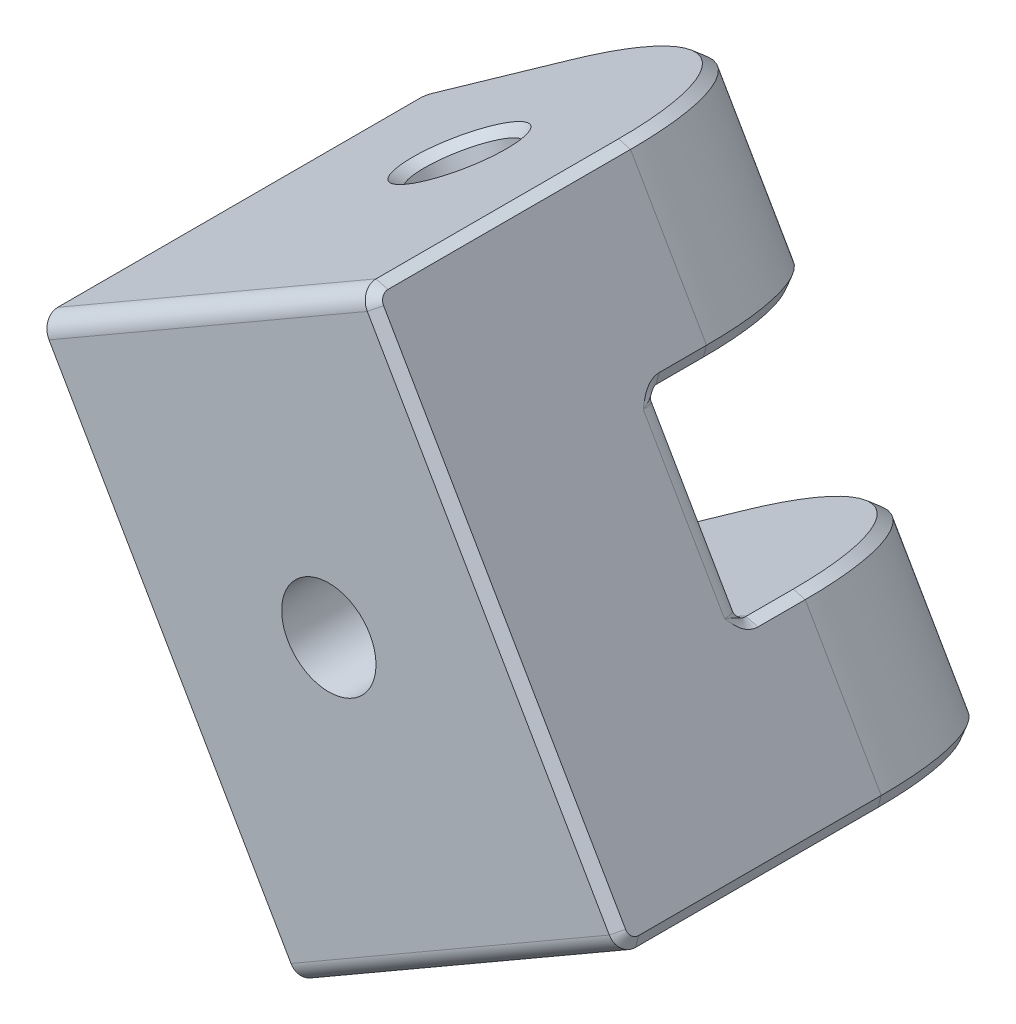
ISO-10303-21;
HEADER;
FILE_DESCRIPTION(('STEP AP214'),'2;1');
FILE_NAME('part.step','',(''),(''),'','','');
FILE_SCHEMA(('AUTOMOTIVE_DESIGN { 1 0 10303 214 1 1 1 1 }'));
ENDSEC;
DATA;
#1=APPLICATION_CONTEXT('core data for automotive mechanical design processes');
#2=APPLICATION_PROTOCOL_DEFINITION('international standard','automotive_design',2000,#1);
#3=PRODUCT_CONTEXT('',#1,'mechanical');
#4=PRODUCT('Part','Part','',(#3));
#5=PRODUCT_RELATED_PRODUCT_CATEGORY('part','',(#4));
#6=PRODUCT_DEFINITION_FORMATION('','',#4);
#7=PRODUCT_DEFINITION_CONTEXT('part definition',#1,'design');
#8=PRODUCT_DEFINITION('design','',#6,#7);
#9=PRODUCT_DEFINITION_SHAPE('','',#8);
#10=(LENGTH_UNIT() NAMED_UNIT(*) SI_UNIT(.MILLI.,.METRE.));
#11=(NAMED_UNIT(*) PLANE_ANGLE_UNIT() SI_UNIT($,.RADIAN.));
#12=(NAMED_UNIT(*) SI_UNIT($,.STERADIAN.) SOLID_ANGLE_UNIT());
#13=UNCERTAINTY_MEASURE_WITH_UNIT(LENGTH_MEASURE(1.E-05),#10,'distance_accuracy_value','');
#14=(GEOMETRIC_REPRESENTATION_CONTEXT(3) GLOBAL_UNCERTAINTY_ASSIGNED_CONTEXT((#13)) GLOBAL_UNIT_ASSIGNED_CONTEXT((#10,
#11,#12)) REPRESENTATION_CONTEXT('',''));
#15=CARTESIAN_POINT('',(0.,0.,0.));
#16=DIRECTION('',(0.,0.,1.));
#17=DIRECTION('',(1.,0.,0.));
#18=AXIS2_PLACEMENT_3D('',#15,#16,#17);
#19=CARTESIAN_POINT('',(15.2804472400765,58.4966230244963,-9.88361764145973));
#20=DIRECTION('',(0.499999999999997,-0.86602540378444,0.));
#21=DIRECTION('',(0.86602540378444,0.499999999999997,0.));
#22=AXIS2_PLACEMENT_3D('',#19,#20,#21);
#23=CYLINDRICAL_SURFACE('',#22,11.0200000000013);
#24=DIRECTION('',(0.499999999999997,-0.86602540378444,0.));
#25=VECTOR('',#24,1.);
#26=CARTESIAN_POINT('',(30.7670290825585,23.5871223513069,-20.135190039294));
#27=LINE('',#26,#25);
#28=CARTESIAN_POINT('',(37.2173029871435,12.4149202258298,-20.135190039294));
#29=VERTEX_POINT('',#28);
#30=CARTESIAN_POINT('',(41.5673029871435,4.88049921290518,-20.135190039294));
#31=VERTEX_POINT('',#30);
#32=EDGE_CURVE('E1567',#29,#31,#27,.T.);
#33=ORIENTED_EDGE('',*,*,#32,.F.);
#34=CARTESIAN_POINT('',(40.7186238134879,14.4364087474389,-9.88361764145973));
#35=DIRECTION('',(0.5,-0.866025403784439,0.));
#36=DIRECTION('',(0.866025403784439,0.5,0.));
#37=AXIS2_PLACEMENT_3D('',#34,#35,#36);
#38=CIRCLE('',#37,11.0200000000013);
#39=CARTESIAN_POINT('',(50.2622237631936,19.9464087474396,-9.88361764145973));
#40=VERTEX_POINT('',#39);
#41=EDGE_CURVE('E1362',#29,#40,#38,.T.);
#42=ORIENTED_EDGE('',*,*,#41,.T.);
#43=DIRECTION('',(0.499999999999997,-0.86602540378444,0.));
#44=VECTOR('',#43,1.);
#45=CARTESIAN_POINT('',(24.8240471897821,64.0066230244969,-9.88361764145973));
#46=LINE('',#45,#44);
#47=CARTESIAN_POINT('',(54.6122237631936,12.4119877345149,-9.88361764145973));
#48=VERTEX_POINT('',#47);
#49=EDGE_CURVE('E440',#40,#48,#46,.T.);
#50=ORIENTED_EDGE('',*,*,#49,.T.);
#51=CARTESIAN_POINT('',(45.0686238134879,6.90198773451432,-9.88361764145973));
#52=DIRECTION('',(-0.49999999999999,0.866025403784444,0.));
#53=DIRECTION('',(-0.866025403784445,-0.49999999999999,0.));
#54=AXIS2_PLACEMENT_3D('',#51,#52,#53);
#55=CIRCLE('',#54,11.0200000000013);
#56=EDGE_CURVE('E1472',#48,#31,#55,.T.);
#57=ORIENTED_EDGE('',*,*,#56,.T.);
#58=EDGE_LOOP('',(#33,#42,#50,#57));
#59=FACE_BOUND('',#58,.T.);
#60=ADVANCED_FACE('F44',(#59),#23,.T.);
#61=CARTESIAN_POINT('',(40.2622237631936,37.2669168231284,-9.88361764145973));
#62=VERTEX_POINT('',#61);
#63=CARTESIAN_POINT('',(44.6122237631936,29.7324958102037,-9.88361764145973));
#64=VERTEX_POINT('',#63);
#65=EDGE_CURVE('E451',#62,#64,#46,.T.);
#66=ORIENTED_EDGE('',*,*,#65,.T.);
#67=CARTESIAN_POINT('',(35.068623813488,24.2224958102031,-9.88361764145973));
#68=DIRECTION('',(0.499999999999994,-0.866025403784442,0.));
#69=DIRECTION('',(0.866025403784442,0.499999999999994,0.));
#70=AXIS2_PLACEMENT_3D('',#67,#68,#69);
#71=CIRCLE('',#70,11.0200000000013);
#72=CARTESIAN_POINT('',(31.5673029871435,22.201007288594,-20.135190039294));
#73=VERTEX_POINT('',#72);
#74=EDGE_CURVE('E1417',#64,#73,#71,.F.);
#75=ORIENTED_EDGE('',*,*,#74,.T.);
#76=DIRECTION('',(-0.499999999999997,0.86602540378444,0.));
#77=VECTOR('',#76,1.);
#78=CARTESIAN_POINT('',(38.0175768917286,11.0288051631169,-20.135190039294));
#79=LINE('',#78,#77);
#80=CARTESIAN_POINT('',(27.2173029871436,29.7354283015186,-20.135190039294));
#81=VERTEX_POINT('',#80);
#82=EDGE_CURVE('E424',#73,#81,#79,.T.);
#83=ORIENTED_EDGE('',*,*,#82,.T.);
#84=CARTESIAN_POINT('',(30.718623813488,31.7569168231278,-9.88361764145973));
#85=DIRECTION('',(0.5,-0.866025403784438,0.));
#86=DIRECTION('',(0.866025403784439,0.5,0.));
#87=AXIS2_PLACEMENT_3D('',#84,#85,#86);
#88=CIRCLE('',#87,11.0200000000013);
#89=EDGE_CURVE('E1361',#81,#62,#88,.T.);
#90=ORIENTED_EDGE('',*,*,#89,.T.);
#91=EDGE_LOOP('',(#66,#75,#83,#90));
#92=FACE_BOUND('',#91,.T.);
#93=ADVANCED_FACE('F660',(#92),#23,.T.);
#94=CARTESIAN_POINT('',(37.8763033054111,19.3194522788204,0.));
#95=DIRECTION('',(0.,0.,1.));
#96=DIRECTION('',(1.,0.,0.));
#97=AXIS2_PLACEMENT_3D('',#94,#95,#96);
#98=CYLINDRICAL_SURFACE('',#97,2.7);
#99=CARTESIAN_POINT('',(37.8763033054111,19.3194522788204,5.));
#100=DIRECTION('',(0.,0.,1.));
#101=DIRECTION('',(1.,0.,0.));
#102=AXIS2_PLACEMENT_3D('',#99,#100,#101);
#103=CIRCLE('',#102,2.7);
#104=CARTESIAN_POINT('',(40.5763033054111,19.3194522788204,5.));
#105=VERTEX_POINT('',#104);
#106=EDGE_CURVE('E455',#105,#105,#103,.T.);
#107=ORIENTED_EDGE('',*,*,#106,.T.);
#108=EDGE_LOOP('',(#107));
#109=FACE_BOUND('',#108,.T.);
#110=CARTESIAN_POINT('',(37.8763033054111,19.3194522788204,1.));
#111=DIRECTION('',(0.,0.,-1.));
#112=DIRECTION('',(-1.,0.,0.));
#113=AXIS2_PLACEMENT_3D('',#110,#111,#112);
#114=CIRCLE('',#113,2.7);
#115=CARTESIAN_POINT('',(35.1763033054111,19.3194522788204,1.));
#116=VERTEX_POINT('',#115);
#117=EDGE_CURVE('E397',#116,#116,#114,.F.);
#118=ORIENTED_EDGE('',*,*,#117,.F.);
#119=EDGE_LOOP('',(#118));
#120=FACE_BOUND('',#119,.T.);
#121=ADVANCED_FACE('F666',(#109,#120),#98,.F.);
#122=CARTESIAN_POINT('',(15.2804472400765,58.4966230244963,-9.88361764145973));
#123=DIRECTION('',(0.499999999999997,-0.86602540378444,0.));
#124=DIRECTION('',(0.86602540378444,0.499999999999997,0.));
#125=AXIS2_PLACEMENT_3D('',#122,#123,#124);
#126=CYLINDRICAL_SURFACE('',#125,2.6);
#127=CARTESIAN_POINT('',(35.068623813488,24.2224958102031,-9.88361764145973));
#128=DIRECTION('',(0.499999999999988,-0.866025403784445,0.));
#129=DIRECTION('',(0.866025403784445,0.499999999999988,0.));
#130=AXIS2_PLACEMENT_3D('',#127,#128,#129);
#131=CIRCLE('',#130,2.6);
#132=CARTESIAN_POINT('',(37.3202898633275,25.5224958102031,-9.88361764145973));
#133=VERTEX_POINT('',#132);
#134=EDGE_CURVE('E533',#133,#133,#131,.T.);
#135=ORIENTED_EDGE('',*,*,#134,.T.);
#136=EDGE_LOOP('',(#135));
#137=FACE_BOUND('',#136,.T.);
#138=CARTESIAN_POINT('',(30.718623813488,31.7569168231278,-9.88361764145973));
#139=DIRECTION('',(0.500000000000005,-0.866025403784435,0.));
#140=DIRECTION('',(0.866025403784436,0.500000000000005,0.));
#141=AXIS2_PLACEMENT_3D('',#138,#139,#140);
#142=CIRCLE('',#141,2.6);
#143=CARTESIAN_POINT('',(28.4669577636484,30.4569168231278,-9.88361764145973));
#144=VERTEX_POINT('',#143);
#145=EDGE_CURVE('E529',#144,#144,#142,.F.);
#146=ORIENTED_EDGE('',*,*,#145,.T.);
#147=EDGE_LOOP('',(#146));
#148=FACE_BOUND('',#147,.T.);
#149=ADVANCED_FACE('F640',(#137,#148),#126,.F.);
#150=CARTESIAN_POINT('',(20.9250238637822,26.6799295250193,5.));
#151=DIRECTION('',(0.499999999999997,-0.86602540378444,0.));
#152=DIRECTION('',(0.86602540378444,0.499999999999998,0.));
#153=AXIS2_PLACEMENT_3D('',#150,#151,#152);
#154=PLANE('',#153);
#155=CARTESIAN_POINT('',(30.468623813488,32.18992952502,-9.88361764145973));
#156=DIRECTION('',(0.499999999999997,-0.86602540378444,0.));
#157=DIRECTION('',(0.86602540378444,0.499999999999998,0.));
#158=AXIS2_PLACEMENT_3D('',#155,#156,#157);
#159=CIRCLE('',#158,3.09999999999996);
#160=CARTESIAN_POINT('',(27.7839450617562,30.63992952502,-9.88361764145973));
#161=VERTEX_POINT('',#160);
#162=EDGE_CURVE('E1365',#161,#161,#159,.T.);
#163=ORIENTED_EDGE('',*,*,#162,.T.);
#164=EDGE_LOOP('',(#163));
#165=FACE_BOUND('',#164,.T.);
#166=DIRECTION('',(-0.86602540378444,-0.499999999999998,0.));
#167=VECTOR('',#166,1.);
#168=CARTESIAN_POINT('',(20.9250238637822,26.6799295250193,4.));
#169=LINE('',#168,#167);
#170=CARTESIAN_POINT('',(21.3580365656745,26.9299295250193,4.));
#171=VERTEX_POINT('',#170);
#172=CARTESIAN_POINT('',(39.5792110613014,37.4499295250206,4.));
#173=VERTEX_POINT('',#172);
#174=EDGE_CURVE('E576',#171,#173,#169,.F.);
#175=ORIENTED_EDGE('',*,*,#174,.T.);
#176=DIRECTION('',(0.,0.,-1.));
#177=VECTOR('',#176,1.);
#178=CARTESIAN_POINT('',(39.5792110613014,37.4499295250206,-9.88361764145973));
#179=LINE('',#178,#177);
#180=CARTESIAN_POINT('',(39.5792110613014,37.4499295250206,-9.88361764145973));
#181=VERTEX_POINT('',#180);
#182=EDGE_CURVE('E972',#173,#181,#179,.T.);
#183=ORIENTED_EDGE('',*,*,#182,.T.);
#184=CARTESIAN_POINT('',(30.468623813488,32.18992952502,-9.88361764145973));
#185=DIRECTION('',(0.499999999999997,-0.86602540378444,0.));
#186=DIRECTION('',(0.86602540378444,0.499999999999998,0.));
#187=AXIS2_PLACEMENT_3D('',#184,#185,#186);
#188=CIRCLE('',#187,10.5200000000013);
#189=CARTESIAN_POINT('',(27.126165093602,30.2601600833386,-19.6700551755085));
#190=VERTEX_POINT('',#189);
#191=EDGE_CURVE('E1496',#181,#190,#188,.F.);
#192=ORIENTED_EDGE('',*,*,#191,.T.);
#193=DIRECTION('',(-0.805637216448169,-0.465134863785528,0.36687631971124));
#194=VECTOR('',#193,1.);
#195=CARTESIAN_POINT('',(21.6321871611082,27.0882104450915,-17.1681717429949));
#196=LINE('',#195,#194);
#197=CARTESIAN_POINT('',(21.6321871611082,27.0882104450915,-17.1681717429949));
#198=VERTEX_POINT('',#197);
#199=EDGE_CURVE('E1493',#190,#198,#196,.T.);
#200=ORIENTED_EDGE('',*,*,#199,.T.);
#201=CARTESIAN_POINT('',(21.7910492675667,27.1799295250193,-16.7030368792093));
#202=DIRECTION('',(0.499999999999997,-0.86602540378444,0.));
#203=DIRECTION('',(0.86602540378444,0.499999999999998,0.));
#204=AXIS2_PLACEMENT_3D('',#201,#202,#203);
#205=CIRCLE('',#204,0.499999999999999);
#206=CARTESIAN_POINT('',(21.3580365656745,26.9299295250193,-16.7030368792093));
#207=VERTEX_POINT('',#206);
#208=EDGE_CURVE('E1372',#198,#207,#205,.F.);
#209=ORIENTED_EDGE('',*,*,#208,.T.);
#210=DIRECTION('',(0.,0.,1.));
#211=VECTOR('',#210,1.);
#212=CARTESIAN_POINT('',(21.3580365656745,26.9299295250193,5.));
#213=LINE('',#212,#211);
#214=EDGE_CURVE('E1370',#207,#171,#213,.T.);
#215=ORIENTED_EDGE('',*,*,#214,.T.);
#216=EDGE_LOOP('',(#175,#183,#192,#200,#209,#215));
#217=FACE_BOUND('',#216,.T.);
#218=ADVANCED_FACE('F684',(#165,#217),#154,.F.);
#219=CARTESIAN_POINT('',(35.7750238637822,0.9589750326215,5.));
#220=DIRECTION('',(0.866025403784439,0.5,0.));
#221=DIRECTION('',(-0.5,0.866025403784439,0.));
#222=AXIS2_PLACEMENT_3D('',#219,#220,#221);
#223=PLANE('',#222);
#224=DIRECTION('',(0.5,-0.866025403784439,0.));
#225=VECTOR('',#224,1.);
#226=CARTESIAN_POINT('',(30.9250238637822,9.35942144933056,-5.76434057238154));
#227=LINE('',#226,#225);
#228=CARTESIAN_POINT('',(26.0250238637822,17.8464704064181,-5.76434057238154));
#229=VERTEX_POINT('',#228);
#230=CARTESIAN_POINT('',(30.6750238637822,9.79243415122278,-5.76434057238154));
#231=VERTEX_POINT('',#230);
#232=EDGE_CURVE('E489',#229,#231,#227,.T.);
#233=ORIENTED_EDGE('',*,*,#232,.T.);
#234=CARTESIAN_POINT('',(31.1750238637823,8.92640874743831,-7.17855413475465));
#235=CARTESIAN_POINT('',(31.1750233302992,8.92640967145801,-7.1404943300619));
#236=CARTESIAN_POINT('',(31.1740606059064,8.92807715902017,-7.1027529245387));
#237=CARTESIAN_POINT('',(31.1703259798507,8.93454572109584,-7.02786878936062));
#238=CARTESIAN_POINT('',(31.167553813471,8.93934725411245,-6.99072614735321));
#239=CARTESIAN_POINT('',(31.1602688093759,8.95196525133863,-6.91701686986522));
#240=CARTESIAN_POINT('',(31.1557549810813,8.95978343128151,-6.88045610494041));
#241=CARTESIAN_POINT('',(31.1450190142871,8.97837867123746,-6.8078777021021));
#242=CARTESIAN_POINT('',(31.1387752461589,8.98919319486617,-6.77182462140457));
#243=CARTESIAN_POINT('',(31.1248848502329,9.01325206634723,-6.70164799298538));
#244=CARTESIAN_POINT('',(31.1171991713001,9.0265640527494,-6.66724435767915));
#245=CARTESIAN_POINT('',(31.1004677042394,9.05554380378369,-6.59988322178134));
#246=CARTESIAN_POINT('',(31.0914160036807,9.0712218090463,-6.56689373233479));
#247=CARTESIAN_POINT('',(31.0720248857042,9.10480821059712,-6.50224003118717));
#248=CARTESIAN_POINT('',(31.0616665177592,9.12274943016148,-6.47052404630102));
#249=CARTESIAN_POINT('',(31.0397879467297,9.16064422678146,-6.40851998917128));
#250=CARTESIAN_POINT('',(31.0283769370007,9.18040867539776,-6.37852715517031));
#251=CARTESIAN_POINT('',(31.0046697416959,9.22147074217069,-6.32020419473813));
#252=CARTESIAN_POINT('',(30.9923816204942,9.24275439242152,-6.29189834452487));
#253=CARTESIAN_POINT('',(30.9670356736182,9.28665486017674,-6.23680228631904));
#254=CARTESIAN_POINT('',(30.9539775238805,9.30927223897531,-6.21001271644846));
#255=CARTESIAN_POINT('',(30.9271870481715,9.35567470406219,-6.15776111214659));
#256=CARTESIAN_POINT('',(30.9134544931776,9.37946018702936,-6.13229952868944));
#257=CARTESIAN_POINT('',(30.8854126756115,9.42803003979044,-6.08251196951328));
#258=CARTESIAN_POINT('',(30.8711017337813,9.45281731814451,-6.0581839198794));
#259=CARTESIAN_POINT('',(30.8420120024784,9.50320221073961,-6.01047059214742));
#260=CARTESIAN_POINT('',(30.8272183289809,9.52882560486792,-5.98706269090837));
#261=CARTESIAN_POINT('',(30.7973197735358,9.58061142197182,-5.94104550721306));
#262=CARTESIAN_POINT('',(30.7822220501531,9.60676144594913,-5.91844485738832));
#263=CARTESIAN_POINT('',(30.7518193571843,9.65942045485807,-5.87378170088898));
#264=CARTESIAN_POINT('',(30.7365128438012,9.68593211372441,-5.85171697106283));
#265=CARTESIAN_POINT('',(30.7058174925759,9.73909802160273,-5.80788938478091));
#266=CARTESIAN_POINT('',(30.6903979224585,9.7658055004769,-5.78608275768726));
#267=CARTESIAN_POINT('',(30.6750238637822,9.79243415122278,-5.76434057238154));
#268=B_SPLINE_CURVE_WITH_KNOTS('',3,(#234,#235,#236,#237,#238,#239,#240,#241,#242,#243,#244,
#245,#246,#247,#248,#249,#250,#251,#252,#253,#254,#255,#256,#257,#258,#259,#260,#261,#262,#263,
#264,#265,#266,#267),.UNSPECIFIED.,.F.,.F.,(4,2,2,2,2,2,2,2,2,2,2,2,2,2,2,2,4),(0.,
0.000112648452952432,0.000225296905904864,0.000337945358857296,0.000450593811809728,
0.000563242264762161,0.000675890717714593,0.000788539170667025,0.000901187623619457,
0.00101383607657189,0.00112648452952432,0.00123913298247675,0.00135178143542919,
0.00146442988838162,0.00157707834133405,0.00168972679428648,0.00180237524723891),.UNSPECIFIED.);
#269=CARTESIAN_POINT('',(31.1750238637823,8.92640874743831,-7.17855413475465));
#270=VERTEX_POINT('',#269);
#271=EDGE_CURVE('E723',#231,#270,#268,.F.);
#272=ORIENTED_EDGE('',*,*,#271,.T.);
#273=DIRECTION('',(0.,0.,-1.));
#274=VECTOR('',#273,1.);
#275=CARTESIAN_POINT('',(31.1750238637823,8.92640874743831,5.));
#276=LINE('',#275,#274);
#277=CARTESIAN_POINT('',(31.1750238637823,8.92640874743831,-16.7030368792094));
#278=VERTEX_POINT('',#277);
#279=EDGE_CURVE('E725',#270,#278,#276,.T.);
#280=ORIENTED_EDGE('',*,*,#279,.T.);
#281=DIRECTION('',(0.5,-0.866025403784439,0.));
#282=VECTOR('',#281,1.);
#283=CARTESIAN_POINT('',(35.7750238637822,0.958975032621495,-16.7030368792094));
#284=LINE('',#283,#282);
#285=CARTESIAN_POINT('',(35.5250238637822,1.39198773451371,-16.7030368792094));
#286=VERTEX_POINT('',#285);
#287=EDGE_CURVE('E584',#278,#286,#284,.T.);
#288=ORIENTED_EDGE('',*,*,#287,.T.);
#289=DIRECTION('',(0.,0.,1.));
#290=VECTOR('',#289,1.);
#291=CARTESIAN_POINT('',(35.5250238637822,1.39198773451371,5.));
#292=LINE('',#291,#290);
#293=CARTESIAN_POINT('',(35.5250238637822,1.39198773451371,4.));
#294=VERTEX_POINT('',#293);
#295=EDGE_CURVE('E1368',#286,#294,#292,.T.);
#296=ORIENTED_EDGE('',*,*,#295,.T.);
#297=CARTESIAN_POINT('',(35.2750238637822,1.82500043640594,4.));
#298=DIRECTION('',(0.866025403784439,0.5,0.));
#299=DIRECTION('',(-0.5,0.866025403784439,0.));
#300=AXIS2_PLACEMENT_3D('',#297,#298,#299);
#301=CIRCLE('',#300,0.50000000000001);
#302=CARTESIAN_POINT('',(35.2750238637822,1.82500043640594,4.50000000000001));
#303=VERTEX_POINT('',#302);
#304=EDGE_CURVE('E1377',#294,#303,#301,.F.);
#305=ORIENTED_EDGE('',*,*,#304,.T.);
#306=DIRECTION('',(-0.5,0.866025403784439,0.));
#307=VECTOR('',#306,1.);
#308=CARTESIAN_POINT('',(35.7750238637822,0.9589750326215,4.50000000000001));
#309=LINE('',#308,#307);
#310=CARTESIAN_POINT('',(21.4250238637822,25.8139041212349,4.50000000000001));
#311=VERTEX_POINT('',#310);
#312=EDGE_CURVE('E1378',#303,#311,#309,.T.);
#313=ORIENTED_EDGE('',*,*,#312,.T.);
#314=CARTESIAN_POINT('',(21.4250238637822,25.8139041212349,4.));
#315=DIRECTION('',(0.866025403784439,0.5,0.));
#316=DIRECTION('',(-0.5,0.866025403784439,0.));
#317=AXIS2_PLACEMENT_3D('',#314,#315,#316);
#318=CIRCLE('',#317,0.5);
#319=CARTESIAN_POINT('',(21.1750238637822,26.2469168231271,4.));
#320=VERTEX_POINT('',#319);
#321=EDGE_CURVE('E1376',#311,#320,#318,.F.);
#322=ORIENTED_EDGE('',*,*,#321,.T.);
#323=DIRECTION('',(0.,0.,-1.));
#324=VECTOR('',#323,1.);
#325=CARTESIAN_POINT('',(21.1750238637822,26.2469168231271,5.));
#326=LINE('',#325,#324);
#327=CARTESIAN_POINT('',(21.1750238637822,26.2469168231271,-16.7030368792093));
#328=VERTEX_POINT('',#327);
#329=EDGE_CURVE('E708',#320,#328,#326,.T.);
#330=ORIENTED_EDGE('',*,*,#329,.T.);
#331=DIRECTION('',(-0.5,0.866025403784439,0.));
#332=VECTOR('',#331,1.);
#333=CARTESIAN_POINT('',(25.7750238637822,18.2794831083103,-16.7030368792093));
#334=LINE('',#333,#332);
#335=CARTESIAN_POINT('',(25.5250238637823,18.7124958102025,-16.7030368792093));
#336=VERTEX_POINT('',#335);
#337=EDGE_CURVE('E588',#328,#336,#334,.F.);
#338=ORIENTED_EDGE('',*,*,#337,.T.);
#339=DIRECTION('',(0.,0.,1.));
#340=VECTOR('',#339,1.);
#341=CARTESIAN_POINT('',(25.5250238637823,18.7124958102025,-6.88237456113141));
#342=LINE('',#341,#340);
#343=CARTESIAN_POINT('',(25.5250238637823,18.7124958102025,-7.17855413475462));
#344=VERTEX_POINT('',#343);
#345=EDGE_CURVE('E699',#336,#344,#342,.T.);
#346=ORIENTED_EDGE('',*,*,#345,.T.);
#347=CARTESIAN_POINT('',(26.0250238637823,17.8464704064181,-5.76434057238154));
#348=CARTESIAN_POINT('',(26.0096498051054,17.8730990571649,-5.78608275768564));
#349=CARTESIAN_POINT('',(25.9942302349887,17.899806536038,-5.80788938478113));
#350=CARTESIAN_POINT('',(25.9635348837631,17.9529724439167,-5.85171697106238));
#351=CARTESIAN_POINT('',(25.9482283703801,17.9794841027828,-5.87378170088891));
#352=CARTESIAN_POINT('',(25.9178256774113,18.0321431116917,-5.91844485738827));
#353=CARTESIAN_POINT('',(25.9027279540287,18.0582931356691,-5.94104550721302));
#354=CARTESIAN_POINT('',(25.8728293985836,18.1100789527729,-5.98706269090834));
#355=CARTESIAN_POINT('',(25.858035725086,18.1357023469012,-6.01047059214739));
#356=CARTESIAN_POINT('',(25.8289459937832,18.1860872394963,-6.05818391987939));
#357=CARTESIAN_POINT('',(25.814635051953,18.2108745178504,-6.08251196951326));
#358=CARTESIAN_POINT('',(25.7865932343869,18.2594443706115,-6.13229952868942));
#359=CARTESIAN_POINT('',(25.772860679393,18.2832298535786,-6.15776111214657));
#360=CARTESIAN_POINT('',(25.746070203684,18.3296323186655,-6.21001271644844));
#361=CARTESIAN_POINT('',(25.7330120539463,18.3522496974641,-6.23680228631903));
#362=CARTESIAN_POINT('',(25.7076661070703,18.3961501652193,-6.29189834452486));
#363=CARTESIAN_POINT('',(25.6953779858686,18.4174338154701,-6.32020419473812));
#364=CARTESIAN_POINT('',(25.6716707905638,18.4584958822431,-6.3785271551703));
#365=CARTESIAN_POINT('',(25.6602597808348,18.4782603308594,-6.40851998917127));
#366=CARTESIAN_POINT('',(25.6383812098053,18.5161551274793,-6.47052404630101));
#367=CARTESIAN_POINT('',(25.6280228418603,18.5340963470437,-6.50224003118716));
#368=CARTESIAN_POINT('',(25.6086317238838,18.5676827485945,-6.56689373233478));
#369=CARTESIAN_POINT('',(25.5995800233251,18.5833607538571,-6.59988322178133));
#370=CARTESIAN_POINT('',(25.5828485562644,18.6123405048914,-6.66724435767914));
#371=CARTESIAN_POINT('',(25.5751628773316,18.6256524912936,-6.70164799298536));
#372=CARTESIAN_POINT('',(25.5612724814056,18.6497113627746,-6.77182462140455));
#373=CARTESIAN_POINT('',(25.5550287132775,18.6605258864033,-6.80787770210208));
#374=CARTESIAN_POINT('',(25.5442927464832,18.6791211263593,-6.88045610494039));
#375=CARTESIAN_POINT('',(25.5397789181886,18.6869393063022,-6.9170168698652));
#376=CARTESIAN_POINT('',(25.5324939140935,18.6995573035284,-6.99072614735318));
#377=CARTESIAN_POINT('',(25.5297217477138,18.704358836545,-7.02786878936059));
#378=CARTESIAN_POINT('',(25.5259871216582,18.7108273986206,-7.10275292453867));
#379=CARTESIAN_POINT('',(25.5250243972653,18.7124948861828,-7.14049433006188));
#380=CARTESIAN_POINT('',(25.5250238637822,18.7124958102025,-7.17855413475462));
#381=B_SPLINE_CURVE_WITH_KNOTS('',3,(#347,#348,#349,#350,#351,#352,#353,#354,#355,#356,#357,
#358,#359,#360,#361,#362,#363,#364,#365,#366,#367,#368,#369,#370,#371,#372,#373,#374,#375,#376,
#377,#378,#379,#380),.UNSPECIFIED.,.F.,.F.,(4,2,2,2,2,2,2,2,2,2,2,2,2,2,2,2,4),(0.,
0.000112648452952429,0.000225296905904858,0.000337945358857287,0.000450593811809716,
0.000563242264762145,0.000675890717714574,0.000788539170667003,0.000901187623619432,
0.00101383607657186,0.00112648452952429,0.00123913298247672,0.00135178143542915,
0.00146442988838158,0.00157707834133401,0.00168972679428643,0.00180237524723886),.UNSPECIFIED.);
#382=EDGE_CURVE('E707',#344,#229,#381,.F.);
#383=ORIENTED_EDGE('',*,*,#382,.T.);
#384=EDGE_LOOP('',(#233,#272,#280,#288,#296,#305,#313,#322,#330,#338,#346,#383));
#385=FACE_BOUND('',#384,.T.);
#386=ADVANCED_FACE('F680',(#385),#223,.F.);
#387=CARTESIAN_POINT('',(61.4959783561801,15.8089750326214,5.));
#388=DIRECTION('',(-0.499999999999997,0.86602540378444,0.));
#389=DIRECTION('',(-0.86602540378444,-0.499999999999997,0.));
#390=AXIS2_PLACEMENT_3D('',#387,#388,#389);
#391=PLANE('',#390);
#392=CARTESIAN_POINT('',(45.3186238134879,6.46897503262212,-9.88361764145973));
#393=DIRECTION('',(-0.499999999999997,0.86602540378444,0.));
#394=DIRECTION('',(-0.86602540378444,-0.499999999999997,0.));
#395=AXIS2_PLACEMENT_3D('',#392,#393,#394);
#396=CIRCLE('',#395,3.09999999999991);
#397=CARTESIAN_POINT('',(48.0033025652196,8.01897503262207,-9.88361764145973));
#398=VERTEX_POINT('',#397);
#399=EDGE_CURVE('E509',#398,#398,#396,.T.);
#400=ORIENTED_EDGE('',*,*,#399,.T.);
#401=EDGE_LOOP('',(#400));
#402=FACE_BOUND('',#401,.T.);
#403=CARTESIAN_POINT('',(45.3186238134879,6.46897503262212,-9.88361764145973));
#404=DIRECTION('',(-0.499999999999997,0.86602540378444,0.));
#405=DIRECTION('',(-0.86602540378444,-0.499999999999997,0.));
#406=AXIS2_PLACEMENT_3D('',#403,#404,#405);
#407=CIRCLE('',#406,10.5200000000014);
#408=CARTESIAN_POINT('',(41.9761650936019,4.53920559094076,-19.6700551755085));
#409=VERTEX_POINT('',#408);
#410=CARTESIAN_POINT('',(54.4292110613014,11.7289750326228,-9.88361764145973));
#411=VERTEX_POINT('',#410);
#412=EDGE_CURVE('E613',#409,#411,#407,.F.);
#413=ORIENTED_EDGE('',*,*,#412,.T.);
#414=DIRECTION('',(0.,0.,1.));
#415=VECTOR('',#414,1.);
#416=CARTESIAN_POINT('',(54.4292110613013,11.7289750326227,4.));
#417=LINE('',#416,#415);
#418=CARTESIAN_POINT('',(54.4292110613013,11.7289750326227,4.));
#419=VERTEX_POINT('',#418);
#420=EDGE_CURVE('E616',#411,#419,#417,.T.);
#421=ORIENTED_EDGE('',*,*,#420,.T.);
#422=DIRECTION('',(0.86602540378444,0.499999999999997,0.));
#423=VECTOR('',#422,1.);
#424=CARTESIAN_POINT('',(61.4959783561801,15.8089750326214,4.));
#425=LINE('',#424,#423);
#426=CARTESIAN_POINT('',(36.2080365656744,1.20897503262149,4.));
#427=VERTEX_POINT('',#426);
#428=EDGE_CURVE('E572',#419,#427,#425,.F.);
#429=ORIENTED_EDGE('',*,*,#428,.T.);
#430=DIRECTION('',(0.,0.,-1.));
#431=VECTOR('',#430,1.);
#432=CARTESIAN_POINT('',(36.2080365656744,1.2089750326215,5.));
#433=LINE('',#432,#431);
#434=CARTESIAN_POINT('',(36.2080365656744,1.2089750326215,-16.7030368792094));
#435=VERTEX_POINT('',#434);
#436=EDGE_CURVE('E604',#427,#435,#433,.T.);
#437=ORIENTED_EDGE('',*,*,#436,.T.);
#438=CARTESIAN_POINT('',(36.6410492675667,1.45897503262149,-16.7030368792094));
#439=DIRECTION('',(-0.499999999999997,0.86602540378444,0.));
#440=DIRECTION('',(-0.86602540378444,-0.499999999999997,0.));
#441=AXIS2_PLACEMENT_3D('',#438,#439,#440);
#442=CIRCLE('',#441,0.500000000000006);
#443=CARTESIAN_POINT('',(36.4821871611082,1.36725595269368,-17.1681717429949));
#444=VERTEX_POINT('',#443);
#445=EDGE_CURVE('E607',#435,#444,#442,.F.);
#446=ORIENTED_EDGE('',*,*,#445,.T.);
#447=DIRECTION('',(0.805637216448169,0.465134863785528,-0.36687631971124));
#448=VECTOR('',#447,1.);
#449=CARTESIAN_POINT('',(41.9761650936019,4.53920559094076,-19.6700551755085));
#450=LINE('',#449,#448);
#451=EDGE_CURVE('E610',#444,#409,#450,.T.);
#452=ORIENTED_EDGE('',*,*,#451,.T.);
#453=EDGE_LOOP('',(#413,#421,#429,#437,#446,#452));
#454=FACE_BOUND('',#453,.T.);
#455=ADVANCED_FACE('F623',(#402,#454),#391,.F.);
#456=CARTESIAN_POINT('',(0.,0.,5.));
#457=DIRECTION('',(0.,0.,-1.));
#458=DIRECTION('',(-1.,0.,0.));
#459=AXIS2_PLACEMENT_3D('',#456,#457,#458);
#460=PLANE('',#459);
#461=ORIENTED_EDGE('',*,*,#106,.F.);
#462=EDGE_LOOP('',(#461));
#463=FACE_BOUND('',#462,.T.);
#464=DIRECTION('',(0.86602540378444,0.499999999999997,0.));
#465=VECTOR('',#464,1.);
#466=CARTESIAN_POINT('',(8.02850759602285,-13.9057830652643,5.));
#467=LINE('',#466,#465);
#468=CARTESIAN_POINT('',(35.7080365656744,2.07500043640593,5.));
#469=VERTEX_POINT('',#468);
#470=CARTESIAN_POINT('',(53.9292110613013,12.5950004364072,5.));
#471=VERTEX_POINT('',#470);
#472=EDGE_CURVE('E569',#469,#471,#467,.T.);
#473=ORIENTED_EDGE('',*,*,#472,.T.);
#474=DIRECTION('',(-0.499999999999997,0.86602540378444,0.));
#475=VECTOR('',#474,1.);
#476=CARTESIAN_POINT('',(40.0792110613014,36.5839041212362,5.));
#477=LINE('',#476,#475);
#478=CARTESIAN_POINT('',(40.0792110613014,36.5839041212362,5.));
#479=VERTEX_POINT('',#478);
#480=EDGE_CURVE('E1092',#471,#479,#477,.T.);
#481=ORIENTED_EDGE('',*,*,#480,.T.);
#482=DIRECTION('',(-0.86602540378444,-0.499999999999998,0.));
#483=VECTOR('',#482,1.);
#484=CARTESIAN_POINT('',(-5.82149240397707,10.0831206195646,5.));
#485=LINE('',#484,#483);
#486=CARTESIAN_POINT('',(21.8580365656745,26.0639041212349,5.));
#487=VERTEX_POINT('',#486);
#488=EDGE_CURVE('E555',#479,#487,#485,.T.);
#489=ORIENTED_EDGE('',*,*,#488,.T.);
#490=DIRECTION('',(0.5,-0.866025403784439,0.));
#491=VECTOR('',#490,1.);
#492=CARTESIAN_POINT('',(27.6795289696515,15.9807835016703,5.));
#493=LINE('',#492,#491);
#494=EDGE_CURVE('E74',#487,#469,#493,.T.);
#495=ORIENTED_EDGE('',*,*,#494,.T.);
#496=EDGE_LOOP('',(#473,#481,#489,#495));
#497=FACE_BOUND('',#496,.T.);
#498=ADVANCED_FACE('F638',(#463,#497),#460,.F.);
#499=CARTESIAN_POINT('',(45.0686238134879,6.90198773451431,-9.88361764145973));
#500=DIRECTION('',(-0.499999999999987,0.866025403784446,0.));
#501=DIRECTION('',(-0.866025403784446,-0.499999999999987,0.));
#502=AXIS2_PLACEMENT_3D('',#499,#500,#501);
#503=CIRCLE('',#502,2.6);
#504=CARTESIAN_POINT('',(47.3202898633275,8.20198773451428,-9.88361764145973));
#505=VERTEX_POINT('',#504);
#506=EDGE_CURVE('E600',#505,#505,#503,.F.);
#507=CARTESIAN_POINT('',(40.7186238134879,14.436408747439,-9.88361764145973));
#508=DIRECTION('',(0.499999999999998,-0.866025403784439,0.));
#509=DIRECTION('',(0.86602540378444,0.499999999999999,0.));
#510=AXIS2_PLACEMENT_3D('',#507,#508,#509);
#511=CIRCLE('',#510,2.6);
#512=CARTESIAN_POINT('',(42.9702898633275,15.736408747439,-9.88361764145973));
#513=VERTEX_POINT('',#512);
#514=EDGE_CURVE('E596',#513,#513,#511,.F.);
#515=CARTESIAN_POINT('',(47.3202898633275,8.20198773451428,-9.88361764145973));
#516=CARTESIAN_POINT('',(47.2749773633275,8.28047128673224,-9.88361764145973));
#517=CARTESIAN_POINT('',(47.2296648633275,8.35895483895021,-9.88361764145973));
#518=CARTESIAN_POINT('',(47.1390398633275,8.51592194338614,-9.88361764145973));
#519=CARTESIAN_POINT('',(47.0937273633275,8.5944054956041,-9.88361764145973));
#520=CARTESIAN_POINT('',(47.0031023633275,8.75137260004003,-9.88361764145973));
#521=CARTESIAN_POINT('',(46.9577898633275,8.829856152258,-9.88361764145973));
#522=CARTESIAN_POINT('',(46.8671648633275,8.98682325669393,-9.88361764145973));
#523=CARTESIAN_POINT('',(46.8218523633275,9.06530680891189,-9.88361764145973));
#524=CARTESIAN_POINT('',(46.7312273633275,9.22227391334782,-9.88361764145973));
#525=CARTESIAN_POINT('',(46.6859148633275,9.30075746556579,-9.88361764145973));
#526=CARTESIAN_POINT('',(46.5952898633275,9.45772457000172,-9.88361764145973));
#527=CARTESIAN_POINT('',(46.5499773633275,9.53620812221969,-9.88361764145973));
#528=CARTESIAN_POINT('',(46.4593523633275,9.69317522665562,-9.88361764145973));
#529=CARTESIAN_POINT('',(46.4140398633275,9.77165877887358,-9.88361764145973));
#530=CARTESIAN_POINT('',(46.3234148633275,9.92862588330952,-9.88361764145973));
#531=CARTESIAN_POINT('',(46.2781023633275,10.0071094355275,-9.88361764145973));
#532=CARTESIAN_POINT('',(46.1874773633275,10.1640765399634,-9.88361764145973));
#533=CARTESIAN_POINT('',(46.1421648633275,10.2425600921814,-9.88361764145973));
#534=CARTESIAN_POINT('',(46.0515398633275,10.3995271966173,-9.88361764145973));
#535=CARTESIAN_POINT('',(46.0062273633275,10.4780107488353,-9.88361764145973));
#536=CARTESIAN_POINT('',(45.9156023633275,10.6349778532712,-9.88361764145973));
#537=CARTESIAN_POINT('',(45.8702898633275,10.7134614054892,-9.88361764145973));
#538=CARTESIAN_POINT('',(45.7796648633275,10.8704285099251,-9.88361764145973));
#539=CARTESIAN_POINT('',(45.7343523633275,10.9489120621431,-9.88361764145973));
#540=CARTESIAN_POINT('',(45.6437273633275,11.105879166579,-9.88361764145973));
#541=CARTESIAN_POINT('',(45.5984148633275,11.184362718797,-9.88361764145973));
#542=CARTESIAN_POINT('',(45.5077898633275,11.3413298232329,-9.88361764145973));
#543=CARTESIAN_POINT('',(45.4624773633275,11.4198133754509,-9.88361764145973));
#544=CARTESIAN_POINT('',(45.3718523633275,11.5767804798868,-9.88361764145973));
#545=CARTESIAN_POINT('',(45.3265398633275,11.6552640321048,-9.88361764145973));
#546=CARTESIAN_POINT('',(45.2359148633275,11.8122311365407,-9.88361764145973));
#547=CARTESIAN_POINT('',(45.1906023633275,11.8907146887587,-9.88361764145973));
#548=CARTESIAN_POINT('',(45.0999773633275,12.0476817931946,-9.88361764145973));
#549=CARTESIAN_POINT('',(45.0546648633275,12.1261653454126,-9.88361764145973));
#550=CARTESIAN_POINT('',(44.9640398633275,12.2831324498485,-9.88361764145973));
#551=CARTESIAN_POINT('',(44.9187273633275,12.3616160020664,-9.88361764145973));
#552=CARTESIAN_POINT('',(44.8281023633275,12.5185831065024,-9.88361764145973));
#553=CARTESIAN_POINT('',(44.7827898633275,12.5970666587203,-9.88361764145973));
#554=CARTESIAN_POINT('',(44.6921648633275,12.7540337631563,-9.88361764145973));
#555=CARTESIAN_POINT('',(44.6468523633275,12.8325173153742,-9.88361764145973));
#556=CARTESIAN_POINT('',(44.5562273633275,12.9894844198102,-9.88361764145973));
#557=CARTESIAN_POINT('',(44.5109148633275,13.0679679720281,-9.88361764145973));
#558=CARTESIAN_POINT('',(44.4202898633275,13.2249350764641,-9.88361764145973));
#559=CARTESIAN_POINT('',(44.3749773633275,13.303418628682,-9.88361764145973));
#560=CARTESIAN_POINT('',(44.2843523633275,13.460385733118,-9.88361764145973));
#561=CARTESIAN_POINT('',(44.2390398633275,13.5388692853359,-9.88361764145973));
#562=CARTESIAN_POINT('',(44.1484148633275,13.6958363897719,-9.88361764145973));
#563=CARTESIAN_POINT('',(44.1031023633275,13.7743199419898,-9.88361764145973));
#564=CARTESIAN_POINT('',(44.0124773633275,13.9312870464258,-9.88361764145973));
#565=CARTESIAN_POINT('',(43.9671648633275,14.0097705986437,-9.88361764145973));
#566=CARTESIAN_POINT('',(43.8765398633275,14.1667377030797,-9.88361764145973));
#567=CARTESIAN_POINT('',(43.8312273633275,14.2452212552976,-9.88361764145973));
#568=CARTESIAN_POINT('',(43.7406023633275,14.4021883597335,-9.88361764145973));
#569=CARTESIAN_POINT('',(43.6952898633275,14.4806719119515,-9.88361764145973));
#570=CARTESIAN_POINT('',(43.6046648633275,14.6376390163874,-9.88361764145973));
#571=CARTESIAN_POINT('',(43.5593523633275,14.7161225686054,-9.88361764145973));
#572=CARTESIAN_POINT('',(43.4687273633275,14.8730896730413,-9.88361764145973));
#573=CARTESIAN_POINT('',(43.4234148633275,14.9515732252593,-9.88361764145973));
#574=CARTESIAN_POINT('',(43.3327898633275,15.1085403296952,-9.88361764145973));
#575=CARTESIAN_POINT('',(43.2874773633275,15.1870238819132,-9.88361764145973));
#576=CARTESIAN_POINT('',(43.1968523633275,15.3439909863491,-9.88361764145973));
#577=CARTESIAN_POINT('',(43.1515398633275,15.4224745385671,-9.88361764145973));
#578=CARTESIAN_POINT('',(43.0609148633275,15.579441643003,-9.88361764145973));
#579=CARTESIAN_POINT('',(43.0156023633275,15.657925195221,-9.88361764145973));
#580=CARTESIAN_POINT('',(42.9702898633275,15.736408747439,-9.88361764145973));
#581=B_SPLINE_CURVE_WITH_KNOTS('',3,(#515,#516,#517,#518,#519,#520,#521,#522,#523,#524,#525,
#526,#527,#528,#529,#530,#531,#532,#533,#534,#535,#536,#537,#538,#539,#540,#541,#542,#543,#544,
#545,#546,#547,#548,#549,#550,#551,#552,#553,#554,#555,#556,#557,#558,#559,#560,#561,#562,#563,
#564,#565,#566,#567,#568,#569,#570,#571,#572,#573,#574,#575,#576,#577,#578,#579,#580),
.UNSPECIFIED.,.F.,.F.,(4,2,2,2,2,2,2,2,2,2,2,2,2,2,2,2,2,2,2,2,2,2,2,2,2,2,2,2,2,2,2,2,4),(0.,
0.271875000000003,0.543749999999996,0.815625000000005,1.0875,1.35937500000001,1.63125000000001,
1.90312500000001,2.17500000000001,2.44687500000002,2.71875000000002,2.99062500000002,
3.26250000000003,3.53437500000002,3.80625000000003,4.07812500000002,4.35000000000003,
4.62187500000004,4.89375000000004,5.16562500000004,5.43750000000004,5.70937500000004,
5.98125000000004,6.25312500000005,6.52500000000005,6.79687500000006,7.06875000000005,
7.34062500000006,7.61250000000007,7.88437500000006,8.15625000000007,8.42812500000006,
8.70000000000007),.UNSPECIFIED.);
#582=EDGE_CURVE('BSEAM634',#505,#513,#581,.T.);
#583=ORIENTED_EDGE('',*,*,#506,.T.);
#584=ORIENTED_EDGE('',*,*,#514,.T.);
#585=ORIENTED_EDGE('',*,*,#582,.T.);
#586=ORIENTED_EDGE('',*,*,#582,.F.);
#587=EDGE_LOOP('',(#583,#585,#584,#586));
#588=FACE_BOUND('',#587,.T.);
#589=ADVANCED_FACE('F634',(#588),#126,.F.);
#590=CARTESIAN_POINT('',(24.8240471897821,64.0066230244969,-9.88361764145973));
#591=DIRECTION('',(0.86602540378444,0.499999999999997,0.));
#592=DIRECTION('',(-0.499999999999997,0.86602540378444,0.));
#593=AXIS2_PLACEMENT_3D('',#590,#591,#592);
#594=PLANE('',#593);
#595=DIRECTION('',(0.,0.,1.));
#596=VECTOR('',#595,1.);
#597=CARTESIAN_POINT('',(50.2622237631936,19.9464087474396,-6.88237456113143));
#598=LINE('',#597,#596);
#599=CARTESIAN_POINT('',(50.2622237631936,19.9464087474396,-7.17855413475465));
#600=VERTEX_POINT('',#599);
#601=EDGE_CURVE('E1031',#40,#600,#598,.T.);
#602=ORIENTED_EDGE('',*,*,#601,.T.);
#603=CARTESIAN_POINT('',(49.7622237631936,20.812434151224,-5.76434057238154));
#604=CARTESIAN_POINT('',(49.7775978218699,20.7858055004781,-5.78608275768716));
#605=CARTESIAN_POINT('',(49.7930173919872,20.759098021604,-5.80788938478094));
#606=CARTESIAN_POINT('',(49.8237127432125,20.7059321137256,-5.85171697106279));
#607=CARTESIAN_POINT('',(49.8390192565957,20.6794204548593,-5.87378170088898));
#608=CARTESIAN_POINT('',(49.8694219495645,20.6267614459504,-5.91844485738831));
#609=CARTESIAN_POINT('',(49.8845196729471,20.6006114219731,-5.94104550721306));
#610=CARTESIAN_POINT('',(49.9144182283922,20.5488256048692,-5.98706269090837));
#611=CARTESIAN_POINT('',(49.9292119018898,20.5232022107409,-6.01047059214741));
#612=CARTESIAN_POINT('',(49.9583016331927,20.4728173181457,-6.0581839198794));
#613=CARTESIAN_POINT('',(49.9726125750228,20.4480300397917,-6.08251196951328));
#614=CARTESIAN_POINT('',(50.000654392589,20.3994601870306,-6.13229952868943));
#615=CARTESIAN_POINT('',(50.0143869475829,20.3756747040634,-6.15776111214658));
#616=CARTESIAN_POINT('',(50.0411774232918,20.3292722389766,-6.21001271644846));
#617=CARTESIAN_POINT('',(50.0542355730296,20.306654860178,-6.23680228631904));
#618=CARTESIAN_POINT('',(50.0795815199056,20.2627543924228,-6.29189834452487));
#619=CARTESIAN_POINT('',(50.0918696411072,20.241470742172,-6.32020419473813));
#620=CARTESIAN_POINT('',(50.1155768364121,20.200408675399,-6.37852715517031));
#621=CARTESIAN_POINT('',(50.1269878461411,20.1806442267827,-6.40851998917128));
#622=CARTESIAN_POINT('',(50.1488664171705,20.1427494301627,-6.47052404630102));
#623=CARTESIAN_POINT('',(50.1592247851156,20.1248082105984,-6.50224003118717));
#624=CARTESIAN_POINT('',(50.1786159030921,20.0912218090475,-6.56689373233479));
#625=CARTESIAN_POINT('',(50.1876676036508,20.0755438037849,-6.59988322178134));
#626=CARTESIAN_POINT('',(50.2043990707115,20.0465640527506,-6.66724435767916));
#627=CARTESIAN_POINT('',(50.2120847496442,20.0332520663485,-6.70164799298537));
#628=CARTESIAN_POINT('',(50.2259751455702,20.0091931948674,-6.77182462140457));
#629=CARTESIAN_POINT('',(50.2322189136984,19.9983786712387,-6.8078777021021));
#630=CARTESIAN_POINT('',(50.2429548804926,19.9797834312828,-6.88045610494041));
#631=CARTESIAN_POINT('',(50.2474687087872,19.9719652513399,-6.91701686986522));
#632=CARTESIAN_POINT('',(50.2547537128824,19.9593472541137,-6.99072614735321));
#633=CARTESIAN_POINT('',(50.257525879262,19.9545457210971,-7.02786878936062));
#634=CARTESIAN_POINT('',(50.2612605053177,19.9480771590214,-7.1027529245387));
#635=CARTESIAN_POINT('',(50.2622232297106,19.9464096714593,-7.1404943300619));
#636=CARTESIAN_POINT('',(50.2622237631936,19.9464087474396,-7.17855413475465));
#637=B_SPLINE_CURVE_WITH_KNOTS('',3,(#603,#604,#605,#606,#607,#608,#609,#610,#611,#612,#613,
#614,#615,#616,#617,#618,#619,#620,#621,#622,#623,#624,#625,#626,#627,#628,#629,#630,#631,#632,
#633,#634,#635,#636),.UNSPECIFIED.,.F.,.F.,(4,2,2,2,2,2,2,2,2,2,2,2,2,2,2,2,4),(0.,
0.000112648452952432,0.000225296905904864,0.000337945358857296,0.000450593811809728,
0.00056324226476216,0.000675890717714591,0.000788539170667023,0.000901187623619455,
0.00101383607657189,0.00112648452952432,0.00123913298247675,0.00135178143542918,
0.00146442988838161,0.00157707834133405,0.00168972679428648,0.00180237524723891),.UNSPECIFIED.);
#638=CARTESIAN_POINT('',(49.7622237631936,20.812434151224,-5.76434057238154));
#639=VERTEX_POINT('',#638);
#640=EDGE_CURVE('E1026',#600,#639,#637,.F.);
#641=ORIENTED_EDGE('',*,*,#640,.T.);
#642=DIRECTION('',(-0.499999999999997,0.86602540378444,0.));
#643=VECTOR('',#642,1.);
#644=CARTESIAN_POINT('',(24.8240471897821,64.0066230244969,-5.76434057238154));
#645=LINE('',#644,#643);
#646=CARTESIAN_POINT('',(45.1122237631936,28.8664704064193,-5.76434057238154));
#647=VERTEX_POINT('',#646);
#648=EDGE_CURVE('E477',#639,#647,#645,.T.);
#649=ORIENTED_EDGE('',*,*,#648,.T.);
#650=CARTESIAN_POINT('',(44.6122237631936,29.7324958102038,-7.17855413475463));
#651=CARTESIAN_POINT('',(44.6122242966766,29.732494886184,-7.14049433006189));
#652=CARTESIAN_POINT('',(44.6131870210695,29.7308273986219,-7.10275292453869));
#653=CARTESIAN_POINT('',(44.6169216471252,29.7243588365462,-7.02786878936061));
#654=CARTESIAN_POINT('',(44.6196938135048,29.7195573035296,-6.99072614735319));
#655=CARTESIAN_POINT('',(44.6269788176,29.7069393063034,-6.91701686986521));
#656=CARTESIAN_POINT('',(44.6314926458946,29.6991211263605,-6.8804561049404));
#657=CARTESIAN_POINT('',(44.6422286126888,29.6805258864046,-6.80787770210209));
#658=CARTESIAN_POINT('',(44.648472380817,29.6697113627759,-6.77182462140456));
#659=CARTESIAN_POINT('',(44.662362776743,29.6456524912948,-6.70164799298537));
#660=CARTESIAN_POINT('',(44.6700484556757,29.6323405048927,-6.66724435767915));
#661=CARTESIAN_POINT('',(44.6867799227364,29.6033607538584,-6.59988322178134));
#662=CARTESIAN_POINT('',(44.6958316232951,29.5876827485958,-6.56689373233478));
#663=CARTESIAN_POINT('',(44.7152227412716,29.554096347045,-6.50224003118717));
#664=CARTESIAN_POINT('',(44.7255811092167,29.5361551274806,-6.47052404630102));
#665=CARTESIAN_POINT('',(44.7474596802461,29.4982603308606,-6.40851998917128));
#666=CARTESIAN_POINT('',(44.7588706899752,29.4784958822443,-6.37852715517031));
#667=CARTESIAN_POINT('',(44.78257788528,29.4374338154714,-6.32020419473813));
#668=CARTESIAN_POINT('',(44.7948660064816,29.4161501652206,-6.29189834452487));
#669=CARTESIAN_POINT('',(44.8202119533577,29.3722496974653,-6.23680228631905));
#670=CARTESIAN_POINT('',(44.8332701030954,29.3496323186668,-6.21001271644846));
#671=CARTESIAN_POINT('',(44.8600605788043,29.3032298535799,-6.15776111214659));
#672=CARTESIAN_POINT('',(44.8737931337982,29.2794443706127,-6.13229952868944));
#673=CARTESIAN_POINT('',(44.9018349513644,29.2308745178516,-6.08251196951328));
#674=CARTESIAN_POINT('',(44.9161458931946,29.2060872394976,-6.05818391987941));
#675=CARTESIAN_POINT('',(44.9452356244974,29.1557023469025,-6.01047059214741));
#676=CARTESIAN_POINT('',(44.960029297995,29.1300789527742,-5.98706269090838));
#677=CARTESIAN_POINT('',(44.9899278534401,29.0782931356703,-5.94104550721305));
#678=CARTESIAN_POINT('',(45.0050255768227,29.052143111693,-5.91844485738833));
#679=CARTESIAN_POINT('',(45.0354282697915,28.999484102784,-5.87378170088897));
#680=CARTESIAN_POINT('',(45.0507347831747,28.9729724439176,-5.85171697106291));
#681=CARTESIAN_POINT('',(45.0814301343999,28.9198065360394,-5.80788938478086));
#682=CARTESIAN_POINT('',(45.0968497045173,28.8930990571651,-5.78608275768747));
#683=CARTESIAN_POINT('',(45.1122237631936,28.8664704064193,-5.76434057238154));
#684=B_SPLINE_CURVE_WITH_KNOTS('',3,(#650,#651,#652,#653,#654,#655,#656,#657,#658,#659,#660,
#661,#662,#663,#664,#665,#666,#667,#668,#669,#670,#671,#672,#673,#674,#675,#676,#677,#678,#679,
#680,#681,#682,#683),.UNSPECIFIED.,.F.,.F.,(4,2,2,2,2,2,2,2,2,2,2,2,2,2,2,2,4),(0.,
0.000112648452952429,0.000225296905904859,0.000337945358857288,0.000450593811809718,
0.000563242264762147,0.000675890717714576,0.000788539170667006,0.000901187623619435,
0.00101383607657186,0.00112648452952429,0.00123913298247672,0.00135178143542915,
0.00146442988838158,0.00157707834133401,0.00168972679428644,0.00180237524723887),.UNSPECIFIED.);
#685=CARTESIAN_POINT('',(44.6122237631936,29.7324958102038,-7.17855413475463));
#686=VERTEX_POINT('',#685);
#687=EDGE_CURVE('E995',#647,#686,#684,.F.);
#688=ORIENTED_EDGE('',*,*,#687,.T.);
#689=DIRECTION('',(0.,0.,-1.));
#690=VECTOR('',#689,1.);
#691=CARTESIAN_POINT('',(44.6122237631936,29.7324958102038,-9.88361764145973));
#692=LINE('',#691,#690);
#693=EDGE_CURVE('E990',#686,#64,#692,.T.);
#694=ORIENTED_EDGE('',*,*,#693,.T.);
#695=ORIENTED_EDGE('',*,*,#65,.F.);
#696=DIRECTION('',(0.,0.,1.));
#697=VECTOR('',#696,1.);
#698=CARTESIAN_POINT('',(40.2622237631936,37.2669168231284,4.));
#699=LINE('',#698,#697);
#700=CARTESIAN_POINT('',(40.2622237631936,37.2669168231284,4.));
#701=VERTEX_POINT('',#700);
#702=EDGE_CURVE('E969',#62,#701,#699,.T.);
#703=ORIENTED_EDGE('',*,*,#702,.T.);
#704=CARTESIAN_POINT('',(40.5122237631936,36.8339041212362,4.));
#705=DIRECTION('',(0.86602540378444,0.499999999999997,0.));
#706=DIRECTION('',(-0.499999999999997,0.86602540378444,0.));
#707=AXIS2_PLACEMENT_3D('',#704,#705,#706);
#708=CIRCLE('',#707,0.500000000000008);
#709=CARTESIAN_POINT('',(40.5122237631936,36.8339041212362,4.5));
#710=VERTEX_POINT('',#709);
#711=EDGE_CURVE('E980',#701,#710,#708,.T.);
#712=ORIENTED_EDGE('',*,*,#711,.T.);
#713=DIRECTION('',(0.499999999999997,-0.86602540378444,0.));
#714=VECTOR('',#713,1.);
#715=CARTESIAN_POINT('',(54.3622237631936,12.8450004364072,4.5));
#716=LINE('',#715,#714);
#717=CARTESIAN_POINT('',(54.3622237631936,12.8450004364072,4.50000000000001));
#718=VERTEX_POINT('',#717);
#719=EDGE_CURVE('E986',#710,#718,#716,.T.);
#720=ORIENTED_EDGE('',*,*,#719,.T.);
#721=CARTESIAN_POINT('',(54.3622237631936,12.8450004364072,4.));
#722=DIRECTION('',(0.86602540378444,0.499999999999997,0.));
#723=DIRECTION('',(-0.499999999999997,0.86602540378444,0.));
#724=AXIS2_PLACEMENT_3D('',#721,#722,#723);
#725=CIRCLE('',#724,0.500000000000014);
#726=CARTESIAN_POINT('',(54.6122237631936,12.4119877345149,4.));
#727=VERTEX_POINT('',#726);
#728=EDGE_CURVE('E1508',#718,#727,#725,.T.);
#729=ORIENTED_EDGE('',*,*,#728,.T.);
#730=DIRECTION('',(0.,0.,-1.));
#731=VECTOR('',#730,1.);
#732=CARTESIAN_POINT('',(54.6122237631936,12.4119877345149,-9.88361764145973));
#733=LINE('',#732,#731);
#734=EDGE_CURVE('E735',#727,#48,#733,.T.);
#735=ORIENTED_EDGE('',*,*,#734,.T.);
#736=ORIENTED_EDGE('',*,*,#49,.F.);
#737=EDGE_LOOP('',(#602,#641,#649,#688,#694,#695,#703,#712,#720,#729,#735,#736));
#738=FACE_BOUND('',#737,.T.);
#739=ADVANCED_FACE('F637',(#738),#594,.T.);
#740=CARTESIAN_POINT('',(40.4686238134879,14.8694214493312,-12.403617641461));
#741=DIRECTION('',(0.499999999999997,-0.86602540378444,0.));
#742=DIRECTION('',(0.86602540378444,0.499999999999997,0.));
#743=AXIS2_PLACEMENT_3D('',#740,#741,#742);
#744=PLANE('',#743);
#745=CARTESIAN_POINT('',(40.4686238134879,14.8694214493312,-9.88361764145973));
#746=DIRECTION('',(0.499999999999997,-0.86602540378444,0.));
#747=DIRECTION('',(0.86602540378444,0.499999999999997,0.));
#748=AXIS2_PLACEMENT_3D('',#745,#746,#747);
#749=CIRCLE('',#748,3.10000000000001);
#750=CARTESIAN_POINT('',(43.1533025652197,16.4194214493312,-9.88361764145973));
#751=VERTEX_POINT('',#750);
#752=EDGE_CURVE('E1373',#751,#751,#749,.T.);
#753=ORIENTED_EDGE('',*,*,#752,.T.);
#754=EDGE_LOOP('',(#753));
#755=FACE_BOUND('',#754,.T.);
#756=CARTESIAN_POINT('',(31.7910492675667,9.85942144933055,-16.7030368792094));
#757=DIRECTION('',(0.499999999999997,-0.86602540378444,0.));
#758=DIRECTION('',(0.86602540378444,0.499999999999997,0.));
#759=AXIS2_PLACEMENT_3D('',#756,#757,#758);
#760=CIRCLE('',#759,0.499999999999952);
#761=CARTESIAN_POINT('',(31.6321871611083,9.76770236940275,-17.1681717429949));
#762=VERTEX_POINT('',#761);
#763=CARTESIAN_POINT('',(31.3580365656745,9.60942144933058,-16.7030368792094));
#764=VERTEX_POINT('',#763);
#765=EDGE_CURVE('E1464',#762,#764,#760,.F.);
#766=ORIENTED_EDGE('',*,*,#765,.T.);
#767=DIRECTION('',(0.,0.,1.));
#768=VECTOR('',#767,1.);
#769=CARTESIAN_POINT('',(31.3580365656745,9.60942144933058,-12.403617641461));
#770=LINE('',#769,#768);
#771=CARTESIAN_POINT('',(31.3580365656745,9.60942144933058,-7.17855413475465));
#772=VERTEX_POINT('',#771);
#773=EDGE_CURVE('E1466',#764,#772,#770,.T.);
#774=ORIENTED_EDGE('',*,*,#773,.T.);
#775=CARTESIAN_POINT('',(31.7910492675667,9.85942144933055,-5.76434057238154));
#776=DIRECTION('',(0.499999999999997,-0.86602540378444,0.));
#777=DIRECTION('',(0.86602540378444,0.499999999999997,0.));
#778=AXIS2_PLACEMENT_3D('',#775,#776,#777);
#779=CIRCLE('',#778,1.5);
#780=CARTESIAN_POINT('',(32.8739412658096,10.4846294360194,-6.59286932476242));
#781=VERTEX_POINT('',#780);
#782=EDGE_CURVE('E538',#772,#781,#779,.T.);
#783=ORIENTED_EDGE('',*,*,#782,.T.);
#784=CARTESIAN_POINT('',(40.4686238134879,14.8694214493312,-12.403617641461));
#785=DIRECTION('',(0.499999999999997,-0.86602540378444,0.));
#786=DIRECTION('',(0.86602540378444,0.499999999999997,0.));
#787=AXIS2_PLACEMENT_3D('',#784,#785,#786);
#788=CIRCLE('',#787,10.5200000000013);
#789=CARTESIAN_POINT('',(48.0633063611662,19.254213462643,-6.59286932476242));
#790=VERTEX_POINT('',#789);
#791=EDGE_CURVE('E543',#781,#790,#788,.F.);
#792=ORIENTED_EDGE('',*,*,#791,.T.);
#793=CARTESIAN_POINT('',(49.1461983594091,19.8794214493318,-5.76434057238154));
#794=DIRECTION('',(0.499999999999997,-0.86602540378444,0.));
#795=DIRECTION('',(0.86602540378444,0.499999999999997,0.));
#796=AXIS2_PLACEMENT_3D('',#793,#794,#795);
#797=CIRCLE('',#796,1.5);
#798=CARTESIAN_POINT('',(49.5792110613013,20.1294214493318,-7.17855413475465));
#799=VERTEX_POINT('',#798);
#800=EDGE_CURVE('E542',#790,#799,#797,.T.);
#801=ORIENTED_EDGE('',*,*,#800,.T.);
#802=DIRECTION('',(0.,0.,-1.));
#803=VECTOR('',#802,1.);
#804=CARTESIAN_POINT('',(49.5792110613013,20.1294214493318,-9.88361764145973));
#805=LINE('',#804,#803);
#806=CARTESIAN_POINT('',(49.5792110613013,20.1294214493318,-9.88361764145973));
#807=VERTEX_POINT('',#806);
#808=EDGE_CURVE('E1467',#799,#807,#805,.T.);
#809=ORIENTED_EDGE('',*,*,#808,.T.);
#810=CARTESIAN_POINT('',(40.4686238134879,14.8694214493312,-9.88361764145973));
#811=DIRECTION('',(0.499999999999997,-0.86602540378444,0.));
#812=DIRECTION('',(0.86602540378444,0.499999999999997,0.));
#813=AXIS2_PLACEMENT_3D('',#810,#811,#812);
#814=CIRCLE('',#813,10.5200000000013);
#815=CARTESIAN_POINT('',(37.126165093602,12.9396520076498,-19.6700551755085));
#816=VERTEX_POINT('',#815);
#817=EDGE_CURVE('E537',#807,#816,#814,.F.);
#818=ORIENTED_EDGE('',*,*,#817,.T.);
#819=DIRECTION('',(-0.805637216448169,-0.465134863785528,0.36687631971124));
#820=VECTOR('',#819,1.);
#821=CARTESIAN_POINT('',(31.6321871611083,9.76770236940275,-17.1681717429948));
#822=LINE('',#821,#820);
#823=EDGE_CURVE('E1474',#816,#762,#822,.T.);
#824=ORIENTED_EDGE('',*,*,#823,.T.);
#825=EDGE_LOOP('',(#766,#774,#783,#792,#801,#809,#818,#824));
#826=FACE_BOUND('',#825,.T.);
#827=ADVANCED_FACE('F1603',(#755,#826),#744,.F.);
#828=CARTESIAN_POINT('',(35.3186238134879,23.7894831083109,-12.403617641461));
#829=DIRECTION('',(0.499999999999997,-0.86602540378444,0.));
#830=DIRECTION('',(0.86602540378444,0.499999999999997,0.));
#831=AXIS2_PLACEMENT_3D('',#828,#829,#830);
#832=PLANE('',#831);
#833=CARTESIAN_POINT('',(35.3186238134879,23.7894831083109,-9.88361764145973));
#834=DIRECTION('',(0.499999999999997,-0.86602540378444,0.));
#835=DIRECTION('',(0.86602540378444,0.499999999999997,0.));
#836=AXIS2_PLACEMENT_3D('',#833,#834,#835);
#837=CIRCLE('',#836,3.09999999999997);
#838=CARTESIAN_POINT('',(38.0033025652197,25.3394831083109,-9.88361764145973));
#839=VERTEX_POINT('',#838);
#840=EDGE_CURVE('E523',#839,#839,#837,.F.);
#841=ORIENTED_EDGE('',*,*,#840,.T.);
#842=EDGE_LOOP('',(#841));
#843=FACE_BOUND('',#842,.T.);
#844=CARTESIAN_POINT('',(35.3186238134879,23.7894831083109,-9.88361764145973));
#845=DIRECTION('',(0.499999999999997,-0.86602540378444,0.));
#846=DIRECTION('',(0.86602540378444,0.499999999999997,0.));
#847=AXIS2_PLACEMENT_3D('',#844,#845,#846);
#848=CIRCLE('',#847,10.5200000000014);
#849=CARTESIAN_POINT('',(31.976165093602,21.8597136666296,-19.6700551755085));
#850=VERTEX_POINT('',#849);
#851=CARTESIAN_POINT('',(44.4292110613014,29.0494831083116,-9.88361764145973));
#852=VERTEX_POINT('',#851);
#853=EDGE_CURVE('E517',#850,#852,#848,.T.);
#854=ORIENTED_EDGE('',*,*,#853,.T.);
#855=DIRECTION('',(0.,0.,1.));
#856=VECTOR('',#855,1.);
#857=CARTESIAN_POINT('',(44.4292110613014,29.0494831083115,-12.403617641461));
#858=LINE('',#857,#856);
#859=CARTESIAN_POINT('',(44.4292110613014,29.0494831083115,-7.17855413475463));
#860=VERTEX_POINT('',#859);
#861=EDGE_CURVE('E520',#852,#860,#858,.T.);
#862=ORIENTED_EDGE('',*,*,#861,.T.);
#863=CARTESIAN_POINT('',(43.9961983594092,28.7994831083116,-5.76434057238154));
#864=DIRECTION('',(0.499999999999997,-0.86602540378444,0.));
#865=DIRECTION('',(0.86602540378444,0.499999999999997,0.));
#866=AXIS2_PLACEMENT_3D('',#863,#864,#865);
#867=CIRCLE('',#866,1.5);
#868=CARTESIAN_POINT('',(42.9133063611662,28.1742751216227,-6.59286932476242));
#869=VERTEX_POINT('',#868);
#870=EDGE_CURVE('E503',#860,#869,#867,.F.);
#871=ORIENTED_EDGE('',*,*,#870,.T.);
#872=CARTESIAN_POINT('',(35.3186238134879,23.7894831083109,-12.403617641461));
#873=DIRECTION('',(0.499999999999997,-0.86602540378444,0.));
#874=DIRECTION('',(0.86602540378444,0.499999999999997,0.));
#875=AXIS2_PLACEMENT_3D('',#872,#873,#874);
#876=CIRCLE('',#875,10.5200000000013);
#877=CARTESIAN_POINT('',(27.7239412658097,19.4046910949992,-6.59286932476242));
#878=VERTEX_POINT('',#877);
#879=EDGE_CURVE('E490',#869,#878,#876,.T.);
#880=ORIENTED_EDGE('',*,*,#879,.T.);
#881=CARTESIAN_POINT('',(26.6410492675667,18.7794831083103,-5.76434057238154));
#882=DIRECTION('',(0.499999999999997,-0.86602540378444,0.));
#883=DIRECTION('',(0.86602540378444,0.499999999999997,0.));
#884=AXIS2_PLACEMENT_3D('',#881,#882,#883);
#885=CIRCLE('',#884,1.5);
#886=CARTESIAN_POINT('',(26.2080365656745,18.5294831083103,-7.17855413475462));
#887=VERTEX_POINT('',#886);
#888=EDGE_CURVE('E493',#878,#887,#885,.F.);
#889=ORIENTED_EDGE('',*,*,#888,.T.);
#890=DIRECTION('',(0.,0.,-1.));
#891=VECTOR('',#890,1.);
#892=CARTESIAN_POINT('',(26.2080365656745,18.5294831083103,-16.7030368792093));
#893=LINE('',#892,#891);
#894=CARTESIAN_POINT('',(26.2080365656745,18.5294831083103,-16.7030368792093));
#895=VERTEX_POINT('',#894);
#896=EDGE_CURVE('E505',#887,#895,#893,.T.);
#897=ORIENTED_EDGE('',*,*,#896,.T.);
#898=CARTESIAN_POINT('',(26.6410492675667,18.7794831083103,-16.7030368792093));
#899=DIRECTION('',(0.499999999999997,-0.86602540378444,0.));
#900=DIRECTION('',(0.86602540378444,0.499999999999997,0.));
#901=AXIS2_PLACEMENT_3D('',#898,#899,#900);
#902=CIRCLE('',#901,0.499999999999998);
#903=CARTESIAN_POINT('',(26.4821871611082,18.6877640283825,-17.1681717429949));
#904=VERTEX_POINT('',#903);
#905=EDGE_CURVE('E508',#895,#904,#902,.T.);
#906=ORIENTED_EDGE('',*,*,#905,.T.);
#907=DIRECTION('',(0.805637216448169,0.465134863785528,-0.36687631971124));
#908=VECTOR('',#907,1.);
#909=CARTESIAN_POINT('',(32.7209995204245,22.2897440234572,-20.0092427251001));
#910=LINE('',#909,#908);
#911=EDGE_CURVE('E514',#904,#850,#910,.T.);
#912=ORIENTED_EDGE('',*,*,#911,.T.);
#913=EDGE_LOOP('',(#854,#862,#871,#880,#889,#897,#906,#912));
#914=FACE_BOUND('',#913,.T.);
#915=ADVANCED_FACE('F1456',(#843,#914),#832,.T.);
#916=CARTESIAN_POINT('',(40.4686238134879,14.8694214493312,-12.403617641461));
#917=DIRECTION('',(-0.499999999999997,0.86602540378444,0.));
#918=DIRECTION('',(-0.86602540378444,-0.499999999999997,0.));
#919=AXIS2_PLACEMENT_3D('',#916,#917,#918);
#920=CYLINDRICAL_SURFACE('',#919,11.0200000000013);
#921=CARTESIAN_POINT('',(42.0263033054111,12.1714414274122,-12.403617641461));
#922=DIRECTION('',(1.,0.,0.));
#923=DIRECTION('',(0.,1.,0.));
#924=AXIS2_PLACEMENT_3D('',#921,#922,#923);
#925=ELLIPSE('',#924,22.0400000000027,11.0200000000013);
#926=CARTESIAN_POINT('',(42.0263033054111,21.7154558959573,-2.47042344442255));
#927=VERTEX_POINT('',#926);
#928=CARTESIAN_POINT('',(42.0263033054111,16.9234486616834,-1.64280880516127));
#929=VERTEX_POINT('',#928);
#930=EDGE_CURVE('E474',#927,#929,#925,.T.);
#931=ORIENTED_EDGE('',*,*,#930,.F.);
#932=CARTESIAN_POINT('',(33.7609443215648,26.4874631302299,-12.403617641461));
#933=DIRECTION('',(0.5,0.866025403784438,0.));
#934=DIRECTION('',(-0.866025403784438,0.5,0.));
#935=AXIS2_PLACEMENT_3D('',#932,#933,#934);
#936=ELLIPSE('',#935,22.0400000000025,11.0200000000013);
#937=CARTESIAN_POINT('',(37.8763033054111,24.1114595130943,-1.64280880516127));
#938=VERTEX_POINT('',#937);
#939=EDGE_CURVE('E392',#938,#927,#936,.T.);
#940=ORIENTED_EDGE('',*,*,#939,.F.);
#941=CARTESIAN_POINT('',(35.8186238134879,22.9234577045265,-12.403617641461));
#942=DIRECTION('',(-0.5,0.866025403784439,0.));
#943=DIRECTION('',(-0.866025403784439,-0.5,0.));
#944=AXIS2_PLACEMENT_3D('',#941,#942,#943);
#945=CIRCLE('',#944,11.0200000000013);
#946=CARTESIAN_POINT('',(33.7263033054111,21.7154558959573,-1.65171890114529));
#947=VERTEX_POINT('',#946);
#948=EDGE_CURVE('E461',#947,#938,#945,.T.);
#949=ORIENTED_EDGE('',*,*,#948,.F.);
#950=CARTESIAN_POINT('',(33.7263033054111,26.547463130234,-12.403617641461));
#951=DIRECTION('',(-1.,0.,0.));
#952=DIRECTION('',(0.,1.,0.));
#953=AXIS2_PLACEMENT_3D('',#950,#951,#952);
#954=ELLIPSE('',#953,22.0400000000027,11.0200000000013);
#955=CARTESIAN_POINT('',(33.7263033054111,16.9234486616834,-2.48973916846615));
#956=VERTEX_POINT('',#955);
#957=EDGE_CURVE('E465',#956,#947,#954,.T.);
#958=ORIENTED_EDGE('',*,*,#957,.F.);
#959=CARTESIAN_POINT('',(42.0609443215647,12.1114414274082,-12.403617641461));
#960=DIRECTION('',(-0.5,-0.866025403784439,0.));
#961=DIRECTION('',(-0.866025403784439,0.5,0.));
#962=AXIS2_PLACEMENT_3D('',#959,#960,#961);
#963=ELLIPSE('',#962,22.0400000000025,11.0200000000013);
#964=CARTESIAN_POINT('',(37.8763033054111,14.5274450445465,-1.65171890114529));
#965=VERTEX_POINT('',#964);
#966=EDGE_CURVE('E468',#965,#956,#963,.T.);
#967=ORIENTED_EDGE('',*,*,#966,.F.);
#968=CARTESIAN_POINT('',(39.9686238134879,15.7354468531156,-12.403617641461));
#969=DIRECTION('',(0.5,-0.866025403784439,0.));
#970=DIRECTION('',(0.866025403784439,0.5,0.));
#971=AXIS2_PLACEMENT_3D('',#968,#969,#970);
#972=CIRCLE('',#971,11.0200000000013);
#973=EDGE_CURVE('E471',#929,#965,#972,.T.);
#974=ORIENTED_EDGE('',*,*,#973,.F.);
#975=EDGE_LOOP('',(#931,#940,#949,#958,#967,#974));
#976=FACE_BOUND('',#975,.T.);
#977=DIRECTION('',(-0.499999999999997,0.86602540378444,0.));
#978=VECTOR('',#977,1.);
#979=CARTESIAN_POINT('',(32.5129772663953,10.2762267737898,-6.31669307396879));
#980=LINE('',#979,#978);
#981=CARTESIAN_POINT('',(32.2629772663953,10.709239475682,-6.31669307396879));
#982=VERTEX_POINT('',#981);
#983=CARTESIAN_POINT('',(27.6129772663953,18.7632757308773,-6.31669307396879));
#984=VERTEX_POINT('',#983);
#985=EDGE_CURVE('E481',#982,#984,#980,.T.);
#986=ORIENTED_EDGE('',*,*,#985,.T.);
#987=CARTESIAN_POINT('',(35.5686238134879,23.3564704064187,-12.403617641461));
#988=DIRECTION('',(0.499999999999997,-0.86602540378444,0.));
#989=DIRECTION('',(0.86602540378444,0.499999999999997,0.));
#990=AXIS2_PLACEMENT_3D('',#987,#988,#989);
#991=CIRCLE('',#990,11.0200000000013);
#992=CARTESIAN_POINT('',(43.5242703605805,27.9496650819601,-6.31669307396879));
#993=VERTEX_POINT('',#992);
#994=EDGE_CURVE('E552',#984,#993,#991,.F.);
#995=ORIENTED_EDGE('',*,*,#994,.T.);
#996=DIRECTION('',(-0.499999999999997,0.86602540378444,0.));
#997=VECTOR('',#996,1.);
#998=CARTESIAN_POINT('',(48.4242703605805,19.4626161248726,-6.31669307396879));
#999=LINE('',#998,#997);
#1000=CARTESIAN_POINT('',(48.1742703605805,19.8956288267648,-6.31669307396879));
#1001=VERTEX_POINT('',#1000);
#1002=EDGE_CURVE('E485',#993,#1001,#999,.F.);
#1003=ORIENTED_EDGE('',*,*,#1002,.T.);
#1004=CARTESIAN_POINT('',(40.2186238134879,15.3024341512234,-12.403617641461));
#1005=DIRECTION('',(0.499999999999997,-0.86602540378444,0.));
#1006=DIRECTION('',(0.86602540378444,0.499999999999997,0.));
#1007=AXIS2_PLACEMENT_3D('',#1004,#1005,#1006);
#1008=CIRCLE('',#1007,11.0200000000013);
#1009=EDGE_CURVE('E549',#1001,#982,#1008,.T.);
#1010=ORIENTED_EDGE('',*,*,#1009,.T.);
#1011=EDGE_LOOP('',(#986,#995,#1003,#1010));
#1012=FACE_BOUND('',#1011,.T.);
#1013=ADVANCED_FACE('F1612',(#976,#1012),#920,.F.);
#1014=CARTESIAN_POINT('',(42.0263033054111,16.9234486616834,-20.903617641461));
#1015=DIRECTION('',(1.,0.,0.));
#1016=DIRECTION('',(0.,0.,-1.));
#1017=AXIS2_PLACEMENT_3D('',#1014,#1015,#1016);
#1018=PLANE('',#1017);
#1019=ORIENTED_EDGE('',*,*,#930,.T.);
#1020=DIRECTION('',(0.,0.,1.));
#1021=VECTOR('',#1020,1.);
#1022=CARTESIAN_POINT('',(42.0263033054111,16.9234486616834,-20.903617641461));
#1023=LINE('',#1022,#1021);
#1024=CARTESIAN_POINT('',(42.0263033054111,16.9234486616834,1.));
#1025=VERTEX_POINT('',#1024);
#1026=EDGE_CURVE('E403',#929,#1025,#1023,.T.);
#1027=ORIENTED_EDGE('',*,*,#1026,.T.);
#1028=DIRECTION('',(0.,-1.,0.));
#1029=VECTOR('',#1028,1.);
#1030=CARTESIAN_POINT('',(42.0263033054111,21.7154558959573,1.));
#1031=LINE('',#1030,#1029);
#1032=CARTESIAN_POINT('',(42.0263033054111,21.7154558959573,1.));
#1033=VERTEX_POINT('',#1032);
#1034=EDGE_CURVE('E400',#1033,#1025,#1031,.T.);
#1035=ORIENTED_EDGE('',*,*,#1034,.F.);
#1036=DIRECTION('',(0.,0.,1.));
#1037=VECTOR('',#1036,1.);
#1038=CARTESIAN_POINT('',(42.0263033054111,21.7154558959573,-20.903617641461));
#1039=LINE('',#1038,#1037);
#1040=EDGE_CURVE('E385',#927,#1033,#1039,.T.);
#1041=ORIENTED_EDGE('',*,*,#1040,.F.);
#1042=EDGE_LOOP('',(#1019,#1027,#1035,#1041));
#1043=FACE_BOUND('',#1042,.T.);
#1044=ADVANCED_FACE('F401',(#1043),#1018,.F.);
#1045=CARTESIAN_POINT('',(37.8763033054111,14.5274450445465,-20.903617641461));
#1046=DIRECTION('',(0.5,-0.866025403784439,0.));
#1047=DIRECTION('',(0.866025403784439,0.5,0.));
#1048=AXIS2_PLACEMENT_3D('',#1045,#1046,#1047);
#1049=PLANE('',#1048);
#1050=ORIENTED_EDGE('',*,*,#973,.T.);
#1051=DIRECTION('',(0.,0.,1.));
#1052=VECTOR('',#1051,1.);
#1053=CARTESIAN_POINT('',(37.8763033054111,14.5274450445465,-20.903617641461));
#1054=LINE('',#1053,#1052);
#1055=CARTESIAN_POINT('',(37.8763033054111,14.5274450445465,1.));
#1056=VERTEX_POINT('',#1055);
#1057=EDGE_CURVE('E441',#965,#1056,#1054,.T.);
#1058=ORIENTED_EDGE('',*,*,#1057,.T.);
#1059=DIRECTION('',(-0.866025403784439,-0.5,0.));
#1060=VECTOR('',#1059,1.);
#1061=CARTESIAN_POINT('',(42.0263033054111,16.9234486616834,1.));
#1062=LINE('',#1061,#1060);
#1063=EDGE_CURVE('E408',#1025,#1056,#1062,.T.);
#1064=ORIENTED_EDGE('',*,*,#1063,.F.);
#1065=ORIENTED_EDGE('',*,*,#1026,.F.);
#1066=EDGE_LOOP('',(#1050,#1058,#1064,#1065));
#1067=FACE_BOUND('',#1066,.T.);
#1068=ADVANCED_FACE('F1620',(#1067),#1049,.F.);
#1069=CARTESIAN_POINT('',(33.7263033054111,16.9234486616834,-20.903617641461));
#1070=DIRECTION('',(-0.5,-0.866025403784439,0.));
#1071=DIRECTION('',(0.866025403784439,-0.5,0.));
#1072=AXIS2_PLACEMENT_3D('',#1069,#1070,#1071);
#1073=PLANE('',#1072);
#1074=ORIENTED_EDGE('',*,*,#966,.T.);
#1075=DIRECTION('',(0.,0.,1.));
#1076=VECTOR('',#1075,1.);
#1077=CARTESIAN_POINT('',(33.7263033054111,16.9234486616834,-20.903617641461));
#1078=LINE('',#1077,#1076);
#1079=CARTESIAN_POINT('',(33.7263033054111,16.9234486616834,1.));
#1080=VERTEX_POINT('',#1079);
#1081=EDGE_CURVE('E444',#956,#1080,#1078,.T.);
#1082=ORIENTED_EDGE('',*,*,#1081,.T.);
#1083=DIRECTION('',(-0.866025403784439,0.5,0.));
#1084=VECTOR('',#1083,1.);
#1085=CARTESIAN_POINT('',(37.8763033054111,14.5274450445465,1.));
#1086=LINE('',#1085,#1084);
#1087=EDGE_CURVE('E429',#1056,#1080,#1086,.T.);
#1088=ORIENTED_EDGE('',*,*,#1087,.F.);
#1089=ORIENTED_EDGE('',*,*,#1057,.F.);
#1090=EDGE_LOOP('',(#1074,#1082,#1088,#1089));
#1091=FACE_BOUND('',#1090,.T.);
#1092=ADVANCED_FACE('F1637',(#1091),#1073,.F.);
#1093=CARTESIAN_POINT('',(33.7263033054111,21.7154558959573,-20.903617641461));
#1094=DIRECTION('',(-1.,0.,0.));
#1095=DIRECTION('',(0.,0.,1.));
#1096=AXIS2_PLACEMENT_3D('',#1093,#1094,#1095);
#1097=PLANE('',#1096);
#1098=ORIENTED_EDGE('',*,*,#957,.T.);
#1099=DIRECTION('',(0.,0.,1.));
#1100=VECTOR('',#1099,1.);
#1101=CARTESIAN_POINT('',(33.7263033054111,21.7154558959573,-20.903617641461));
#1102=LINE('',#1101,#1100);
#1103=CARTESIAN_POINT('',(33.7263033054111,21.7154558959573,1.));
#1104=VERTEX_POINT('',#1103);
#1105=EDGE_CURVE('E447',#947,#1104,#1102,.T.);
#1106=ORIENTED_EDGE('',*,*,#1105,.T.);
#1107=DIRECTION('',(0.,1.,0.));
#1108=VECTOR('',#1107,1.);
#1109=CARTESIAN_POINT('',(33.7263033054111,16.9234486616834,1.));
#1110=LINE('',#1109,#1108);
#1111=EDGE_CURVE('E433',#1080,#1104,#1110,.T.);
#1112=ORIENTED_EDGE('',*,*,#1111,.F.);
#1113=ORIENTED_EDGE('',*,*,#1081,.F.);
#1114=EDGE_LOOP('',(#1098,#1106,#1112,#1113));
#1115=FACE_BOUND('',#1114,.T.);
#1116=ADVANCED_FACE('F1633',(#1115),#1097,.F.);
#1117=CARTESIAN_POINT('',(37.8763033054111,24.1114595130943,-20.903617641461));
#1118=DIRECTION('',(-0.5,0.866025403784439,0.));
#1119=DIRECTION('',(-0.866025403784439,-0.5,0.));
#1120=AXIS2_PLACEMENT_3D('',#1117,#1118,#1119);
#1121=PLANE('',#1120);
#1122=ORIENTED_EDGE('',*,*,#948,.T.);
#1123=DIRECTION('',(0.,0.,1.));
#1124=VECTOR('',#1123,1.);
#1125=CARTESIAN_POINT('',(37.8763033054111,24.1114595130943,-20.903617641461));
#1126=LINE('',#1125,#1124);
#1127=CARTESIAN_POINT('',(37.8763033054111,24.1114595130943,1.));
#1128=VERTEX_POINT('',#1127);
#1129=EDGE_CURVE('E396',#938,#1128,#1126,.T.);
#1130=ORIENTED_EDGE('',*,*,#1129,.T.);
#1131=DIRECTION('',(0.866025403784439,0.5,0.));
#1132=VECTOR('',#1131,1.);
#1133=CARTESIAN_POINT('',(33.7263033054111,21.7154558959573,1.));
#1134=LINE('',#1133,#1132);
#1135=EDGE_CURVE('E414',#1104,#1128,#1134,.T.);
#1136=ORIENTED_EDGE('',*,*,#1135,.F.);
#1137=ORIENTED_EDGE('',*,*,#1105,.F.);
#1138=EDGE_LOOP('',(#1122,#1130,#1136,#1137));
#1139=FACE_BOUND('',#1138,.T.);
#1140=ADVANCED_FACE('F1630',(#1139),#1121,.F.);
#1141=CARTESIAN_POINT('',(42.0263033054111,21.7154558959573,-20.903617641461));
#1142=DIRECTION('',(0.5,0.866025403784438,0.));
#1143=DIRECTION('',(-0.866025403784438,0.5,0.));
#1144=AXIS2_PLACEMENT_3D('',#1141,#1142,#1143);
#1145=PLANE('',#1144);
#1146=ORIENTED_EDGE('',*,*,#939,.T.);
#1147=ORIENTED_EDGE('',*,*,#1040,.T.);
#1148=DIRECTION('',(0.866025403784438,-0.5,0.));
#1149=VECTOR('',#1148,1.);
#1150=CARTESIAN_POINT('',(37.8763033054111,24.1114595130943,1.));
#1151=LINE('',#1150,#1149);
#1152=EDGE_CURVE('E389',#1128,#1033,#1151,.T.);
#1153=ORIENTED_EDGE('',*,*,#1152,.F.);
#1154=ORIENTED_EDGE('',*,*,#1129,.F.);
#1155=EDGE_LOOP('',(#1146,#1147,#1153,#1154));
#1156=FACE_BOUND('',#1155,.T.);
#1157=ADVANCED_FACE('F387',(#1156),#1145,.F.);
#1158=CARTESIAN_POINT('',(0.,0.,1.));
#1159=DIRECTION('',(0.,0.,-1.));
#1160=DIRECTION('',(-1.,0.,0.));
#1161=AXIS2_PLACEMENT_3D('',#1158,#1159,#1160);
#1162=PLANE('',#1161);
#1163=ORIENTED_EDGE('',*,*,#1152,.T.);
#1164=ORIENTED_EDGE('',*,*,#1034,.T.);
#1165=ORIENTED_EDGE('',*,*,#1063,.T.);
#1166=ORIENTED_EDGE('',*,*,#1087,.T.);
#1167=ORIENTED_EDGE('',*,*,#1111,.T.);
#1168=ORIENTED_EDGE('',*,*,#1135,.T.);
#1169=EDGE_LOOP('',(#1163,#1164,#1165,#1166,#1167,#1168));
#1170=FACE_BOUND('',#1169,.T.);
#1171=ORIENTED_EDGE('',*,*,#117,.T.);
#1172=EDGE_LOOP('',(#1171));
#1173=FACE_BOUND('',#1172,.T.);
#1174=ADVANCED_FACE('F410',(#1170,#1173),#1162,.T.);
#1175=CARTESIAN_POINT('',(49.1461983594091,19.8794214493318,-5.76434057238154));
#1176=DIRECTION('',(-0.499999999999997,0.86602540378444,0.));
#1177=DIRECTION('',(-0.86602540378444,-0.499999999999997,0.));
#1178=AXIS2_PLACEMENT_3D('',#1175,#1176,#1177);
#1179=CYLINDRICAL_SURFACE('',#1178,1.);
#1180=ORIENTED_EDGE('',*,*,#1002,.F.);
#1181=CARTESIAN_POINT('',(44.2461983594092,28.3664704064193,-5.76434057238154));
#1182=DIRECTION('',(0.499999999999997,-0.86602540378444,0.));
#1183=DIRECTION('',(0.86602540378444,0.499999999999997,0.));
#1184=AXIS2_PLACEMENT_3D('',#1181,#1182,#1183);
#1185=CIRCLE('',#1184,1.);
#1186=EDGE_CURVE('E1006',#993,#647,#1185,.T.);
#1187=ORIENTED_EDGE('',*,*,#1186,.T.);
#1188=ORIENTED_EDGE('',*,*,#648,.F.);
#1189=CARTESIAN_POINT('',(48.8961983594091,20.312434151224,-5.76434057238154));
#1190=DIRECTION('',(0.499999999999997,-0.86602540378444,0.));
#1191=DIRECTION('',(0.86602540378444,0.499999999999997,0.));
#1192=AXIS2_PLACEMENT_3D('',#1189,#1190,#1191);
#1193=CIRCLE('',#1192,1.);
#1194=EDGE_CURVE('E1015',#639,#1001,#1193,.F.);
#1195=ORIENTED_EDGE('',*,*,#1194,.T.);
#1196=EDGE_LOOP('',(#1180,#1187,#1188,#1195));
#1197=FACE_BOUND('',#1196,.T.);
#1198=ADVANCED_FACE('F1436',(#1197),#1179,.T.);
#1199=CARTESIAN_POINT('',(31.7910492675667,9.85942144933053,-5.76434057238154));
#1200=DIRECTION('',(-0.499999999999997,0.86602540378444,0.));
#1201=DIRECTION('',(-0.86602540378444,-0.499999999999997,0.));
#1202=AXIS2_PLACEMENT_3D('',#1199,#1200,#1201);
#1203=CYLINDRICAL_SURFACE('',#1202,1.);
#1204=ORIENTED_EDGE('',*,*,#232,.F.);
#1205=CARTESIAN_POINT('',(26.8910492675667,18.3464704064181,-5.76434057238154));
#1206=DIRECTION('',(0.499999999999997,-0.86602540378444,0.));
#1207=DIRECTION('',(0.86602540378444,0.499999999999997,0.));
#1208=AXIS2_PLACEMENT_3D('',#1205,#1206,#1207);
#1209=CIRCLE('',#1208,1.);
#1210=EDGE_CURVE('E716',#229,#984,#1209,.T.);
#1211=ORIENTED_EDGE('',*,*,#1210,.T.);
#1212=ORIENTED_EDGE('',*,*,#985,.F.);
#1213=CARTESIAN_POINT('',(31.5410492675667,10.2924341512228,-5.76434057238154));
#1214=DIRECTION('',(0.499999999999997,-0.86602540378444,0.));
#1215=DIRECTION('',(0.86602540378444,0.499999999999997,0.));
#1216=AXIS2_PLACEMENT_3D('',#1213,#1214,#1215);
#1217=CIRCLE('',#1216,1.);
#1218=EDGE_CURVE('E719',#982,#231,#1217,.F.);
#1219=ORIENTED_EDGE('',*,*,#1218,.T.);
#1220=EDGE_LOOP('',(#1204,#1211,#1212,#1219));
#1221=FACE_BOUND('',#1220,.T.);
#1222=ADVANCED_FACE('F1070',(#1221),#1203,.T.);
#1223=CARTESIAN_POINT('',(26.8910492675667,18.3464704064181,-5.76434057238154));
#1224=DIRECTION('',(0.499999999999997,-0.86602540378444,0.));
#1225=DIRECTION('',(0.86602540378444,0.499999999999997,0.));
#1226=AXIS2_PLACEMENT_3D('',#1223,#1224,#1225);
#1227=TOROIDAL_SURFACE('',#1226,1.5,0.5);
#1228=ORIENTED_EDGE('',*,*,#1210,.F.);
#1229=CARTESIAN_POINT('',(26.2080365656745,18.5294831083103,-7.17855413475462));
#1230=CARTESIAN_POINT('',(26.2028573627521,18.5264922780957,-7.15740946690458));
#1231=CARTESIAN_POINT('',(26.1978553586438,18.5224927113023,-7.13621632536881));
#1232=CARTESIAN_POINT('',(26.1880365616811,18.5125114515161,-7.09358803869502));
#1233=CARTESIAN_POINT('',(26.1832201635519,18.506529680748,-7.07215406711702));
#1234=CARTESIAN_POINT('',(26.1736087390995,18.4925685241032,-7.0288663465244));
#1235=CARTESIAN_POINT('',(26.1688144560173,18.4845884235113,-7.00701643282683));
#1236=CARTESIAN_POINT('',(26.1590794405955,18.4665710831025,-6.96265276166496));
#1237=CARTESIAN_POINT('',(26.1541304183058,18.4565040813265,-6.94010727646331));
#1238=CARTESIAN_POINT('',(26.1441205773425,18.4346856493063,-6.89495109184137));
#1239=CARTESIAN_POINT('',(26.1390219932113,18.4228673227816,-6.8721715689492));
#1240=CARTESIAN_POINT('',(26.1285298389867,18.3974898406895,-6.82596511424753));
#1241=CARTESIAN_POINT('',(26.1231306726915,18.3839206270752,-6.80251865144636));
#1242=CARTESIAN_POINT('',(26.111941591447,18.3550696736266,-6.75453700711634));
#1243=CARTESIAN_POINT('',(26.1061397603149,18.3397591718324,-6.72995928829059));
#1244=CARTESIAN_POINT('',(26.0941536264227,18.3075757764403,-6.67935385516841));
#1245=CARTESIAN_POINT('',(26.0880265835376,18.2908620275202,-6.65357016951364));
#1246=CARTESIAN_POINT('',(26.0755688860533,18.2562948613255,-6.60041638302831));
#1247=CARTESIAN_POINT('',(26.0692411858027,18.2384524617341,-6.57306355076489));
#1248=CARTESIAN_POINT('',(26.0566101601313,18.2018929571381,-6.51629784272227));
#1249=CARTESIAN_POINT('',(26.0503056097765,18.1831747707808,-6.48688143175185));
#1250=CARTESIAN_POINT('',(26.0380974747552,18.1451914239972,-6.42552278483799));
#1251=CARTESIAN_POINT('',(26.0321940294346,18.1259260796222,-6.39357539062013));
#1252=CARTESIAN_POINT('',(26.021335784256,18.0872771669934,-6.32681345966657));
#1253=CARTESIAN_POINT('',(26.0163834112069,18.0678930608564,-6.29198895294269));
#1254=CARTESIAN_POINT('',(26.0081260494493,18.0295357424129,-6.21937503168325));
#1255=CARTESIAN_POINT('',(26.0048251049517,18.0105476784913,-6.18154187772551));
#1256=CARTESIAN_POINT('',(26.0006507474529,17.9736137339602,-6.10325071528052));
#1257=CARTESIAN_POINT('',(25.9997837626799,17.9556798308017,-6.06281353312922));
#1258=CARTESIAN_POINT('',(26.0011584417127,17.9213674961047,-5.9799059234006));
#1259=CARTESIAN_POINT('',(26.0034100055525,17.9049929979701,-5.93743552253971));
#1260=CARTESIAN_POINT('',(26.0114889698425,17.8742134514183,-5.85143419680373));
#1261=CARTESIAN_POINT('',(26.0173325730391,17.8597822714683,-5.80782573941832));
#1262=CARTESIAN_POINT('',(26.0250238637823,17.8464704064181,-5.76434057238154));
#1263=B_SPLINE_CURVE_WITH_KNOTS('',3,(#1229,#1230,#1231,#1232,#1233,#1234,#1235,#1236,#1237,
#1238,#1239,#1240,#1241,#1242,#1243,#1244,#1245,#1246,#1247,#1248,#1249,#1250,#1251,#1252,#1253,
#1254,#1255,#1256,#1257,#1258,#1259,#1260,#1261,#1262),.UNSPECIFIED.,.F.,.F.,(4,2,2,2,2,2,2,2,2,
2,2,2,2,2,2,2,4),(0.,0.000112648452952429,0.000225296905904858,0.000337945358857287,
0.000450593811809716,0.000563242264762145,0.000675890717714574,0.000788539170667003,
0.000901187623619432,0.00101383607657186,0.00112648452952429,0.00123913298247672,
0.00135178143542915,0.00146442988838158,0.00157707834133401,0.00168972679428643,
0.00180237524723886),.UNSPECIFIED.);
#1264=EDGE_CURVE('E1088',#229,#887,#1263,.F.);
#1265=ORIENTED_EDGE('',*,*,#1264,.T.);
#1266=ORIENTED_EDGE('',*,*,#888,.F.);
#1267=CARTESIAN_POINT('',(27.9739412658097,18.9716783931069,-6.59286932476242));
#1268=DIRECTION('',(-0.478351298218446,-0.276176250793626,-0.833610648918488));
#1269=DIRECTION('',(-0.867344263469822,0.,0.497708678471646));
#1270=AXIS2_PLACEMENT_3D('',#1267,#1268,#1269);
#1271=CIRCLE('',#1270,0.5);
#1272=EDGE_CURVE('E416',#984,#878,#1271,.T.);
#1273=ORIENTED_EDGE('',*,*,#1272,.F.);
#1274=EDGE_LOOP('',(#1228,#1265,#1266,#1273));
#1275=FACE_BOUND('',#1274,.T.);
#1276=ADVANCED_FACE('F1065',(#1275),#1227,.F.);
#1277=CARTESIAN_POINT('',(35.5686238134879,23.3564704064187,-12.403617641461));
#1278=DIRECTION('',(0.499999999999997,-0.86602540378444,0.));
#1279=DIRECTION('',(0.86602540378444,0.499999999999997,0.));
#1280=AXIS2_PLACEMENT_3D('',#1277,#1278,#1279);
#1281=TOROIDAL_SURFACE('',#1280,10.5200000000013,0.5);
#1282=ORIENTED_EDGE('',*,*,#1272,.T.);
#1283=ORIENTED_EDGE('',*,*,#879,.F.);
#1284=CARTESIAN_POINT('',(43.1633063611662,27.7412624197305,-6.59286932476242));
#1285=DIRECTION('',(-0.478351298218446,-0.276176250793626,0.833610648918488));
#1286=DIRECTION('',(0.867344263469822,0.,0.497708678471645));
#1287=AXIS2_PLACEMENT_3D('',#1284,#1285,#1286);
#1288=CIRCLE('',#1287,0.5);
#1289=EDGE_CURVE('E421',#993,#869,#1288,.T.);
#1290=ORIENTED_EDGE('',*,*,#1289,.F.);
#1291=ORIENTED_EDGE('',*,*,#994,.F.);
#1292=EDGE_LOOP('',(#1282,#1283,#1290,#1291));
#1293=FACE_BOUND('',#1292,.T.);
#1294=ADVANCED_FACE('F1069',(#1293),#1281,.F.);
#1295=CARTESIAN_POINT('',(44.2461983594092,28.3664704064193,-5.76434057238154));
#1296=DIRECTION('',(0.499999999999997,-0.86602540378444,0.));
#1297=DIRECTION('',(0.86602540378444,0.499999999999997,0.));
#1298=AXIS2_PLACEMENT_3D('',#1295,#1296,#1297);
#1299=TOROIDAL_SURFACE('',#1298,1.5,0.5);
#1300=ORIENTED_EDGE('',*,*,#870,.F.);
#1301=CARTESIAN_POINT('',(45.1122237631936,28.8664704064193,-5.76434057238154));
#1302=CARTESIAN_POINT('',(45.1045409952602,28.8797871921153,-5.80782573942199));
#1303=CARTESIAN_POINT('',(45.0949650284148,28.8920634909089,-5.8514341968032));
#1304=CARTESIAN_POINT('',(45.0723486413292,28.9144498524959,-5.93743552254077));
#1305=CARTESIAN_POINT('',(45.0592936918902,28.9245870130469,-5.97990592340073));
#1306=CARTESIAN_POINT('',(45.0302656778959,28.9429336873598,-6.06281353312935));
#1307=CARTESIAN_POINT('',(45.0143009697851,28.951149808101,-6.1032507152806));
#1308=CARTESIAN_POINT('',(44.9802280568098,28.9660016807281,-6.18154187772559));
#1309=CARTESIAN_POINT('',(44.9621334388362,28.9726370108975,-6.21937503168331));
#1310=CARTESIAN_POINT('',(44.9247863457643,28.9846645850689,-6.29198895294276));
#1311=CARTESIAN_POINT('',(44.9055230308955,28.9900677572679,-6.32681345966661));
#1312=CARTESIAN_POINT('',(44.866622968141,28.9999886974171,-6.39357539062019));
#1313=CARTESIAN_POINT('',(44.8469869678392,29.0045088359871,-6.42552278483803));
#1314=CARTESIAN_POINT('',(44.8079883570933,29.0129279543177,-6.48688143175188));
#1315=CARTESIAN_POINT('',(44.7886256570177,29.0168271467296,-6.51629784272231));
#1316=CARTESIAN_POINT('',(44.7506486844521,29.0241681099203,-6.57306355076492));
#1317=CARTESIAN_POINT('',(44.7320328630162,29.0276093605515,-6.60041638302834));
#1318=CARTESIAN_POINT('',(44.6958679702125,29.0341042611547,-6.65357016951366));
#1319=CARTESIAN_POINT('',(44.6783299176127,29.0371549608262,-6.67935385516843));
#1320=CARTESIAN_POINT('',(44.644465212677,29.0428663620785,-6.7299592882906));
#1321=CARTESIAN_POINT('',(44.6283050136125,29.0454970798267,-6.75453700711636));
#1322=CARTESIAN_POINT('',(44.5977248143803,29.0502325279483,-6.80251865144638));
#1323=CARTESIAN_POINT('',(44.5832739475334,29.0523413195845,-6.82596511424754));
#1324=CARTESIAN_POINT('',(44.5560503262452,29.0559435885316,-6.87217156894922));
#1325=CARTESIAN_POINT('',(44.543266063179,29.057437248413,-6.89495109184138));
#1326=CARTESIAN_POINT('',(44.5193658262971,29.059677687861,-6.94010727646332));
#1327=CARTESIAN_POINT('',(44.5081730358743,29.0604252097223,-6.96265276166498));
#1328=CARTESIAN_POINT('',(44.4877020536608,29.0610031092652,-7.00701643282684));
#1329=CARTESIAN_POINT('',(44.4783939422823,29.060841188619,-7.02886634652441));
#1330=CARTESIAN_POINT('',(44.4614975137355,29.059498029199,-7.07215406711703));
#1331=CARTESIAN_POINT('',(44.4539089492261,29.0583177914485,-7.09358803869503));
#1332=CARTESIAN_POINT('',(44.4403555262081,29.0548050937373,-7.13621632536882));
#1333=CARTESIAN_POINT('',(44.4343907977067,29.0524730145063,-7.1574094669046));
#1334=CARTESIAN_POINT('',(44.4292110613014,29.0494831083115,-7.17855413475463));
#1335=B_SPLINE_CURVE_WITH_KNOTS('',3,(#1301,#1302,#1303,#1304,#1305,#1306,#1307,#1308,#1309,
#1310,#1311,#1312,#1313,#1314,#1315,#1316,#1317,#1318,#1319,#1320,#1321,#1322,#1323,#1324,#1325,
#1326,#1327,#1328,#1329,#1330,#1331,#1332,#1333,#1334),.UNSPECIFIED.,.F.,.F.,(4,2,2,2,2,2,2,2,2,
2,2,2,2,2,2,2,4),(0.,0.000112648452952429,0.000225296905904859,0.000337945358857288,
0.000450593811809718,0.000563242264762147,0.000675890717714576,0.000788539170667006,
0.000901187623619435,0.00101383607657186,0.00112648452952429,0.00123913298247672,
0.00135178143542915,0.00146442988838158,0.00157707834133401,0.00168972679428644,
0.00180237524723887),.UNSPECIFIED.);
#1336=EDGE_CURVE('E1247',#860,#647,#1335,.F.);
#1337=ORIENTED_EDGE('',*,*,#1336,.T.);
#1338=ORIENTED_EDGE('',*,*,#1186,.F.);
#1339=ORIENTED_EDGE('',*,*,#1289,.T.);
#1340=EDGE_LOOP('',(#1300,#1337,#1338,#1339));
#1341=FACE_BOUND('',#1340,.T.);
#1342=ADVANCED_FACE('F767',(#1341),#1299,.F.);
#1343=CARTESIAN_POINT('',(31.5410492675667,10.2924341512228,-5.76434057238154));
#1344=DIRECTION('',(0.499999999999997,-0.86602540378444,0.));
#1345=DIRECTION('',(0.86602540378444,0.499999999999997,0.));
#1346=AXIS2_PLACEMENT_3D('',#1343,#1344,#1345);
#1347=TOROIDAL_SURFACE('',#1346,1.5,0.5);
#1348=ORIENTED_EDGE('',*,*,#782,.F.);
#1349=CARTESIAN_POINT('',(30.6750238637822,9.79243415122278,-5.76434057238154));
#1350=CARTESIAN_POINT('',(30.6827066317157,9.77911736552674,-5.80782573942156));
#1351=CARTESIAN_POINT('',(30.692282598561,9.76684106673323,-5.8514341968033));
#1352=CARTESIAN_POINT('',(30.7148989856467,9.74445470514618,-5.93743552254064));
#1353=CARTESIAN_POINT('',(30.7279539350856,9.73431754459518,-5.97990592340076));
#1354=CARTESIAN_POINT('',(30.7569819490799,9.71597087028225,-6.06281353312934));
#1355=CARTESIAN_POINT('',(30.7729466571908,9.70775474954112,-6.10325071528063));
#1356=CARTESIAN_POINT('',(30.8070195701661,9.69290287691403,-6.1815418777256));
#1357=CARTESIAN_POINT('',(30.8251141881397,9.68626754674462,-6.21937503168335));
#1358=CARTESIAN_POINT('',(30.8624612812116,9.67423997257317,-6.29198895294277));
#1359=CARTESIAN_POINT('',(30.8817245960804,9.66883680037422,-6.32681345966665));
#1360=CARTESIAN_POINT('',(30.9206246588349,9.65891586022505,-6.3935753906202));
#1361=CARTESIAN_POINT('',(30.9402606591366,9.654395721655,-6.42552278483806));
#1362=CARTESIAN_POINT('',(30.9792592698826,9.64597660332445,-6.48688143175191));
#1363=CARTESIAN_POINT('',(30.9986219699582,9.64207741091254,-6.51629784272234));
#1364=CARTESIAN_POINT('',(31.0365989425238,9.63473644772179,-6.57306355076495));
#1365=CARTESIAN_POINT('',(31.0552147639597,9.63129519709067,-6.60041638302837));
#1366=CARTESIAN_POINT('',(31.0913796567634,9.62480029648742,-6.65357016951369));
#1367=CARTESIAN_POINT('',(31.1089177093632,9.62174959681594,-6.67935385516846));
#1368=CARTESIAN_POINT('',(31.1427824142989,9.61603819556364,-6.72995928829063));
#1369=CARTESIAN_POINT('',(31.1589426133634,9.61340747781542,-6.75453700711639));
#1370=CARTESIAN_POINT('',(31.1895228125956,9.60867202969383,-6.8025186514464));
#1371=CARTESIAN_POINT('',(31.2039736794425,9.60656323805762,-6.82596511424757));
#1372=CARTESIAN_POINT('',(31.2311973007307,9.60296096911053,-6.87217156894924));
#1373=CARTESIAN_POINT('',(31.2439815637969,9.60146730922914,-6.89495109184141));
#1374=CARTESIAN_POINT('',(31.2678818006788,9.59922686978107,-6.94010727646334));
#1375=CARTESIAN_POINT('',(31.2790745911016,9.59847934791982,-6.962652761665));
#1376=CARTESIAN_POINT('',(31.2995455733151,9.59790144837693,-7.00701643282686));
#1377=CARTESIAN_POINT('',(31.3088536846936,9.59806336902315,-7.02886634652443));
#1378=CARTESIAN_POINT('',(31.3257501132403,9.59940652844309,-7.07215406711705));
#1379=CARTESIAN_POINT('',(31.3333386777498,9.60058676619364,-7.09358803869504));
#1380=CARTESIAN_POINT('',(31.3468921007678,9.60409946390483,-7.13621632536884));
#1381=CARTESIAN_POINT('',(31.3528568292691,9.60643154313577,-7.15740946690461));
#1382=CARTESIAN_POINT('',(31.3580365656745,9.60942144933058,-7.17855413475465));
#1383=B_SPLINE_CURVE_WITH_KNOTS('',3,(#1349,#1350,#1351,#1352,#1353,#1354,#1355,#1356,#1357,
#1358,#1359,#1360,#1361,#1362,#1363,#1364,#1365,#1366,#1367,#1368,#1369,#1370,#1371,#1372,#1373,
#1374,#1375,#1376,#1377,#1378,#1379,#1380,#1381,#1382),.UNSPECIFIED.,.F.,.F.,(4,2,2,2,2,2,2,2,2,
2,2,2,2,2,2,2,4),(0.,0.000112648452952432,0.000225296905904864,0.000337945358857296,
0.000450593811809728,0.000563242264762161,0.000675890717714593,0.000788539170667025,
0.000901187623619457,0.00101383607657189,0.00112648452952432,0.00123913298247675,
0.00135178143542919,0.00146442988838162,0.00157707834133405,0.00168972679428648,
0.00180237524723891),.UNSPECIFIED.);
#1384=EDGE_CURVE('E732',#772,#231,#1383,.F.);
#1385=ORIENTED_EDGE('',*,*,#1384,.T.);
#1386=ORIENTED_EDGE('',*,*,#1218,.F.);
#1387=CARTESIAN_POINT('',(32.6239412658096,10.9176421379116,-6.59286932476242));
#1388=DIRECTION('',(-0.478351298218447,-0.276176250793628,-0.833610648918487));
#1389=DIRECTION('',(-0.867344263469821,0.,0.497708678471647));
#1390=AXIS2_PLACEMENT_3D('',#1387,#1388,#1389);
#1391=CIRCLE('',#1390,0.5);
#1392=EDGE_CURVE('E558',#781,#982,#1391,.T.);
#1393=ORIENTED_EDGE('',*,*,#1392,.F.);
#1394=EDGE_LOOP('',(#1348,#1385,#1386,#1393));
#1395=FACE_BOUND('',#1394,.T.);
#1396=ADVANCED_FACE('F756',(#1395),#1347,.F.);
#1397=CARTESIAN_POINT('',(40.2186238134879,15.3024341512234,-12.403617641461));
#1398=DIRECTION('',(0.499999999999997,-0.86602540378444,0.));
#1399=DIRECTION('',(0.86602540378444,0.499999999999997,0.));
#1400=AXIS2_PLACEMENT_3D('',#1397,#1398,#1399);
#1401=TOROIDAL_SURFACE('',#1400,10.5200000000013,0.5);
#1402=ORIENTED_EDGE('',*,*,#1392,.T.);
#1403=ORIENTED_EDGE('',*,*,#1009,.F.);
#1404=CARTESIAN_POINT('',(47.8133063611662,19.6872261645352,-6.59286932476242));
#1405=DIRECTION('',(-0.478351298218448,-0.276176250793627,0.833610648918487));
#1406=DIRECTION('',(0.867344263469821,0.,0.497708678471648));
#1407=AXIS2_PLACEMENT_3D('',#1404,#1405,#1406);
#1408=CIRCLE('',#1407,0.5);
#1409=EDGE_CURVE('E560',#790,#1001,#1408,.T.);
#1410=ORIENTED_EDGE('',*,*,#1409,.F.);
#1411=ORIENTED_EDGE('',*,*,#791,.F.);
#1412=EDGE_LOOP('',(#1402,#1403,#1410,#1411));
#1413=FACE_BOUND('',#1412,.T.);
#1414=ADVANCED_FACE('F766',(#1413),#1401,.F.);
#1415=CARTESIAN_POINT('',(48.8961983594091,20.312434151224,-5.76434057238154));
#1416=DIRECTION('',(0.499999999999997,-0.86602540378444,0.));
#1417=DIRECTION('',(0.86602540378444,0.499999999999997,0.));
#1418=AXIS2_PLACEMENT_3D('',#1415,#1416,#1417);
#1419=TOROIDAL_SURFACE('',#1418,1.5,0.5);
#1420=ORIENTED_EDGE('',*,*,#1194,.F.);
#1421=CARTESIAN_POINT('',(49.5792110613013,20.1294214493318,-7.17855413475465));
#1422=CARTESIAN_POINT('',(49.5843902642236,20.1324122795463,-7.15740946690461));
#1423=CARTESIAN_POINT('',(49.589392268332,20.1364118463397,-7.13621632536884));
#1424=CARTESIAN_POINT('',(49.5992110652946,20.1463931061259,-7.09358803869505));
#1425=CARTESIAN_POINT('',(49.6040274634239,20.1523748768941,-7.07215406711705));
#1426=CARTESIAN_POINT('',(49.6136388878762,20.1663360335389,-7.02886634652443));
#1427=CARTESIAN_POINT('',(49.6184331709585,20.1743161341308,-7.00701643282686));
#1428=CARTESIAN_POINT('',(49.6281681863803,20.1923334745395,-6.962652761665));
#1429=CARTESIAN_POINT('',(49.63311720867,20.2024004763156,-6.94010727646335));
#1430=CARTESIAN_POINT('',(49.6431270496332,20.2242189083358,-6.89495109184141));
#1431=CARTESIAN_POINT('',(49.6482256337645,20.2360372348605,-6.87217156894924));
#1432=CARTESIAN_POINT('',(49.6587177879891,20.2614147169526,-6.82596511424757));
#1433=CARTESIAN_POINT('',(49.6641169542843,20.2749839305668,-6.8025186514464));
#1434=CARTESIAN_POINT('',(49.6753060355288,20.3038348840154,-6.75453700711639));
#1435=CARTESIAN_POINT('',(49.6811078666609,20.3191453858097,-6.72995928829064));
#1436=CARTESIAN_POINT('',(49.6930940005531,20.3513287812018,-6.67935385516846));
#1437=CARTESIAN_POINT('',(49.6992210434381,20.3680425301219,-6.6535701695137));
#1438=CARTESIAN_POINT('',(49.7116787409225,20.4026096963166,-6.60041638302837));
#1439=CARTESIAN_POINT('',(49.7180064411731,20.420452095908,-6.57306355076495));
#1440=CARTESIAN_POINT('',(49.7306374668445,20.457011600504,-6.51629784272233));
#1441=CARTESIAN_POINT('',(49.7369420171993,20.4757297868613,-6.48688143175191));
#1442=CARTESIAN_POINT('',(49.7491501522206,20.5137131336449,-6.42552278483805));
#1443=CARTESIAN_POINT('',(49.7550535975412,20.5329784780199,-6.3935753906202));
#1444=CARTESIAN_POINT('',(49.7659118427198,20.5716273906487,-6.32681345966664));
#1445=CARTESIAN_POINT('',(49.7708642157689,20.5910114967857,-6.29198895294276));
#1446=CARTESIAN_POINT('',(49.7791215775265,20.6293688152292,-6.21937503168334));
#1447=CARTESIAN_POINT('',(49.7824225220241,20.6483568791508,-6.1815418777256));
#1448=CARTESIAN_POINT('',(49.7865968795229,20.6852908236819,-6.10325071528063));
#1449=CARTESIAN_POINT('',(49.7874638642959,20.7032247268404,-6.06281353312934));
#1450=CARTESIAN_POINT('',(49.7860891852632,20.7375370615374,-5.97990592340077));
#1451=CARTESIAN_POINT('',(49.7838376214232,20.7539115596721,-5.93743552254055));
#1452=CARTESIAN_POINT('',(49.7757586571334,20.7846911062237,-5.85143419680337));
#1453=CARTESIAN_POINT('',(49.7699150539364,20.7991222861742,-5.80782573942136));
#1454=CARTESIAN_POINT('',(49.7622237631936,20.812434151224,-5.76434057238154));
#1455=B_SPLINE_CURVE_WITH_KNOTS('',3,(#1421,#1422,#1423,#1424,#1425,#1426,#1427,#1428,#1429,
#1430,#1431,#1432,#1433,#1434,#1435,#1436,#1437,#1438,#1439,#1440,#1441,#1442,#1443,#1444,#1445,
#1446,#1447,#1448,#1449,#1450,#1451,#1452,#1453,#1454),.UNSPECIFIED.,.F.,.F.,(4,2,2,2,2,2,2,2,2,
2,2,2,2,2,2,2,4),(0.,0.000112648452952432,0.000225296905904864,0.000337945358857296,
0.000450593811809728,0.00056324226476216,0.000675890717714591,0.000788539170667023,
0.000901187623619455,0.00101383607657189,0.00112648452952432,0.00123913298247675,
0.00135178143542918,0.00146442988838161,0.00157707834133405,0.00168972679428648,
0.00180237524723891),.UNSPECIFIED.);
#1456=EDGE_CURVE('E1050',#639,#799,#1455,.F.);
#1457=ORIENTED_EDGE('',*,*,#1456,.T.);
#1458=ORIENTED_EDGE('',*,*,#800,.F.);
#1459=ORIENTED_EDGE('',*,*,#1409,.T.);
#1460=EDGE_LOOP('',(#1420,#1457,#1458,#1459));
#1461=FACE_BOUND('',#1460,.T.);
#1462=ADVANCED_FACE('F773',(#1461),#1419,.F.);
#1463=CARTESIAN_POINT('',(8.02850759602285,-13.9057830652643,4.));
#1464=DIRECTION('',(0.86602540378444,0.499999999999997,0.));
#1465=DIRECTION('',(-0.499999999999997,0.86602540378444,0.));
#1466=AXIS2_PLACEMENT_3D('',#1463,#1464,#1465);
#1467=CYLINDRICAL_SURFACE('',#1466,1.);
#1468=ORIENTED_EDGE('',*,*,#428,.F.);
#1469=CARTESIAN_POINT('',(53.9292110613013,12.5950004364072,4.));
#1470=DIRECTION('',(0.866025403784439,0.499999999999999,0.));
#1471=DIRECTION('',(-0.499999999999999,0.866025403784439,0.));
#1472=AXIS2_PLACEMENT_3D('',#1469,#1470,#1471);
#1473=CIRCLE('',#1472,1.);
#1474=EDGE_CURVE('E11',#419,#471,#1473,.F.);
#1475=ORIENTED_EDGE('',*,*,#1474,.T.);
#1476=ORIENTED_EDGE('',*,*,#472,.F.);
#1477=CARTESIAN_POINT('',(35.7080365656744,2.07500043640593,4.));
#1478=DIRECTION('',(0.866025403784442,0.499999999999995,0.));
#1479=DIRECTION('',(-0.499999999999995,0.866025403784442,0.));
#1480=AXIS2_PLACEMENT_3D('',#1477,#1478,#1479);
#1481=CIRCLE('',#1480,1.);
#1482=EDGE_CURVE('E55',#469,#427,#1481,.T.);
#1483=ORIENTED_EDGE('',*,*,#1482,.T.);
#1484=EDGE_LOOP('',(#1468,#1475,#1476,#1483));
#1485=FACE_BOUND('',#1484,.T.);
#1486=ADVANCED_FACE('F769',(#1485),#1467,.T.);
#1487=CARTESIAN_POINT('',(-5.82149240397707,10.0831206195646,4.));
#1488=DIRECTION('',(-0.86602540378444,-0.499999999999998,0.));
#1489=DIRECTION('',(0.499999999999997,-0.86602540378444,0.));
#1490=AXIS2_PLACEMENT_3D('',#1487,#1488,#1489);
#1491=CYLINDRICAL_SURFACE('',#1490,1.);
#1492=ORIENTED_EDGE('',*,*,#488,.F.);
#1493=CARTESIAN_POINT('',(40.0792110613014,36.5839041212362,4.));
#1494=DIRECTION('',(0.866025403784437,0.500000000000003,0.));
#1495=DIRECTION('',(-0.500000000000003,0.866025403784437,0.));
#1496=AXIS2_PLACEMENT_3D('',#1493,#1494,#1495);
#1497=CIRCLE('',#1496,1.);
#1498=EDGE_CURVE('E1087',#479,#173,#1497,.F.);
#1499=ORIENTED_EDGE('',*,*,#1498,.T.);
#1500=ORIENTED_EDGE('',*,*,#174,.F.);
#1501=CARTESIAN_POINT('',(21.8580365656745,26.0639041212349,4.));
#1502=DIRECTION('',(0.866025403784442,0.499999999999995,0.));
#1503=DIRECTION('',(-0.499999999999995,0.866025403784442,0.));
#1504=AXIS2_PLACEMENT_3D('',#1501,#1502,#1503);
#1505=CIRCLE('',#1504,1.);
#1506=EDGE_CURVE('E1079',#171,#487,#1505,.T.);
#1507=ORIENTED_EDGE('',*,*,#1506,.T.);
#1508=EDGE_LOOP('',(#1492,#1499,#1500,#1507));
#1509=FACE_BOUND('',#1508,.T.);
#1510=ADVANCED_FACE('F772',(#1509),#1491,.T.);
#1511=CARTESIAN_POINT('',(31.9752977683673,7.54029368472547,-17.3836176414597));
#1512=DIRECTION('',(-0.317724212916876,-0.183438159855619,-0.930269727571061));
#1513=DIRECTION('',(-0.946327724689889,0.,0.323208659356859));
#1514=AXIS2_PLACEMENT_3D('',#1511,#1512,#1513);
#1515=PLANE('',#1514);
#1516=ORIENTED_EDGE('',*,*,#82,.F.);
#1517=DIRECTION('',(-0.805637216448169,-0.465134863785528,0.36687631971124));
#1518=VECTOR('',#1517,1.);
#1519=CARTESIAN_POINT('',(25.5250238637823,18.7124958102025,-17.3836176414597));
#1520=LINE('',#1519,#1518);
#1521=CARTESIAN_POINT('',(26.0733250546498,19.0290576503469,-17.6333066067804));
#1522=VERTEX_POINT('',#1521);
#1523=EDGE_CURVE('E1408',#73,#1522,#1520,.T.);
#1524=ORIENTED_EDGE('',*,*,#1523,.T.);
#1525=DIRECTION('',(-0.5,0.866025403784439,0.));
#1526=VECTOR('',#1525,1.);
#1527=CARTESIAN_POINT('',(21.4733250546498,26.9964913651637,-17.6333066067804));
#1528=LINE('',#1527,#1526);
#1529=CARTESIAN_POINT('',(21.7233250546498,26.5634786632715,-17.6333066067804));
#1530=VERTEX_POINT('',#1529);
#1531=EDGE_CURVE('E580',#1522,#1530,#1528,.T.);
#1532=ORIENTED_EDGE('',*,*,#1531,.T.);
#1533=DIRECTION('',(0.805637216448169,0.465134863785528,-0.36687631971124));
#1534=VECTOR('',#1533,1.);
#1535=CARTESIAN_POINT('',(27.2173029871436,29.7354283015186,-20.135190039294));
#1536=LINE('',#1535,#1534);
#1537=EDGE_CURVE('E1412',#1530,#81,#1536,.T.);
#1538=ORIENTED_EDGE('',*,*,#1537,.T.);
#1539=EDGE_LOOP('',(#1516,#1524,#1532,#1538));
#1540=FACE_BOUND('',#1539,.T.);
#1541=ADVANCED_FACE('F776',(#1540),#1515,.T.);
#1542=CARTESIAN_POINT('',(30.7670290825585,23.5871223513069,-20.135190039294));
#1543=DIRECTION('',(-0.317724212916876,-0.183438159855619,-0.930269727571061));
#1544=DIRECTION('',(-0.946327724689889,0.,0.323208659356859));
#1545=AXIS2_PLACEMENT_3D('',#1542,#1543,#1544);
#1546=PLANE('',#1545);
#1547=DIRECTION('',(0.5,-0.866025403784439,0.));
#1548=VECTOR('',#1547,1.);
#1549=CARTESIAN_POINT('',(31.4733250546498,9.67598328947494,-17.6333066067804));
#1550=LINE('',#1549,#1548);
#1551=CARTESIAN_POINT('',(36.0733250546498,1.70854957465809,-17.6333066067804));
#1552=VERTEX_POINT('',#1551);
#1553=CARTESIAN_POINT('',(31.7233250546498,9.24297058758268,-17.6333066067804));
#1554=VERTEX_POINT('',#1553);
#1555=EDGE_CURVE('E592',#1552,#1554,#1550,.F.);
#1556=ORIENTED_EDGE('',*,*,#1555,.T.);
#1557=DIRECTION('',(0.805637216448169,0.465134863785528,-0.36687631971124));
#1558=VECTOR('',#1557,1.);
#1559=CARTESIAN_POINT('',(37.2173029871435,12.4149202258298,-20.135190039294));
#1560=LINE('',#1559,#1558);
#1561=EDGE_CURVE('E1470',#1554,#29,#1560,.T.);
#1562=ORIENTED_EDGE('',*,*,#1561,.T.);
#1563=ORIENTED_EDGE('',*,*,#32,.T.);
#1564=DIRECTION('',(-0.805637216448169,-0.465134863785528,0.36687631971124));
#1565=VECTOR('',#1564,1.);
#1566=CARTESIAN_POINT('',(36.0733250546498,1.70854957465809,-17.6333066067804));
#1567=LINE('',#1566,#1565);
#1568=EDGE_CURVE('E1462',#31,#1552,#1567,.T.);
#1569=ORIENTED_EDGE('',*,*,#1568,.T.);
#1570=EDGE_LOOP('',(#1556,#1562,#1563,#1569));
#1571=FACE_BOUND('',#1570,.T.);
#1572=ADVANCED_FACE('F781',(#1571),#1546,.T.);
#1573=CARTESIAN_POINT('',(32.8413231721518,8.04029368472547,-16.7030368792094));
#1574=DIRECTION('',(0.5,-0.866025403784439,0.));
#1575=DIRECTION('',(0.866025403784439,0.5,0.));
#1576=AXIS2_PLACEMENT_3D('',#1573,#1574,#1575);
#1577=CYLINDRICAL_SURFACE('',#1576,1.);
#1578=ORIENTED_EDGE('',*,*,#1531,.F.);
#1579=CARTESIAN_POINT('',(26.3910492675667,19.2124958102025,-16.7030368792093));
#1580=DIRECTION('',(0.499999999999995,-0.866025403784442,0.));
#1581=DIRECTION('',(0.866025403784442,0.499999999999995,0.));
#1582=AXIS2_PLACEMENT_3D('',#1579,#1580,#1581);
#1583=CIRCLE('',#1582,1.);
#1584=EDGE_CURVE('E1407',#1522,#336,#1583,.F.);
#1585=ORIENTED_EDGE('',*,*,#1584,.T.);
#1586=ORIENTED_EDGE('',*,*,#337,.F.);
#1587=CARTESIAN_POINT('',(22.0410492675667,26.7469168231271,-16.7030368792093));
#1588=DIRECTION('',(0.5,-0.866025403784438,0.));
#1589=DIRECTION('',(0.866025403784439,0.5,0.));
#1590=AXIS2_PLACEMENT_3D('',#1587,#1588,#1589);
#1591=CIRCLE('',#1590,1.);
#1592=EDGE_CURVE('E1403',#328,#1530,#1591,.T.);
#1593=ORIENTED_EDGE('',*,*,#1592,.T.);
#1594=EDGE_LOOP('',(#1578,#1585,#1586,#1593));
#1595=FACE_BOUND('',#1594,.T.);
#1596=ADVANCED_FACE('F778',(#1595),#1577,.T.);
#1597=CARTESIAN_POINT('',(36.6410492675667,1.45897503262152,-16.7030368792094));
#1598=DIRECTION('',(-0.5,0.866025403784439,0.));
#1599=DIRECTION('',(-0.866025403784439,-0.5,0.));
#1600=AXIS2_PLACEMENT_3D('',#1597,#1598,#1599);
#1601=CYLINDRICAL_SURFACE('',#1600,1.);
#1602=ORIENTED_EDGE('',*,*,#287,.F.);
#1603=CARTESIAN_POINT('',(32.0410492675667,9.4264087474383,-16.7030368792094));
#1604=DIRECTION('',(0.499999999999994,-0.866025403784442,0.));
#1605=DIRECTION('',(0.866025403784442,0.499999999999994,0.));
#1606=AXIS2_PLACEMENT_3D('',#1603,#1604,#1605);
#1607=CIRCLE('',#1606,1.);
#1608=EDGE_CURVE('E1461',#278,#1554,#1607,.T.);
#1609=ORIENTED_EDGE('',*,*,#1608,.T.);
#1610=ORIENTED_EDGE('',*,*,#1555,.F.);
#1611=CARTESIAN_POINT('',(36.3910492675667,1.89198773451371,-16.7030368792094));
#1612=DIRECTION('',(-0.5,0.866025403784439,0.));
#1613=DIRECTION('',(-0.866025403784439,-0.5,0.));
#1614=AXIS2_PLACEMENT_3D('',#1611,#1612,#1613);
#1615=CIRCLE('',#1614,1.);
#1616=EDGE_CURVE('E1055',#1552,#286,#1615,.T.);
#1617=ORIENTED_EDGE('',*,*,#1616,.T.);
#1618=EDGE_LOOP('',(#1602,#1609,#1610,#1617));
#1619=FACE_BOUND('',#1618,.T.);
#1620=ADVANCED_FACE('F630',(#1619),#1601,.T.);
#1621=CARTESIAN_POINT('',(45.0686238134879,6.9019877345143,-9.88361764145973));
#1622=DIRECTION('',(0.499999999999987,-0.866025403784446,0.));
#1623=DIRECTION('',(0.866025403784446,0.499999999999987,0.));
#1624=AXIS2_PLACEMENT_3D('',#1621,#1622,#1623);
#1625=CONICAL_SURFACE('',#1624,2.6,0.785398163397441);
#1626=CARTESIAN_POINT('',(48.0033025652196,8.01897503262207,-9.88361764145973));
#1627=CARTESIAN_POINT('',(47.9961878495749,8.02088141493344,-9.88361764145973));
#1628=CARTESIAN_POINT('',(47.9890731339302,8.02278779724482,-9.88361764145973));
#1629=CARTESIAN_POINT('',(47.9748437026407,8.02660056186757,-9.88361764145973));
#1630=CARTESIAN_POINT('',(47.967728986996,8.02850694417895,-9.88361764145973));
#1631=CARTESIAN_POINT('',(47.9534995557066,8.0323197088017,-9.88361764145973));
#1632=CARTESIAN_POINT('',(47.9463848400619,8.03422609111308,-9.88361764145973));
#1633=CARTESIAN_POINT('',(47.9321554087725,8.03803885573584,-9.88361764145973));
#1634=CARTESIAN_POINT('',(47.9250406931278,8.03994523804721,-9.88361764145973));
#1635=CARTESIAN_POINT('',(47.9108112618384,8.04375800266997,-9.88361764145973));
#1636=CARTESIAN_POINT('',(47.9036965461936,8.04566438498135,-9.88361764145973));
#1637=CARTESIAN_POINT('',(47.8894671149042,8.0494771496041,-9.88361764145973));
#1638=CARTESIAN_POINT('',(47.8823523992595,8.05138353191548,-9.88361764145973));
#1639=CARTESIAN_POINT('',(47.8681229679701,8.05519629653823,-9.88361764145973));
#1640=CARTESIAN_POINT('',(47.8610082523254,8.05710267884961,-9.88361764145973));
#1641=CARTESIAN_POINT('',(47.846778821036,8.06091544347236,-9.88361764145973));
#1642=CARTESIAN_POINT('',(47.8396641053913,8.06282182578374,-9.88361764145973));
#1643=CARTESIAN_POINT('',(47.8254346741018,8.06663459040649,-9.88361764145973));
#1644=CARTESIAN_POINT('',(47.8183199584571,8.06854097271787,-9.88361764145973));
#1645=CARTESIAN_POINT('',(47.8040905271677,8.07235373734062,-9.88361764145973));
#1646=CARTESIAN_POINT('',(47.796975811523,8.074260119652,-9.88361764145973));
#1647=CARTESIAN_POINT('',(47.7827463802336,8.07807288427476,-9.88361764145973));
#1648=CARTESIAN_POINT('',(47.7756316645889,8.07997926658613,-9.88361764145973));
#1649=CARTESIAN_POINT('',(47.7614022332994,8.08379203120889,-9.88361764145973));
#1650=CARTESIAN_POINT('',(47.7542875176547,8.08569841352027,-9.88361764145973));
#1651=CARTESIAN_POINT('',(47.7400580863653,8.08951117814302,-9.88361764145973));
#1652=CARTESIAN_POINT('',(47.7329433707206,8.0914175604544,-9.88361764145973));
#1653=CARTESIAN_POINT('',(47.7187139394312,8.09523032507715,-9.88361764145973));
#1654=CARTESIAN_POINT('',(47.7115992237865,8.09713670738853,-9.88361764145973));
#1655=CARTESIAN_POINT('',(47.6973697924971,8.10094947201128,-9.88361764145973));
#1656=CARTESIAN_POINT('',(47.6902550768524,8.10285585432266,-9.88361764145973));
#1657=CARTESIAN_POINT('',(47.6760256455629,8.10666861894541,-9.88361764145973));
#1658=CARTESIAN_POINT('',(47.6689109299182,8.10857500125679,-9.88361764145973));
#1659=CARTESIAN_POINT('',(47.6546814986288,8.11238776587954,-9.88361764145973));
#1660=CARTESIAN_POINT('',(47.6475667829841,8.11429414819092,-9.88361764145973));
#1661=CARTESIAN_POINT('',(47.6333373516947,8.11810691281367,-9.88361764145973));
#1662=CARTESIAN_POINT('',(47.62622263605,8.12001329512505,-9.88361764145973));
#1663=CARTESIAN_POINT('',(47.6119932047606,8.12382605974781,-9.88361764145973));
#1664=CARTESIAN_POINT('',(47.6048784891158,8.12573244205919,-9.88361764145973));
#1665=CARTESIAN_POINT('',(47.5906490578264,8.12954520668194,-9.88361764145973));
#1666=CARTESIAN_POINT('',(47.5835343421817,8.13145158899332,-9.88361764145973));
#1667=CARTESIAN_POINT('',(47.5693049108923,8.13526435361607,-9.88361764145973));
#1668=CARTESIAN_POINT('',(47.5621901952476,8.13717073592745,-9.88361764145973));
#1669=CARTESIAN_POINT('',(47.5479607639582,8.1409835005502,-9.88361764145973));
#1670=CARTESIAN_POINT('',(47.5408460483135,8.14288988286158,-9.88361764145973));
#1671=CARTESIAN_POINT('',(47.526616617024,8.14670264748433,-9.88361764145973));
#1672=CARTESIAN_POINT('',(47.5195019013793,8.14860902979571,-9.88361764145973));
#1673=CARTESIAN_POINT('',(47.5052724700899,8.15242179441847,-9.88361764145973));
#1674=CARTESIAN_POINT('',(47.4981577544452,8.15432817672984,-9.88361764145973));
#1675=CARTESIAN_POINT('',(47.4839283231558,8.1581409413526,-9.88361764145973));
#1676=CARTESIAN_POINT('',(47.4768136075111,8.16004732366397,-9.88361764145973));
#1677=CARTESIAN_POINT('',(47.4625841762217,8.16386008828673,-9.88361764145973));
#1678=CARTESIAN_POINT('',(47.4554694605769,8.16576647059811,-9.88361764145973));
#1679=CARTESIAN_POINT('',(47.4412400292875,8.16957923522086,-9.88361764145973));
#1680=CARTESIAN_POINT('',(47.4341253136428,8.17148561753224,-9.88361764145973));
#1681=CARTESIAN_POINT('',(47.4198958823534,8.17529838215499,-9.88361764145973));
#1682=CARTESIAN_POINT('',(47.4127811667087,8.17720476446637,-9.88361764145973));
#1683=CARTESIAN_POINT('',(47.3985517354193,8.18101752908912,-9.88361764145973));
#1684=CARTESIAN_POINT('',(47.3914370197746,8.1829239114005,-9.88361764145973));
#1685=CARTESIAN_POINT('',(47.3772075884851,8.18673667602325,-9.88361764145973));
#1686=CARTESIAN_POINT('',(47.3700928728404,8.18864305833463,-9.88361764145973));
#1687=CARTESIAN_POINT('',(47.355863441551,8.19245582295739,-9.88361764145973));
#1688=CARTESIAN_POINT('',(47.3487487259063,8.19436220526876,-9.88361764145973));
#1689=CARTESIAN_POINT('',(47.3345192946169,8.19817496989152,-9.88361764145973));
#1690=CARTESIAN_POINT('',(47.3274045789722,8.2000813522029,-9.88361764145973));
#1691=CARTESIAN_POINT('',(47.3202898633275,8.20198773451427,-9.88361764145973));
#1692=B_SPLINE_CURVE_WITH_KNOTS('',3,(#1626,#1627,#1628,#1629,#1630,#1631,#1632,#1633,#1634,
#1635,#1636,#1637,#1638,#1639,#1640,#1641,#1642,#1643,#1644,#1645,#1646,#1647,#1648,#1649,#1650,
#1651,#1652,#1653,#1654,#1655,#1656,#1657,#1658,#1659,#1660,#1661,#1662,#1663,#1664,#1665,#1666,
#1667,#1668,#1669,#1670,#1671,#1672,#1673,#1674,#1675,#1676,#1677,#1678,#1679,#1680,#1681,#1682,
#1683,#1684,#1685,#1686,#1687,#1688,#1689,#1690,#1691),.UNSPECIFIED.,.F.,.F.,(4,2,2,2,2,2,2,2,2,
2,2,2,2,2,2,2,2,2,2,2,2,2,2,2,2,2,2,2,2,2,2,2,4),(0.,0.0220970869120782,0.0441941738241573,
0.0662912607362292,0.0883883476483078,0.11048543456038,0.132582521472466,0.154679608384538,
0.17677669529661,0.198873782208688,0.22097086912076,0.243067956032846,0.265165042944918,
0.287262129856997,0.309359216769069,0.331456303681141,0.353553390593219,0.375650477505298,
0.397747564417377,0.419844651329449,0.441941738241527,0.464038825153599,0.486135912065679,
0.508232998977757,0.530330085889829,0.552427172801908,0.57452425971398,0.596621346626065,
0.618718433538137,0.640815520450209,0.662912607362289,0.68500969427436,0.707106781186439),.UNSPECIFIED.);
#1693=EDGE_CURVE('BSEAM626',#398,#505,#1692,.T.);
#1694=ORIENTED_EDGE('',*,*,#399,.F.);
#1695=ORIENTED_EDGE('',*,*,#506,.F.);
#1696=ORIENTED_EDGE('',*,*,#1693,.T.);
#1697=ORIENTED_EDGE('',*,*,#1693,.F.);
#1698=EDGE_LOOP('',(#1694,#1696,#1695,#1697));
#1699=FACE_BOUND('',#1698,.T.);
#1700=ADVANCED_FACE('F626',(#1699),#1625,.F.);
#1701=CARTESIAN_POINT('',(35.3186238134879,23.7894831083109,-9.88361764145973));
#1702=DIRECTION('',(0.499999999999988,-0.866025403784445,0.));
#1703=DIRECTION('',(0.866025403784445,0.499999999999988,0.));
#1704=AXIS2_PLACEMENT_3D('',#1701,#1702,#1703);
#1705=CONICAL_SURFACE('',#1704,3.10000000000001,0.785398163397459);
#1706=ORIENTED_EDGE('',*,*,#134,.F.);
#1707=EDGE_LOOP('',(#1706));
#1708=FACE_BOUND('',#1707,.T.);
#1709=ORIENTED_EDGE('',*,*,#840,.F.);
#1710=EDGE_LOOP('',(#1709));
#1711=FACE_BOUND('',#1710,.T.);
#1712=ADVANCED_FACE('F629',(#1708,#1711),#1705,.F.);
#1713=CARTESIAN_POINT('',(40.7186238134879,14.436408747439,-9.88361764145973));
#1714=DIRECTION('',(-0.499999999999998,0.866025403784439,0.));
#1715=DIRECTION('',(-0.86602540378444,-0.499999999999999,0.));
#1716=AXIS2_PLACEMENT_3D('',#1713,#1714,#1715);
#1717=CONICAL_SURFACE('',#1716,2.6,0.785398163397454);
#1718=ORIENTED_EDGE('',*,*,#752,.F.);
#1719=EDGE_LOOP('',(#1718));
#1720=FACE_BOUND('',#1719,.T.);
#1721=ORIENTED_EDGE('',*,*,#514,.F.);
#1722=EDGE_LOOP('',(#1721));
#1723=FACE_BOUND('',#1722,.T.);
#1724=ADVANCED_FACE('F643',(#1720,#1723),#1717,.F.);
#1725=CARTESIAN_POINT('',(30.718623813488,31.7569168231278,-9.88361764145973));
#1726=DIRECTION('',(-0.500000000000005,0.866025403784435,0.));
#1727=DIRECTION('',(-0.866025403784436,-0.500000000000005,0.));
#1728=AXIS2_PLACEMENT_3D('',#1725,#1726,#1727);
#1729=CONICAL_SURFACE('',#1728,2.6,0.78539816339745);
#1730=CARTESIAN_POINT('',(27.7839450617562,30.63992952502,-9.88361764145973));
#1731=CARTESIAN_POINT('',(27.7910597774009,30.6380231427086,-9.88361764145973));
#1732=CARTESIAN_POINT('',(27.7981744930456,30.6361167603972,-9.88361764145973));
#1733=CARTESIAN_POINT('',(27.812403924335,30.6323039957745,-9.88361764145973));
#1734=CARTESIAN_POINT('',(27.8195186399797,30.6303976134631,-9.88361764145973));
#1735=CARTESIAN_POINT('',(27.8337480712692,30.6265848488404,-9.88361764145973));
#1736=CARTESIAN_POINT('',(27.8408627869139,30.624678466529,-9.88361764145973));
#1737=CARTESIAN_POINT('',(27.8550922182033,30.6208657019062,-9.88361764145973));
#1738=CARTESIAN_POINT('',(27.862206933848,30.6189593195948,-9.88361764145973));
#1739=CARTESIAN_POINT('',(27.8764363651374,30.6151465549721,-9.88361764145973));
#1740=CARTESIAN_POINT('',(27.8835510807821,30.6132401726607,-9.88361764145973));
#1741=CARTESIAN_POINT('',(27.8977805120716,30.609427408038,-9.88361764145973));
#1742=CARTESIAN_POINT('',(27.9048952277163,30.6075210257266,-9.88361764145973));
#1743=CARTESIAN_POINT('',(27.9191246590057,30.6037082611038,-9.88361764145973));
#1744=CARTESIAN_POINT('',(27.9262393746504,30.6018018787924,-9.88361764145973));
#1745=CARTESIAN_POINT('',(27.9404688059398,30.5979891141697,-9.88361764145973));
#1746=CARTESIAN_POINT('',(27.9475835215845,30.5960827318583,-9.88361764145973));
#1747=CARTESIAN_POINT('',(27.961812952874,30.5922699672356,-9.88361764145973));
#1748=CARTESIAN_POINT('',(27.9689276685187,30.5903635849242,-9.88361764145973));
#1749=CARTESIAN_POINT('',(27.9831570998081,30.5865508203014,-9.88361764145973));
#1750=CARTESIAN_POINT('',(27.9902718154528,30.5846444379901,-9.88361764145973));
#1751=CARTESIAN_POINT('',(28.0045012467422,30.5808316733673,-9.88361764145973));
#1752=CARTESIAN_POINT('',(28.0116159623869,30.5789252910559,-9.88361764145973));
#1753=CARTESIAN_POINT('',(28.0258453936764,30.5751125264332,-9.88361764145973));
#1754=CARTESIAN_POINT('',(28.0329601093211,30.5732061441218,-9.88361764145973));
#1755=CARTESIAN_POINT('',(28.0471895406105,30.569393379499,-9.88361764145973));
#1756=CARTESIAN_POINT('',(28.0543042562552,30.5674869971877,-9.88361764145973));
#1757=CARTESIAN_POINT('',(28.0685336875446,30.5636742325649,-9.88361764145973));
#1758=CARTESIAN_POINT('',(28.0756484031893,30.5617678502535,-9.88361764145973));
#1759=CARTESIAN_POINT('',(28.0898778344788,30.5579550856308,-9.88361764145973));
#1760=CARTESIAN_POINT('',(28.0969925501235,30.5560487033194,-9.88361764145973));
#1761=CARTESIAN_POINT('',(28.1112219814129,30.5522359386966,-9.88361764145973));
#1762=CARTESIAN_POINT('',(28.1183366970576,30.5503295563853,-9.88361764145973));
#1763=CARTESIAN_POINT('',(28.132566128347,30.5465167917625,-9.88361764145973));
#1764=CARTESIAN_POINT('',(28.1396808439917,30.5446104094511,-9.88361764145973));
#1765=CARTESIAN_POINT('',(28.1539102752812,30.5407976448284,-9.88361764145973));
#1766=CARTESIAN_POINT('',(28.1610249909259,30.538891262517,-9.88361764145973));
#1767=CARTESIAN_POINT('',(28.1752544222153,30.5350784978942,-9.88361764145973));
#1768=CARTESIAN_POINT('',(28.18236913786,30.5331721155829,-9.88361764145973));
#1769=CARTESIAN_POINT('',(28.1965985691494,30.5293593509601,-9.88361764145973));
#1770=CARTESIAN_POINT('',(28.2037132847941,30.5274529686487,-9.88361764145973));
#1771=CARTESIAN_POINT('',(28.2179427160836,30.523640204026,-9.88361764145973));
#1772=CARTESIAN_POINT('',(28.2250574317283,30.5217338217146,-9.88361764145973));
#1773=CARTESIAN_POINT('',(28.2392868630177,30.5179210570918,-9.88361764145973));
#1774=CARTESIAN_POINT('',(28.2464015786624,30.5160146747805,-9.88361764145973));
#1775=CARTESIAN_POINT('',(28.2606310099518,30.5122019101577,-9.88361764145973));
#1776=CARTESIAN_POINT('',(28.2677457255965,30.5102955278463,-9.88361764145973));
#1777=CARTESIAN_POINT('',(28.2819751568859,30.5064827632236,-9.88361764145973));
#1778=CARTESIAN_POINT('',(28.2890898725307,30.5045763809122,-9.88361764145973));
#1779=CARTESIAN_POINT('',(28.3033193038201,30.5007636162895,-9.88361764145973));
#1780=CARTESIAN_POINT('',(28.3104340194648,30.4988572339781,-9.88361764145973));
#1781=CARTESIAN_POINT('',(28.3246634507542,30.4950444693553,-9.88361764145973));
#1782=CARTESIAN_POINT('',(28.3317781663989,30.4931380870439,-9.88361764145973));
#1783=CARTESIAN_POINT('',(28.3460075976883,30.4893253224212,-9.88361764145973));
#1784=CARTESIAN_POINT('',(28.3531223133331,30.4874189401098,-9.88361764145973));
#1785=CARTESIAN_POINT('',(28.3673517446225,30.4836061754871,-9.88361764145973));
#1786=CARTESIAN_POINT('',(28.3744664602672,30.4816997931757,-9.88361764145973));
#1787=CARTESIAN_POINT('',(28.3886958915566,30.4778870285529,-9.88361764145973));
#1788=CARTESIAN_POINT('',(28.3958106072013,30.4759806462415,-9.88361764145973));
#1789=CARTESIAN_POINT('',(28.4100400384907,30.4721678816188,-9.88361764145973));
#1790=CARTESIAN_POINT('',(28.4171547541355,30.4702614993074,-9.88361764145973));
#1791=CARTESIAN_POINT('',(28.4313841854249,30.4664487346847,-9.88361764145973));
#1792=CARTESIAN_POINT('',(28.4384989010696,30.4645423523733,-9.88361764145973));
#1793=CARTESIAN_POINT('',(28.452728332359,30.4607295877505,-9.88361764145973));
#1794=CARTESIAN_POINT('',(28.4598430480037,30.4588232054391,-9.88361764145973));
#1795=CARTESIAN_POINT('',(28.4669577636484,30.4569168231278,-9.88361764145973));
#1796=B_SPLINE_CURVE_WITH_KNOTS('',3,(#1730,#1731,#1732,#1733,#1734,#1735,#1736,#1737,#1738,
#1739,#1740,#1741,#1742,#1743,#1744,#1745,#1746,#1747,#1748,#1749,#1750,#1751,#1752,#1753,#1754,
#1755,#1756,#1757,#1758,#1759,#1760,#1761,#1762,#1763,#1764,#1765,#1766,#1767,#1768,#1769,#1770,
#1771,#1772,#1773,#1774,#1775,#1776,#1777,#1778,#1779,#1780,#1781,#1782,#1783,#1784,#1785,#1786,
#1787,#1788,#1789,#1790,#1791,#1792,#1793,#1794,#1795),.UNSPECIFIED.,.F.,.F.,(4,2,2,2,2,2,2,2,2,
2,2,2,2,2,2,2,2,2,2,2,2,2,2,2,2,2,2,2,2,2,2,2,4),(0.,0.0220970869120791,0.0441941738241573,
0.0662912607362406,0.0883883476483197,0.110485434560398,0.13258252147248,0.154679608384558,
0.176776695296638,0.198873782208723,0.220970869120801,0.243067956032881,0.265165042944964,
0.287262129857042,0.309359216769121,0.331456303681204,0.353553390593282,0.375650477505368,
0.397747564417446,0.419844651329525,0.441941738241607,0.464038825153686,0.486135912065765,
0.508232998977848,0.530330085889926,0.552427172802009,0.574524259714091,0.596621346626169,
0.618718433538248,0.640815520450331,0.66291260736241,0.685009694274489,0.70710678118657),.UNSPECIFIED.);
#1797=EDGE_CURVE('BSEAM645',#161,#144,#1796,.T.);
#1798=ORIENTED_EDGE('',*,*,#162,.F.);
#1799=ORIENTED_EDGE('',*,*,#145,.F.);
#1800=ORIENTED_EDGE('',*,*,#1797,.T.);
#1801=ORIENTED_EDGE('',*,*,#1797,.F.);
#1802=EDGE_LOOP('',(#1798,#1800,#1799,#1801));
#1803=FACE_BOUND('',#1802,.T.);
#1804=ADVANCED_FACE('F645',(#1803),#1729,.F.);
#1805=CARTESIAN_POINT('',(50.2622237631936,19.9464087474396,-7.17855413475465));
#1806=CARTESIAN_POINT('',(50.2622232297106,19.9464096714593,-7.1404943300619));
#1807=CARTESIAN_POINT('',(50.2612605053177,19.9480771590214,-7.1027529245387));
#1808=CARTESIAN_POINT('',(50.257525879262,19.9545457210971,-7.02786878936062));
#1809=CARTESIAN_POINT('',(50.2547537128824,19.9593472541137,-6.99072614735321));
#1810=CARTESIAN_POINT('',(50.2474687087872,19.9719652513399,-6.91701686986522));
#1811=CARTESIAN_POINT('',(50.2429548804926,19.9797834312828,-6.88045610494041));
#1812=CARTESIAN_POINT('',(50.2322189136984,19.9983786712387,-6.8078777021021));
#1813=CARTESIAN_POINT('',(50.2259751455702,20.0091931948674,-6.77182462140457));
#1814=CARTESIAN_POINT('',(50.2120847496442,20.0332520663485,-6.70164799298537));
#1815=CARTESIAN_POINT('',(50.2043990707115,20.0465640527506,-6.66724435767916));
#1816=CARTESIAN_POINT('',(50.1876676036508,20.0755438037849,-6.59988322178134));
#1817=CARTESIAN_POINT('',(50.1786159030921,20.0912218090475,-6.56689373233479));
#1818=CARTESIAN_POINT('',(50.1592247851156,20.1248082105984,-6.50224003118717));
#1819=CARTESIAN_POINT('',(50.1488664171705,20.1427494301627,-6.47052404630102));
#1820=CARTESIAN_POINT('',(50.1269878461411,20.1806442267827,-6.40851998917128));
#1821=CARTESIAN_POINT('',(50.1155768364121,20.200408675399,-6.37852715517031));
#1822=CARTESIAN_POINT('',(50.0918696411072,20.241470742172,-6.32020419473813));
#1823=CARTESIAN_POINT('',(50.0795815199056,20.2627543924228,-6.29189834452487));
#1824=CARTESIAN_POINT('',(50.0542355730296,20.306654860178,-6.23680228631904));
#1825=CARTESIAN_POINT('',(50.0411774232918,20.3292722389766,-6.21001271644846));
#1826=CARTESIAN_POINT('',(50.0143869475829,20.3756747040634,-6.15776111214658));
#1827=CARTESIAN_POINT('',(50.000654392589,20.3994601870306,-6.13229952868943));
#1828=CARTESIAN_POINT('',(49.9726125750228,20.4480300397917,-6.08251196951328));
#1829=CARTESIAN_POINT('',(49.9583016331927,20.4728173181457,-6.0581839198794));
#1830=CARTESIAN_POINT('',(49.9292119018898,20.5232022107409,-6.01047059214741));
#1831=CARTESIAN_POINT('',(49.9144182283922,20.5488256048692,-5.98706269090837));
#1832=CARTESIAN_POINT('',(49.8845196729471,20.6006114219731,-5.94104550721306));
#1833=CARTESIAN_POINT('',(49.8694219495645,20.6267614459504,-5.91844485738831));
#1834=CARTESIAN_POINT('',(49.8390192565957,20.6794204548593,-5.87378170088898));
#1835=CARTESIAN_POINT('',(49.8237127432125,20.7059321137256,-5.85171697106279));
#1836=CARTESIAN_POINT('',(49.7930173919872,20.759098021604,-5.80788938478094));
#1837=CARTESIAN_POINT('',(49.7775978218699,20.7858055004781,-5.78608275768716));
#1838=CARTESIAN_POINT('',(49.7622237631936,20.812434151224,-5.76434057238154));
#1839=CARTESIAN_POINT('',(49.5792110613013,20.1294214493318,-7.17855413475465));
#1840=CARTESIAN_POINT('',(49.5843902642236,20.1324122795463,-7.15740946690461));
#1841=CARTESIAN_POINT('',(49.589392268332,20.1364118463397,-7.13621632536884));
#1842=CARTESIAN_POINT('',(49.5992110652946,20.1463931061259,-7.09358803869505));
#1843=CARTESIAN_POINT('',(49.6040274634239,20.1523748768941,-7.07215406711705));
#1844=CARTESIAN_POINT('',(49.6136388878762,20.1663360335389,-7.02886634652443));
#1845=CARTESIAN_POINT('',(49.6184331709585,20.1743161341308,-7.00701643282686));
#1846=CARTESIAN_POINT('',(49.6281681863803,20.1923334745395,-6.962652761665));
#1847=CARTESIAN_POINT('',(49.63311720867,20.2024004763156,-6.94010727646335));
#1848=CARTESIAN_POINT('',(49.6431270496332,20.2242189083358,-6.89495109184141));
#1849=CARTESIAN_POINT('',(49.6482256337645,20.2360372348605,-6.87217156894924));
#1850=CARTESIAN_POINT('',(49.6587177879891,20.2614147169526,-6.82596511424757));
#1851=CARTESIAN_POINT('',(49.6641169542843,20.2749839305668,-6.8025186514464));
#1852=CARTESIAN_POINT('',(49.6753060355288,20.3038348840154,-6.75453700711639));
#1853=CARTESIAN_POINT('',(49.6811078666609,20.3191453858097,-6.72995928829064));
#1854=CARTESIAN_POINT('',(49.6930940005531,20.3513287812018,-6.67935385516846));
#1855=CARTESIAN_POINT('',(49.6992210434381,20.3680425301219,-6.6535701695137));
#1856=CARTESIAN_POINT('',(49.7116787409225,20.4026096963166,-6.60041638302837));
#1857=CARTESIAN_POINT('',(49.7180064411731,20.420452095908,-6.57306355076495));
#1858=CARTESIAN_POINT('',(49.7306374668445,20.457011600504,-6.51629784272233));
#1859=CARTESIAN_POINT('',(49.7369420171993,20.4757297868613,-6.48688143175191));
#1860=CARTESIAN_POINT('',(49.7491501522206,20.5137131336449,-6.42552278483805));
#1861=CARTESIAN_POINT('',(49.7550535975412,20.5329784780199,-6.3935753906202));
#1862=CARTESIAN_POINT('',(49.7659118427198,20.5716273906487,-6.32681345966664));
#1863=CARTESIAN_POINT('',(49.7708642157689,20.5910114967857,-6.29198895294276));
#1864=CARTESIAN_POINT('',(49.7791215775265,20.6293688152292,-6.21937503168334));
#1865=CARTESIAN_POINT('',(49.7824225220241,20.6483568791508,-6.1815418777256));
#1866=CARTESIAN_POINT('',(49.7865968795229,20.6852908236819,-6.10325071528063));
#1867=CARTESIAN_POINT('',(49.7874638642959,20.7032247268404,-6.06281353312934));
#1868=CARTESIAN_POINT('',(49.7860891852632,20.7375370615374,-5.97990592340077));
#1869=CARTESIAN_POINT('',(49.7838376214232,20.7539115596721,-5.93743552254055));
#1870=CARTESIAN_POINT('',(49.7757586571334,20.7846911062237,-5.85143419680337));
#1871=CARTESIAN_POINT('',(49.7699150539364,20.7991222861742,-5.80782573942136));
#1872=CARTESIAN_POINT('',(49.7622237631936,20.812434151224,-5.76434057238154));
#1873=B_SPLINE_SURFACE_WITH_KNOTS('',1,3,((#1805,#1806,#1807,#1808,#1809,#1810,#1811,#1812,
#1813,#1814,#1815,#1816,#1817,#1818,#1819,#1820,#1821,#1822,#1823,#1824,#1825,#1826,#1827,#1828,
#1829,#1830,#1831,#1832,#1833,#1834,#1835,#1836,#1837,#1838),(#1839,#1840,#1841,#1842,#1843,
#1844,#1845,#1846,#1847,#1848,#1849,#1850,#1851,#1852,#1853,#1854,#1855,#1856,#1857,#1858,#1859,
#1860,#1861,#1862,#1863,#1864,#1865,#1866,#1867,#1868,#1869,#1870,#1871,#1872)),.UNSPECIFIED.,
.F.,.F.,.F.,(2,2),(4,2,2,2,2,2,2,2,2,2,2,2,2,2,2,2,4),(0.,1.),(0.,0.000112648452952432,
0.000225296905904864,0.000337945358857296,0.000450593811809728,0.00056324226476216,
0.000675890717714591,0.000788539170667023,0.000901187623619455,0.00101383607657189,
0.00112648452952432,0.00123913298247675,0.00135178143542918,0.00146442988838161,
0.00157707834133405,0.00168972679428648,0.00180237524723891),.UNSPECIFIED.);
#1874=CARTESIAN_POINT('',(50.2622237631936,19.9464087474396,-7.17855413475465));
#1875=CARTESIAN_POINT('',(49.5792110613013,20.1294214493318,-7.17855413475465));
#1876=B_SPLINE_CURVE_WITH_KNOTS('',1,(#1874,#1875),.UNSPECIFIED.,.F.,.F.,(2,2),(0.,1.),.UNSPECIFIED.);
#1877=EDGE_CURVE('E1114',#799,#600,#1876,.F.);
#1878=ORIENTED_EDGE('',*,*,#1456,.F.);
#1879=ORIENTED_EDGE('',*,*,#640,.F.);
#1880=ORIENTED_EDGE('',*,*,#1877,.F.);
#1881=EDGE_LOOP('',(#1878,#1879,#1880));
#1882=FACE_BOUND('',#1881,.T.);
#1883=ADVANCED_FACE('F652',(#1882),#1873,.T.);
#1884=CARTESIAN_POINT('',(50.2622237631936,19.9464087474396,-9.88361764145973));
#1885=DIRECTION('',(0.25881904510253,0.965925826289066,0.));
#1886=DIRECTION('',(0.,0.,-1.));
#1887=AXIS2_PLACEMENT_3D('',#1884,#1885,#1886);
#1888=PLANE('',#1887);
#1889=ORIENTED_EDGE('',*,*,#1877,.T.);
#1890=ORIENTED_EDGE('',*,*,#601,.F.);
#1891=DIRECTION('',(0.965925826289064,-0.258819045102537,0.));
#1892=VECTOR('',#1891,1.);
#1893=CARTESIAN_POINT('',(49.5792110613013,20.1294214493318,-9.88361764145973));
#1894=LINE('',#1893,#1892);
#1895=EDGE_CURVE('E1110',#807,#40,#1894,.T.);
#1896=ORIENTED_EDGE('',*,*,#1895,.F.);
#1897=ORIENTED_EDGE('',*,*,#808,.F.);
#1898=EDGE_LOOP('',(#1889,#1890,#1896,#1897));
#1899=FACE_BOUND('',#1898,.T.);
#1900=ADVANCED_FACE('F810',(#1899),#1888,.T.);
#1901=CARTESIAN_POINT('',(40.4686238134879,14.8694214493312,-9.88361764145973));
#1902=DIRECTION('',(0.5,-0.866025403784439,0.));
#1903=DIRECTION('',(0.866025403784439,0.5,0.));
#1904=AXIS2_PLACEMENT_3D('',#1901,#1902,#1903);
#1905=CONICAL_SURFACE('',#1904,10.5200000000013,0.785398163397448);
#1906=ORIENTED_EDGE('',*,*,#1895,.T.);
#1907=ORIENTED_EDGE('',*,*,#41,.F.);
#1908=DIRECTION('',(0.128888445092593,-0.742082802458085,-0.65780003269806));
#1909=VECTOR('',#1908,1.);
#1910=CARTESIAN_POINT('',(37.126165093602,12.9396520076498,-19.6700551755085));
#1911=LINE('',#1910,#1909);
#1912=EDGE_CURVE('E1106',#816,#29,#1911,.T.);
#1913=ORIENTED_EDGE('',*,*,#1912,.F.);
#1914=ORIENTED_EDGE('',*,*,#817,.F.);
#1915=EDGE_LOOP('',(#1906,#1907,#1913,#1914));
#1916=FACE_BOUND('',#1915,.T.);
#1917=ADVANCED_FACE('F816',(#1916),#1905,.T.);
#1918=CARTESIAN_POINT('',(37.8709995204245,13.3696823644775,-20.0092427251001));
#1919=DIRECTION('',(-0.578218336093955,0.482662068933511,-0.657800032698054));
#1920=DIRECTION('',(0.805637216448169,0.465134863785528,-0.36687631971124));
#1921=AXIS2_PLACEMENT_3D('',#1918,#1919,#1920);
#1922=PLANE('',#1921);
#1923=ORIENTED_EDGE('',*,*,#1912,.T.);
#1924=ORIENTED_EDGE('',*,*,#1561,.F.);
#1925=DIRECTION('',(0.128888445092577,-0.742082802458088,-0.65780003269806));
#1926=VECTOR('',#1925,1.);
#1927=CARTESIAN_POINT('',(31.6321871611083,9.76770236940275,-17.1681717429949));
#1928=LINE('',#1927,#1926);
#1929=EDGE_CURVE('E1101',#762,#1554,#1928,.T.);
#1930=ORIENTED_EDGE('',*,*,#1929,.F.);
#1931=ORIENTED_EDGE('',*,*,#823,.F.);
#1932=EDGE_LOOP('',(#1923,#1924,#1930,#1931));
#1933=FACE_BOUND('',#1932,.T.);
#1934=ADVANCED_FACE('F821',(#1933),#1922,.T.);
#1935=CARTESIAN_POINT('',(31.7910492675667,9.85942144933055,-16.7030368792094));
#1936=DIRECTION('',(0.499999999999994,-0.866025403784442,0.));
#1937=DIRECTION('',(0.866025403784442,0.499999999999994,0.));
#1938=AXIS2_PLACEMENT_3D('',#1935,#1936,#1937);
#1939=CONICAL_SURFACE('',#1938,0.499999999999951,0.785398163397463);
#1940=ORIENTED_EDGE('',*,*,#1929,.T.);
#1941=ORIENTED_EDGE('',*,*,#1608,.F.);
#1942=DIRECTION('',(-0.258819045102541,-0.965925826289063,0.));
#1943=VECTOR('',#1942,1.);
#1944=CARTESIAN_POINT('',(31.3580365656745,9.60942144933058,-16.7030368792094));
#1945=LINE('',#1944,#1943);
#1946=EDGE_CURVE('E1097',#764,#278,#1945,.T.);
#1947=ORIENTED_EDGE('',*,*,#1946,.F.);
#1948=ORIENTED_EDGE('',*,*,#765,.F.);
#1949=EDGE_LOOP('',(#1940,#1941,#1947,#1948));
#1950=FACE_BOUND('',#1949,.T.);
#1951=ADVANCED_FACE('F826',(#1950),#1939,.T.);
#1952=CARTESIAN_POINT('',(31.1750238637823,8.92640874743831,5.));
#1953=DIRECTION('',(0.965925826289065,-0.258819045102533,0.));
#1954=DIRECTION('',(0.,0.,-1.));
#1955=AXIS2_PLACEMENT_3D('',#1952,#1953,#1954);
#1956=PLANE('',#1955);
#1957=ORIENTED_EDGE('',*,*,#1946,.T.);
#1958=ORIENTED_EDGE('',*,*,#279,.F.);
#1959=CARTESIAN_POINT('',(31.3580365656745,9.60942144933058,-7.17855413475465));
#1960=CARTESIAN_POINT('',(31.1750238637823,8.92640874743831,-7.17855413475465));
#1961=B_SPLINE_CURVE_WITH_KNOTS('',1,(#1959,#1960),.UNSPECIFIED.,.F.,.F.,(2,2),(0.,1.),.UNSPECIFIED.);
#1962=EDGE_CURVE('E1102',#772,#270,#1961,.T.);
#1963=ORIENTED_EDGE('',*,*,#1962,.F.);
#1964=ORIENTED_EDGE('',*,*,#773,.F.);
#1965=EDGE_LOOP('',(#1957,#1958,#1963,#1964));
#1966=FACE_BOUND('',#1965,.T.);
#1967=ADVANCED_FACE('F831',(#1966),#1956,.F.);
#1968=CARTESIAN_POINT('',(31.3580365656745,9.60942144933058,-7.17855413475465));
#1969=CARTESIAN_POINT('',(31.3528568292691,9.60643154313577,-7.15740946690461));
#1970=CARTESIAN_POINT('',(31.3468921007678,9.60409946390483,-7.13621632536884));
#1971=CARTESIAN_POINT('',(31.3333386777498,9.60058676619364,-7.09358803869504));
#1972=CARTESIAN_POINT('',(31.3257501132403,9.59940652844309,-7.07215406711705));
#1973=CARTESIAN_POINT('',(31.3088536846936,9.59806336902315,-7.02886634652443));
#1974=CARTESIAN_POINT('',(31.2995455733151,9.59790144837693,-7.00701643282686));
#1975=CARTESIAN_POINT('',(31.2790745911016,9.59847934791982,-6.962652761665));
#1976=CARTESIAN_POINT('',(31.2678818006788,9.59922686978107,-6.94010727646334));
#1977=CARTESIAN_POINT('',(31.2439815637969,9.60146730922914,-6.89495109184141));
#1978=CARTESIAN_POINT('',(31.2311973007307,9.60296096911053,-6.87217156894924));
#1979=CARTESIAN_POINT('',(31.2039736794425,9.60656323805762,-6.82596511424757));
#1980=CARTESIAN_POINT('',(31.1895228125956,9.60867202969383,-6.8025186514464));
#1981=CARTESIAN_POINT('',(31.1589426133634,9.61340747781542,-6.75453700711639));
#1982=CARTESIAN_POINT('',(31.1427824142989,9.61603819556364,-6.72995928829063));
#1983=CARTESIAN_POINT('',(31.1089177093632,9.62174959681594,-6.67935385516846));
#1984=CARTESIAN_POINT('',(31.0913796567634,9.62480029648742,-6.65357016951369));
#1985=CARTESIAN_POINT('',(31.0552147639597,9.63129519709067,-6.60041638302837));
#1986=CARTESIAN_POINT('',(31.0365989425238,9.63473644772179,-6.57306355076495));
#1987=CARTESIAN_POINT('',(30.9986219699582,9.64207741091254,-6.51629784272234));
#1988=CARTESIAN_POINT('',(30.9792592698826,9.64597660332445,-6.48688143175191));
#1989=CARTESIAN_POINT('',(30.9402606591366,9.654395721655,-6.42552278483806));
#1990=CARTESIAN_POINT('',(30.9206246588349,9.65891586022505,-6.3935753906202));
#1991=CARTESIAN_POINT('',(30.8817245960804,9.66883680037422,-6.32681345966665));
#1992=CARTESIAN_POINT('',(30.8624612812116,9.67423997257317,-6.29198895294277));
#1993=CARTESIAN_POINT('',(30.8251141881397,9.68626754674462,-6.21937503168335));
#1994=CARTESIAN_POINT('',(30.8070195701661,9.69290287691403,-6.1815418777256));
#1995=CARTESIAN_POINT('',(30.7729466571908,9.70775474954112,-6.10325071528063));
#1996=CARTESIAN_POINT('',(30.7569819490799,9.71597087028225,-6.06281353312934));
#1997=CARTESIAN_POINT('',(30.7279539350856,9.73431754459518,-5.97990592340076));
#1998=CARTESIAN_POINT('',(30.7148989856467,9.74445470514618,-5.93743552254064));
#1999=CARTESIAN_POINT('',(30.692282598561,9.76684106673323,-5.8514341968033));
#2000=CARTESIAN_POINT('',(30.6827066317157,9.77911736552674,-5.80782573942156));
#2001=CARTESIAN_POINT('',(30.6750238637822,9.79243415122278,-5.76434057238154));
#2002=CARTESIAN_POINT('',(31.1750238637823,8.92640874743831,-7.17855413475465));
#2003=CARTESIAN_POINT('',(31.1750233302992,8.92640967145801,-7.1404943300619));
#2004=CARTESIAN_POINT('',(31.1740606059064,8.92807715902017,-7.1027529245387));
#2005=CARTESIAN_POINT('',(31.1703259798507,8.93454572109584,-7.02786878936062));
#2006=CARTESIAN_POINT('',(31.167553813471,8.93934725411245,-6.99072614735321));
#2007=CARTESIAN_POINT('',(31.1602688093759,8.95196525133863,-6.91701686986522));
#2008=CARTESIAN_POINT('',(31.1557549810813,8.95978343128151,-6.88045610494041));
#2009=CARTESIAN_POINT('',(31.1450190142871,8.97837867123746,-6.8078777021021));
#2010=CARTESIAN_POINT('',(31.1387752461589,8.98919319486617,-6.77182462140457));
#2011=CARTESIAN_POINT('',(31.1248848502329,9.01325206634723,-6.70164799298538));
#2012=CARTESIAN_POINT('',(31.1171991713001,9.0265640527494,-6.66724435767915));
#2013=CARTESIAN_POINT('',(31.1004677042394,9.05554380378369,-6.59988322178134));
#2014=CARTESIAN_POINT('',(31.0914160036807,9.0712218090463,-6.56689373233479));
#2015=CARTESIAN_POINT('',(31.0720248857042,9.10480821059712,-6.50224003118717));
#2016=CARTESIAN_POINT('',(31.0616665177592,9.12274943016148,-6.47052404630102));
#2017=CARTESIAN_POINT('',(31.0397879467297,9.16064422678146,-6.40851998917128));
#2018=CARTESIAN_POINT('',(31.0283769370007,9.18040867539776,-6.37852715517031));
#2019=CARTESIAN_POINT('',(31.0046697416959,9.22147074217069,-6.32020419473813));
#2020=CARTESIAN_POINT('',(30.9923816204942,9.24275439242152,-6.29189834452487));
#2021=CARTESIAN_POINT('',(30.9670356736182,9.28665486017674,-6.23680228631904));
#2022=CARTESIAN_POINT('',(30.9539775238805,9.30927223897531,-6.21001271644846));
#2023=CARTESIAN_POINT('',(30.9271870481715,9.35567470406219,-6.15776111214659));
#2024=CARTESIAN_POINT('',(30.9134544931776,9.37946018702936,-6.13229952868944));
#2025=CARTESIAN_POINT('',(30.8854126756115,9.42803003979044,-6.08251196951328));
#2026=CARTESIAN_POINT('',(30.8711017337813,9.45281731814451,-6.0581839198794));
#2027=CARTESIAN_POINT('',(30.8420120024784,9.50320221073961,-6.01047059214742));
#2028=CARTESIAN_POINT('',(30.8272183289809,9.52882560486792,-5.98706269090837));
#2029=CARTESIAN_POINT('',(30.7973197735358,9.58061142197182,-5.94104550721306));
#2030=CARTESIAN_POINT('',(30.7822220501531,9.60676144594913,-5.91844485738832));
#2031=CARTESIAN_POINT('',(30.7518193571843,9.65942045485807,-5.87378170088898));
#2032=CARTESIAN_POINT('',(30.7365128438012,9.68593211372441,-5.85171697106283));
#2033=CARTESIAN_POINT('',(30.7058174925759,9.73909802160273,-5.80788938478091));
#2034=CARTESIAN_POINT('',(30.6903979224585,9.7658055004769,-5.78608275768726));
#2035=CARTESIAN_POINT('',(30.6750238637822,9.79243415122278,-5.76434057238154));
#2036=B_SPLINE_SURFACE_WITH_KNOTS('',1,3,((#1968,#1969,#1970,#1971,#1972,#1973,#1974,#1975,
#1976,#1977,#1978,#1979,#1980,#1981,#1982,#1983,#1984,#1985,#1986,#1987,#1988,#1989,#1990,#1991,
#1992,#1993,#1994,#1995,#1996,#1997,#1998,#1999,#2000,#2001),(#2002,#2003,#2004,#2005,#2006,
#2007,#2008,#2009,#2010,#2011,#2012,#2013,#2014,#2015,#2016,#2017,#2018,#2019,#2020,#2021,#2022,
#2023,#2024,#2025,#2026,#2027,#2028,#2029,#2030,#2031,#2032,#2033,#2034,#2035)),.UNSPECIFIED.,
.F.,.F.,.F.,(2,2),(4,2,2,2,2,2,2,2,2,2,2,2,2,2,2,2,4),(0.,1.),(0.,0.000112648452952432,
0.000225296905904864,0.000337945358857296,0.000450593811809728,0.000563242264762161,
0.000675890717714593,0.000788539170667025,0.000901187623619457,0.00101383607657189,
0.00112648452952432,0.00123913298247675,0.00135178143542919,0.00146442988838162,
0.00157707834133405,0.00168972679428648,0.00180237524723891),.UNSPECIFIED.);
#2037=ORIENTED_EDGE('',*,*,#271,.F.);
#2038=ORIENTED_EDGE('',*,*,#1384,.F.);
#2039=ORIENTED_EDGE('',*,*,#1962,.T.);
#2040=EDGE_LOOP('',(#2037,#2038,#2039));
#2041=FACE_BOUND('',#2040,.T.);
#2042=ADVANCED_FACE('F836',(#2041),#2036,.T.);
#2043=CARTESIAN_POINT('',(25.5250238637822,18.7124958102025,-7.17855413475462));
#2044=CARTESIAN_POINT('',(25.5250243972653,18.7124948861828,-7.14049433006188));
#2045=CARTESIAN_POINT('',(25.5259871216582,18.7108273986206,-7.10275292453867));
#2046=CARTESIAN_POINT('',(25.5297217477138,18.704358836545,-7.02786878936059));
#2047=CARTESIAN_POINT('',(25.5324939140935,18.6995573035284,-6.99072614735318));
#2048=CARTESIAN_POINT('',(25.5397789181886,18.6869393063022,-6.9170168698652));
#2049=CARTESIAN_POINT('',(25.5442927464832,18.6791211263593,-6.88045610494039));
#2050=CARTESIAN_POINT('',(25.5550287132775,18.6605258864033,-6.80787770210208));
#2051=CARTESIAN_POINT('',(25.5612724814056,18.6497113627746,-6.77182462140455));
#2052=CARTESIAN_POINT('',(25.5751628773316,18.6256524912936,-6.70164799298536));
#2053=CARTESIAN_POINT('',(25.5828485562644,18.6123405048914,-6.66724435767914));
#2054=CARTESIAN_POINT('',(25.5995800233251,18.5833607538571,-6.59988322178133));
#2055=CARTESIAN_POINT('',(25.6086317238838,18.5676827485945,-6.56689373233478));
#2056=CARTESIAN_POINT('',(25.6280228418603,18.5340963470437,-6.50224003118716));
#2057=CARTESIAN_POINT('',(25.6383812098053,18.5161551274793,-6.47052404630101));
#2058=CARTESIAN_POINT('',(25.6602597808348,18.4782603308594,-6.40851998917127));
#2059=CARTESIAN_POINT('',(25.6716707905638,18.4584958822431,-6.3785271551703));
#2060=CARTESIAN_POINT('',(25.6953779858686,18.4174338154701,-6.32020419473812));
#2061=CARTESIAN_POINT('',(25.7076661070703,18.3961501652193,-6.29189834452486));
#2062=CARTESIAN_POINT('',(25.7330120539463,18.3522496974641,-6.23680228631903));
#2063=CARTESIAN_POINT('',(25.746070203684,18.3296323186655,-6.21001271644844));
#2064=CARTESIAN_POINT('',(25.772860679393,18.2832298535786,-6.15776111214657));
#2065=CARTESIAN_POINT('',(25.7865932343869,18.2594443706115,-6.13229952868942));
#2066=CARTESIAN_POINT('',(25.814635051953,18.2108745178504,-6.08251196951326));
#2067=CARTESIAN_POINT('',(25.8289459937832,18.1860872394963,-6.05818391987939));
#2068=CARTESIAN_POINT('',(25.858035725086,18.1357023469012,-6.01047059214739));
#2069=CARTESIAN_POINT('',(25.8728293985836,18.1100789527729,-5.98706269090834));
#2070=CARTESIAN_POINT('',(25.9027279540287,18.0582931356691,-5.94104550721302));
#2071=CARTESIAN_POINT('',(25.9178256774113,18.0321431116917,-5.91844485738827));
#2072=CARTESIAN_POINT('',(25.9482283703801,17.9794841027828,-5.87378170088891));
#2073=CARTESIAN_POINT('',(25.9635348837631,17.9529724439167,-5.85171697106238));
#2074=CARTESIAN_POINT('',(25.9942302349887,17.899806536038,-5.80788938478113));
#2075=CARTESIAN_POINT('',(26.0096498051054,17.8730990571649,-5.78608275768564));
#2076=CARTESIAN_POINT('',(26.0250238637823,17.8464704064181,-5.76434057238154));
#2077=CARTESIAN_POINT('',(26.2080365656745,18.5294831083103,-7.17855413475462));
#2078=CARTESIAN_POINT('',(26.2028573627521,18.5264922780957,-7.15740946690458));
#2079=CARTESIAN_POINT('',(26.1978553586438,18.5224927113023,-7.13621632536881));
#2080=CARTESIAN_POINT('',(26.1880365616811,18.5125114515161,-7.09358803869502));
#2081=CARTESIAN_POINT('',(26.1832201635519,18.506529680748,-7.07215406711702));
#2082=CARTESIAN_POINT('',(26.1736087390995,18.4925685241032,-7.0288663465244));
#2083=CARTESIAN_POINT('',(26.1688144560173,18.4845884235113,-7.00701643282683));
#2084=CARTESIAN_POINT('',(26.1590794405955,18.4665710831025,-6.96265276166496));
#2085=CARTESIAN_POINT('',(26.1541304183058,18.4565040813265,-6.94010727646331));
#2086=CARTESIAN_POINT('',(26.1441205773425,18.4346856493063,-6.89495109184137));
#2087=CARTESIAN_POINT('',(26.1390219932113,18.4228673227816,-6.8721715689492));
#2088=CARTESIAN_POINT('',(26.1285298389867,18.3974898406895,-6.82596511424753));
#2089=CARTESIAN_POINT('',(26.1231306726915,18.3839206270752,-6.80251865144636));
#2090=CARTESIAN_POINT('',(26.111941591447,18.3550696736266,-6.75453700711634));
#2091=CARTESIAN_POINT('',(26.1061397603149,18.3397591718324,-6.72995928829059));
#2092=CARTESIAN_POINT('',(26.0941536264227,18.3075757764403,-6.67935385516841));
#2093=CARTESIAN_POINT('',(26.0880265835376,18.2908620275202,-6.65357016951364));
#2094=CARTESIAN_POINT('',(26.0755688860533,18.2562948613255,-6.60041638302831));
#2095=CARTESIAN_POINT('',(26.0692411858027,18.2384524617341,-6.57306355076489));
#2096=CARTESIAN_POINT('',(26.0566101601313,18.2018929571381,-6.51629784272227));
#2097=CARTESIAN_POINT('',(26.0503056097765,18.1831747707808,-6.48688143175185));
#2098=CARTESIAN_POINT('',(26.0380974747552,18.1451914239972,-6.42552278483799));
#2099=CARTESIAN_POINT('',(26.0321940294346,18.1259260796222,-6.39357539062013));
#2100=CARTESIAN_POINT('',(26.021335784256,18.0872771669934,-6.32681345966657));
#2101=CARTESIAN_POINT('',(26.0163834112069,18.0678930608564,-6.29198895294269));
#2102=CARTESIAN_POINT('',(26.0081260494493,18.0295357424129,-6.21937503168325));
#2103=CARTESIAN_POINT('',(26.0048251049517,18.0105476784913,-6.18154187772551));
#2104=CARTESIAN_POINT('',(26.0006507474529,17.9736137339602,-6.10325071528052));
#2105=CARTESIAN_POINT('',(25.9997837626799,17.9556798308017,-6.06281353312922));
#2106=CARTESIAN_POINT('',(26.0011584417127,17.9213674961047,-5.9799059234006));
#2107=CARTESIAN_POINT('',(26.0034100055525,17.9049929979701,-5.93743552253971));
#2108=CARTESIAN_POINT('',(26.0114889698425,17.8742134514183,-5.85143419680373));
#2109=CARTESIAN_POINT('',(26.0173325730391,17.8597822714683,-5.80782573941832));
#2110=CARTESIAN_POINT('',(26.0250238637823,17.8464704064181,-5.76434057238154));
#2111=B_SPLINE_SURFACE_WITH_KNOTS('',1,3,((#2043,#2044,#2045,#2046,#2047,#2048,#2049,#2050,
#2051,#2052,#2053,#2054,#2055,#2056,#2057,#2058,#2059,#2060,#2061,#2062,#2063,#2064,#2065,#2066,
#2067,#2068,#2069,#2070,#2071,#2072,#2073,#2074,#2075,#2076),(#2077,#2078,#2079,#2080,#2081,
#2082,#2083,#2084,#2085,#2086,#2087,#2088,#2089,#2090,#2091,#2092,#2093,#2094,#2095,#2096,#2097,
#2098,#2099,#2100,#2101,#2102,#2103,#2104,#2105,#2106,#2107,#2108,#2109,#2110)),.UNSPECIFIED.,
.F.,.F.,.F.,(2,2),(4,2,2,2,2,2,2,2,2,2,2,2,2,2,2,2,4),(0.,1.),(0.,0.000112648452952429,
0.000225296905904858,0.000337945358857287,0.000450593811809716,0.000563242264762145,
0.000675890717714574,0.000788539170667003,0.000901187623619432,0.00101383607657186,
0.00112648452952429,0.00123913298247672,0.00135178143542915,0.00146442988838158,
0.00157707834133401,0.00168972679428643,0.00180237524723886),.UNSPECIFIED.);
#2112=CARTESIAN_POINT('',(25.5250238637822,18.7124958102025,-7.17855413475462));
#2113=CARTESIAN_POINT('',(26.2080365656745,18.5294831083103,-7.17855413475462));
#2114=B_SPLINE_CURVE_WITH_KNOTS('',1,(#2112,#2113),.UNSPECIFIED.,.F.,.F.,(2,2),(0.,1.),.UNSPECIFIED.);
#2115=EDGE_CURVE('E1212',#887,#344,#2114,.F.);
#2116=ORIENTED_EDGE('',*,*,#1264,.F.);
#2117=ORIENTED_EDGE('',*,*,#382,.F.);
#2118=ORIENTED_EDGE('',*,*,#2115,.F.);
#2119=EDGE_LOOP('',(#2116,#2117,#2118));
#2120=FACE_BOUND('',#2119,.T.);
#2121=ADVANCED_FACE('F844',(#2120),#2111,.T.);
#2122=CARTESIAN_POINT('',(25.5250238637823,18.7124958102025,5.));
#2123=DIRECTION('',(-0.25881904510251,-0.965925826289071,0.));
#2124=DIRECTION('',(0.,0.,-1.));
#2125=AXIS2_PLACEMENT_3D('',#2122,#2123,#2124);
#2126=PLANE('',#2125);
#2127=ORIENTED_EDGE('',*,*,#2115,.T.);
#2128=ORIENTED_EDGE('',*,*,#345,.F.);
#2129=DIRECTION('',(-0.965925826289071,0.258819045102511,0.));
#2130=VECTOR('',#2129,1.);
#2131=CARTESIAN_POINT('',(26.2080365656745,18.5294831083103,-16.7030368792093));
#2132=LINE('',#2131,#2130);
#2133=EDGE_CURVE('E1208',#895,#336,#2132,.T.);
#2134=ORIENTED_EDGE('',*,*,#2133,.F.);
#2135=ORIENTED_EDGE('',*,*,#896,.F.);
#2136=EDGE_LOOP('',(#2127,#2128,#2134,#2135));
#2137=FACE_BOUND('',#2136,.T.);
#2138=ADVANCED_FACE('F853',(#2137),#2126,.T.);
#2139=CARTESIAN_POINT('',(26.6410492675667,18.7794831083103,-16.7030368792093));
#2140=DIRECTION('',(-0.499999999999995,0.866025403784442,0.));
#2141=DIRECTION('',(-0.866025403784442,-0.499999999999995,0.));
#2142=AXIS2_PLACEMENT_3D('',#2139,#2140,#2141);
#2143=CONICAL_SURFACE('',#2142,0.500000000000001,0.785398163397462);
#2144=ORIENTED_EDGE('',*,*,#2133,.T.);
#2145=ORIENTED_EDGE('',*,*,#1584,.F.);
#2146=DIRECTION('',(-0.578218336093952,0.482662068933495,-0.657800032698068));
#2147=VECTOR('',#2146,1.);
#2148=CARTESIAN_POINT('',(26.4821871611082,18.6877640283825,-17.1681717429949));
#2149=LINE('',#2148,#2147);
#2150=EDGE_CURVE('E1204',#904,#1522,#2149,.T.);
#2151=ORIENTED_EDGE('',*,*,#2150,.F.);
#2152=ORIENTED_EDGE('',*,*,#905,.F.);
#2153=EDGE_LOOP('',(#2144,#2145,#2151,#2152));
#2154=FACE_BOUND('',#2153,.T.);
#2155=ADVANCED_FACE('F859',(#2154),#2143,.T.);
#2156=CARTESIAN_POINT('',(25.5250238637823,18.7124958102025,-17.3836176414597));
#2157=DIRECTION('',(-0.128888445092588,0.742082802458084,0.657800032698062));
#2158=DIRECTION('',(-0.805637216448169,-0.465134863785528,0.36687631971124));
#2159=AXIS2_PLACEMENT_3D('',#2156,#2157,#2158);
#2160=PLANE('',#2159);
#2161=ORIENTED_EDGE('',*,*,#2150,.T.);
#2162=ORIENTED_EDGE('',*,*,#1523,.F.);
#2163=DIRECTION('',(-0.578218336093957,0.482662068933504,-0.657800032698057));
#2164=VECTOR('',#2163,1.);
#2165=CARTESIAN_POINT('',(31.976165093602,21.8597136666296,-19.6700551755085));
#2166=LINE('',#2165,#2164);
#2167=EDGE_CURVE('E1199',#850,#73,#2166,.T.);
#2168=ORIENTED_EDGE('',*,*,#2167,.F.);
#2169=ORIENTED_EDGE('',*,*,#911,.F.);
#2170=EDGE_LOOP('',(#2161,#2162,#2168,#2169));
#2171=FACE_BOUND('',#2170,.T.);
#2172=ADVANCED_FACE('F864',(#2171),#2160,.F.);
#2173=CARTESIAN_POINT('',(35.068623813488,24.2224958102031,-9.88361764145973));
#2174=DIRECTION('',(-0.499999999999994,0.866025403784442,0.));
#2175=DIRECTION('',(-0.866025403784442,-0.499999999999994,0.));
#2176=AXIS2_PLACEMENT_3D('',#2173,#2174,#2175);
#2177=CONICAL_SURFACE('',#2176,11.0200000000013,0.785398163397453);
#2178=ORIENTED_EDGE('',*,*,#2167,.T.);
#2179=ORIENTED_EDGE('',*,*,#74,.F.);
#2180=DIRECTION('',(0.258819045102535,0.965925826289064,0.));
#2181=VECTOR('',#2180,1.);
#2182=CARTESIAN_POINT('',(44.4292110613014,29.0494831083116,-9.88361764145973));
#2183=LINE('',#2182,#2181);
#2184=EDGE_CURVE('E1190',#852,#64,#2183,.T.);
#2185=ORIENTED_EDGE('',*,*,#2184,.F.);
#2186=ORIENTED_EDGE('',*,*,#853,.F.);
#2187=EDGE_LOOP('',(#2178,#2179,#2185,#2186));
#2188=FACE_BOUND('',#2187,.T.);
#2189=ADVANCED_FACE('F869',(#2188),#2177,.T.);
#2190=CARTESIAN_POINT('',(44.6122237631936,29.7324958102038,-9.88361764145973));
#2191=DIRECTION('',(-0.965925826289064,0.258819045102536,0.));
#2192=DIRECTION('',(0.,0.,-1.));
#2193=AXIS2_PLACEMENT_3D('',#2190,#2191,#2192);
#2194=PLANE('',#2193);
#2195=ORIENTED_EDGE('',*,*,#2184,.T.);
#2196=ORIENTED_EDGE('',*,*,#693,.F.);
#2197=CARTESIAN_POINT('',(44.4292110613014,29.0494831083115,-7.17855413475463));
#2198=CARTESIAN_POINT('',(44.6122237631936,29.7324958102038,-7.17855413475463));
#2199=B_SPLINE_CURVE_WITH_KNOTS('',1,(#2197,#2198),.UNSPECIFIED.,.F.,.F.,(2,2),(0.,1.),.UNSPECIFIED.);
#2200=EDGE_CURVE('E1200',#860,#686,#2199,.T.);
#2201=ORIENTED_EDGE('',*,*,#2200,.F.);
#2202=ORIENTED_EDGE('',*,*,#861,.F.);
#2203=EDGE_LOOP('',(#2195,#2196,#2201,#2202));
#2204=FACE_BOUND('',#2203,.T.);
#2205=ADVANCED_FACE('F874',(#2204),#2194,.F.);
#2206=CARTESIAN_POINT('',(44.4292110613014,29.0494831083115,-7.17855413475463));
#2207=CARTESIAN_POINT('',(44.4343907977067,29.0524730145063,-7.1574094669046));
#2208=CARTESIAN_POINT('',(44.4403555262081,29.0548050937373,-7.13621632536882));
#2209=CARTESIAN_POINT('',(44.4539089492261,29.0583177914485,-7.09358803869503));
#2210=CARTESIAN_POINT('',(44.4614975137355,29.059498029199,-7.07215406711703));
#2211=CARTESIAN_POINT('',(44.4783939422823,29.060841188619,-7.02886634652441));
#2212=CARTESIAN_POINT('',(44.4877020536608,29.0610031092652,-7.00701643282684));
#2213=CARTESIAN_POINT('',(44.5081730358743,29.0604252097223,-6.96265276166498));
#2214=CARTESIAN_POINT('',(44.5193658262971,29.059677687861,-6.94010727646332));
#2215=CARTESIAN_POINT('',(44.543266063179,29.057437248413,-6.89495109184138));
#2216=CARTESIAN_POINT('',(44.5560503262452,29.0559435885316,-6.87217156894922));
#2217=CARTESIAN_POINT('',(44.5832739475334,29.0523413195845,-6.82596511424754));
#2218=CARTESIAN_POINT('',(44.5977248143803,29.0502325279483,-6.80251865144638));
#2219=CARTESIAN_POINT('',(44.6283050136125,29.0454970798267,-6.75453700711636));
#2220=CARTESIAN_POINT('',(44.644465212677,29.0428663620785,-6.7299592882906));
#2221=CARTESIAN_POINT('',(44.6783299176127,29.0371549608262,-6.67935385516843));
#2222=CARTESIAN_POINT('',(44.6958679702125,29.0341042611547,-6.65357016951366));
#2223=CARTESIAN_POINT('',(44.7320328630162,29.0276093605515,-6.60041638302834));
#2224=CARTESIAN_POINT('',(44.7506486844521,29.0241681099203,-6.57306355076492));
#2225=CARTESIAN_POINT('',(44.7886256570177,29.0168271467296,-6.51629784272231));
#2226=CARTESIAN_POINT('',(44.8079883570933,29.0129279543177,-6.48688143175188));
#2227=CARTESIAN_POINT('',(44.8469869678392,29.0045088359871,-6.42552278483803));
#2228=CARTESIAN_POINT('',(44.866622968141,28.9999886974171,-6.39357539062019));
#2229=CARTESIAN_POINT('',(44.9055230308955,28.9900677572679,-6.32681345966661));
#2230=CARTESIAN_POINT('',(44.9247863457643,28.9846645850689,-6.29198895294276));
#2231=CARTESIAN_POINT('',(44.9621334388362,28.9726370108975,-6.21937503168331));
#2232=CARTESIAN_POINT('',(44.9802280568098,28.9660016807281,-6.18154187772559));
#2233=CARTESIAN_POINT('',(45.0143009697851,28.951149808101,-6.1032507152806));
#2234=CARTESIAN_POINT('',(45.0302656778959,28.9429336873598,-6.06281353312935));
#2235=CARTESIAN_POINT('',(45.0592936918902,28.9245870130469,-5.97990592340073));
#2236=CARTESIAN_POINT('',(45.0723486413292,28.9144498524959,-5.93743552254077));
#2237=CARTESIAN_POINT('',(45.0949650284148,28.8920634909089,-5.8514341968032));
#2238=CARTESIAN_POINT('',(45.1045409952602,28.8797871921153,-5.80782573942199));
#2239=CARTESIAN_POINT('',(45.1122237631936,28.8664704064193,-5.76434057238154));
#2240=CARTESIAN_POINT('',(44.6122237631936,29.7324958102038,-7.17855413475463));
#2241=CARTESIAN_POINT('',(44.6122242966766,29.732494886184,-7.14049433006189));
#2242=CARTESIAN_POINT('',(44.6131870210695,29.7308273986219,-7.10275292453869));
#2243=CARTESIAN_POINT('',(44.6169216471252,29.7243588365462,-7.02786878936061));
#2244=CARTESIAN_POINT('',(44.6196938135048,29.7195573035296,-6.99072614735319));
#2245=CARTESIAN_POINT('',(44.6269788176,29.7069393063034,-6.91701686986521));
#2246=CARTESIAN_POINT('',(44.6314926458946,29.6991211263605,-6.8804561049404));
#2247=CARTESIAN_POINT('',(44.6422286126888,29.6805258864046,-6.80787770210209));
#2248=CARTESIAN_POINT('',(44.648472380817,29.6697113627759,-6.77182462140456));
#2249=CARTESIAN_POINT('',(44.662362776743,29.6456524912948,-6.70164799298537));
#2250=CARTESIAN_POINT('',(44.6700484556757,29.6323405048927,-6.66724435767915));
#2251=CARTESIAN_POINT('',(44.6867799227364,29.6033607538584,-6.59988322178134));
#2252=CARTESIAN_POINT('',(44.6958316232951,29.5876827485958,-6.56689373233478));
#2253=CARTESIAN_POINT('',(44.7152227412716,29.554096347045,-6.50224003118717));
#2254=CARTESIAN_POINT('',(44.7255811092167,29.5361551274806,-6.47052404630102));
#2255=CARTESIAN_POINT('',(44.7474596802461,29.4982603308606,-6.40851998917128));
#2256=CARTESIAN_POINT('',(44.7588706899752,29.4784958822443,-6.37852715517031));
#2257=CARTESIAN_POINT('',(44.78257788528,29.4374338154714,-6.32020419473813));
#2258=CARTESIAN_POINT('',(44.7948660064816,29.4161501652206,-6.29189834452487));
#2259=CARTESIAN_POINT('',(44.8202119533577,29.3722496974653,-6.23680228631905));
#2260=CARTESIAN_POINT('',(44.8332701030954,29.3496323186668,-6.21001271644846));
#2261=CARTESIAN_POINT('',(44.8600605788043,29.3032298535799,-6.15776111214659));
#2262=CARTESIAN_POINT('',(44.8737931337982,29.2794443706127,-6.13229952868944));
#2263=CARTESIAN_POINT('',(44.9018349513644,29.2308745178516,-6.08251196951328));
#2264=CARTESIAN_POINT('',(44.9161458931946,29.2060872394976,-6.05818391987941));
#2265=CARTESIAN_POINT('',(44.9452356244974,29.1557023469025,-6.01047059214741));
#2266=CARTESIAN_POINT('',(44.960029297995,29.1300789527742,-5.98706269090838));
#2267=CARTESIAN_POINT('',(44.9899278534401,29.0782931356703,-5.94104550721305));
#2268=CARTESIAN_POINT('',(45.0050255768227,29.052143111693,-5.91844485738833));
#2269=CARTESIAN_POINT('',(45.0354282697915,28.999484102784,-5.87378170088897));
#2270=CARTESIAN_POINT('',(45.0507347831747,28.9729724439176,-5.85171697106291));
#2271=CARTESIAN_POINT('',(45.0814301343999,28.9198065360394,-5.80788938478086));
#2272=CARTESIAN_POINT('',(45.0968497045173,28.8930990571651,-5.78608275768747));
#2273=CARTESIAN_POINT('',(45.1122237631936,28.8664704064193,-5.76434057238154));
#2274=B_SPLINE_SURFACE_WITH_KNOTS('',1,3,((#2206,#2207,#2208,#2209,#2210,#2211,#2212,#2213,
#2214,#2215,#2216,#2217,#2218,#2219,#2220,#2221,#2222,#2223,#2224,#2225,#2226,#2227,#2228,#2229,
#2230,#2231,#2232,#2233,#2234,#2235,#2236,#2237,#2238,#2239),(#2240,#2241,#2242,#2243,#2244,
#2245,#2246,#2247,#2248,#2249,#2250,#2251,#2252,#2253,#2254,#2255,#2256,#2257,#2258,#2259,#2260,
#2261,#2262,#2263,#2264,#2265,#2266,#2267,#2268,#2269,#2270,#2271,#2272,#2273)),.UNSPECIFIED.,
.F.,.F.,.F.,(2,2),(4,2,2,2,2,2,2,2,2,2,2,2,2,2,2,2,4),(0.,1.),(0.,0.000112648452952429,
0.000225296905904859,0.000337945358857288,0.000450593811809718,0.000563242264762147,
0.000675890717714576,0.000788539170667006,0.000901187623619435,0.00101383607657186,
0.00112648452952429,0.00123913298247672,0.00135178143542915,0.00146442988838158,
0.00157707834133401,0.00168972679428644,0.00180237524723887),.UNSPECIFIED.);
#2275=ORIENTED_EDGE('',*,*,#687,.F.);
#2276=ORIENTED_EDGE('',*,*,#1336,.F.);
#2277=ORIENTED_EDGE('',*,*,#2200,.T.);
#2278=EDGE_LOOP('',(#2275,#2276,#2277));
#2279=FACE_BOUND('',#2278,.T.);
#2280=ADVANCED_FACE('F878',(#2279),#2274,.T.);
#2281=CARTESIAN_POINT('',(36.2080365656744,1.20897503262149,5.));
#2282=DIRECTION('',(0.25881904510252,0.965925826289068,0.));
#2283=DIRECTION('',(0.,0.,-1.));
#2284=AXIS2_PLACEMENT_3D('',#2281,#2282,#2283);
#2285=PLANE('',#2284);
#2286=DIRECTION('',(0.965925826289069,-0.258819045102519,0.));
#2287=VECTOR('',#2286,1.);
#2288=CARTESIAN_POINT('',(35.5250238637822,1.39198773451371,4.));
#2289=LINE('',#2288,#2287);
#2290=EDGE_CURVE('E1346',#294,#427,#2289,.T.);
#2291=ORIENTED_EDGE('',*,*,#2290,.F.);
#2292=ORIENTED_EDGE('',*,*,#295,.F.);
#2293=DIRECTION('',(-0.965925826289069,0.258819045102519,0.));
#2294=VECTOR('',#2293,1.);
#2295=CARTESIAN_POINT('',(36.2080365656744,1.2089750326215,-16.7030368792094));
#2296=LINE('',#2295,#2294);
#2297=EDGE_CURVE('E49',#435,#286,#2296,.T.);
#2298=ORIENTED_EDGE('',*,*,#2297,.F.);
#2299=ORIENTED_EDGE('',*,*,#436,.F.);
#2300=EDGE_LOOP('',(#2291,#2292,#2298,#2299));
#2301=FACE_BOUND('',#2300,.T.);
#2302=ADVANCED_FACE('F47',(#2301),#2285,.F.);
#2303=CARTESIAN_POINT('',(36.6410492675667,1.4589750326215,-16.7030368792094));
#2304=DIRECTION('',(-0.5,0.866025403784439,0.));
#2305=DIRECTION('',(-0.866025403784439,-0.5,0.));
#2306=AXIS2_PLACEMENT_3D('',#2303,#2304,#2305);
#2307=CONICAL_SURFACE('',#2306,0.500000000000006,0.785398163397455);
#2308=ORIENTED_EDGE('',*,*,#2297,.T.);
#2309=ORIENTED_EDGE('',*,*,#1616,.F.);
#2310=DIRECTION('',(-0.57821833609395,0.482662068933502,-0.657800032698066));
#2311=VECTOR('',#2310,1.);
#2312=CARTESIAN_POINT('',(36.4821871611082,1.36725595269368,-17.1681717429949));
#2313=LINE('',#2312,#2311);
#2314=EDGE_CURVE('E1343',#444,#1552,#2313,.T.);
#2315=ORIENTED_EDGE('',*,*,#2314,.F.);
#2316=ORIENTED_EDGE('',*,*,#445,.F.);
#2317=EDGE_LOOP('',(#2308,#2309,#2315,#2316));
#2318=FACE_BOUND('',#2317,.T.);
#2319=ADVANCED_FACE('F888',(#2318),#2307,.T.);
#2320=CARTESIAN_POINT('',(35.2750238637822,1.82500043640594,4.));
#2321=DIRECTION('',(0.866025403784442,0.499999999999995,0.));
#2322=DIRECTION('',(-0.499999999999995,0.866025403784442,0.));
#2323=AXIS2_PLACEMENT_3D('',#2320,#2321,#2322);
#2324=CONICAL_SURFACE('',#2323,0.500000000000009,0.785398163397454);
#2325=ORIENTED_EDGE('',*,*,#2290,.T.);
#2326=ORIENTED_EDGE('',*,*,#1482,.F.);
#2327=DIRECTION('',(0.612372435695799,0.353553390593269,0.707106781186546));
#2328=VECTOR('',#2327,1.);
#2329=CARTESIAN_POINT('',(35.2750238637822,1.82500043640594,4.50000000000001));
#2330=LINE('',#2329,#2328);
#2331=EDGE_CURVE('E1339',#303,#469,#2330,.T.);
#2332=ORIENTED_EDGE('',*,*,#2331,.F.);
#2333=ORIENTED_EDGE('',*,*,#304,.F.);
#2334=EDGE_LOOP('',(#2325,#2326,#2332,#2333));
#2335=FACE_BOUND('',#2334,.T.);
#2336=ADVANCED_FACE('F893',(#2335),#2324,.T.);
#2337=CARTESIAN_POINT('',(51.5769370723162,10.0822138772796,-24.0421172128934));
#2338=DIRECTION('',(0.128888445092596,-0.742082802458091,-0.657800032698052));
#2339=DIRECTION('',(-0.805637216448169,-0.465134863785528,0.36687631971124));
#2340=AXIS2_PLACEMENT_3D('',#2337,#2338,#2339);
#2341=PLANE('',#2340);
#2342=ORIENTED_EDGE('',*,*,#2314,.T.);
#2343=ORIENTED_EDGE('',*,*,#1568,.F.);
#2344=DIRECTION('',(-0.578218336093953,0.482662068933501,-0.657800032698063));
#2345=VECTOR('',#2344,1.);
#2346=CARTESIAN_POINT('',(41.9761650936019,4.53920559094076,-19.6700551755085));
#2347=LINE('',#2346,#2345);
#2348=EDGE_CURVE('E1335',#409,#31,#2347,.T.);
#2349=ORIENTED_EDGE('',*,*,#2348,.F.);
#2350=ORIENTED_EDGE('',*,*,#451,.F.);
#2351=EDGE_LOOP('',(#2342,#2343,#2349,#2350));
#2352=FACE_BOUND('',#2351,.T.);
#2353=ADVANCED_FACE('F898',(#2352),#2341,.T.);
#2354=CARTESIAN_POINT('',(27.6795289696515,15.9807835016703,5.));
#2355=DIRECTION('',(0.612372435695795,0.353553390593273,-0.707106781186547));
#2356=DIRECTION('',(0.5,-0.866025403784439,0.));
#2357=AXIS2_PLACEMENT_3D('',#2354,#2355,#2356);
#2358=PLANE('',#2357);
#2359=ORIENTED_EDGE('',*,*,#2331,.T.);
#2360=ORIENTED_EDGE('',*,*,#494,.F.);
#2361=DIRECTION('',(0.612372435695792,0.353553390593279,0.707106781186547));
#2362=VECTOR('',#2361,1.);
#2363=CARTESIAN_POINT('',(21.4250238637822,25.8139041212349,4.50000000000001));
#2364=LINE('',#2363,#2362);
#2365=EDGE_CURVE('E1331',#311,#487,#2364,.T.);
#2366=ORIENTED_EDGE('',*,*,#2365,.F.);
#2367=ORIENTED_EDGE('',*,*,#312,.F.);
#2368=EDGE_LOOP('',(#2359,#2360,#2366,#2367));
#2369=FACE_BOUND('',#2368,.T.);
#2370=ADVANCED_FACE('F903',(#2369),#2358,.F.);
#2371=CARTESIAN_POINT('',(45.3186238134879,6.46897503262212,-9.88361764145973));
#2372=DIRECTION('',(-0.49999999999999,0.866025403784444,0.));
#2373=DIRECTION('',(-0.866025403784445,-0.49999999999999,0.));
#2374=AXIS2_PLACEMENT_3D('',#2371,#2372,#2373);
#2375=CONICAL_SURFACE('',#2374,10.5200000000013,0.785398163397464);
#2376=ORIENTED_EDGE('',*,*,#2348,.T.);
#2377=ORIENTED_EDGE('',*,*,#56,.F.);
#2378=DIRECTION('',(0.258819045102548,0.965925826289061,0.));
#2379=VECTOR('',#2378,1.);
#2380=CARTESIAN_POINT('',(54.4292110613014,11.7289750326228,-9.88361764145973));
#2381=LINE('',#2380,#2379);
#2382=EDGE_CURVE('E1327',#411,#48,#2381,.T.);
#2383=ORIENTED_EDGE('',*,*,#2382,.F.);
#2384=ORIENTED_EDGE('',*,*,#412,.F.);
#2385=EDGE_LOOP('',(#2376,#2377,#2383,#2384));
#2386=FACE_BOUND('',#2385,.T.);
#2387=ADVANCED_FACE('F908',(#2386),#2375,.T.);
#2388=CARTESIAN_POINT('',(21.4250238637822,25.8139041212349,4.));
#2389=DIRECTION('',(0.866025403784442,0.499999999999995,0.));
#2390=DIRECTION('',(-0.499999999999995,0.866025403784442,0.));
#2391=AXIS2_PLACEMENT_3D('',#2388,#2389,#2390);
#2392=CONICAL_SURFACE('',#2391,0.500000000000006,0.785398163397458);
#2393=ORIENTED_EDGE('',*,*,#2365,.T.);
#2394=ORIENTED_EDGE('',*,*,#1506,.F.);
#2395=DIRECTION('',(0.258819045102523,0.965925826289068,0.));
#2396=VECTOR('',#2395,1.);
#2397=CARTESIAN_POINT('',(21.1750238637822,26.2469168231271,4.));
#2398=LINE('',#2397,#2396);
#2399=EDGE_CURVE('E1323',#320,#171,#2398,.T.);
#2400=ORIENTED_EDGE('',*,*,#2399,.F.);
#2401=ORIENTED_EDGE('',*,*,#321,.F.);
#2402=EDGE_LOOP('',(#2393,#2394,#2400,#2401));
#2403=FACE_BOUND('',#2402,.T.);
#2404=ADVANCED_FACE('F913',(#2403),#2392,.T.);
#2405=CARTESIAN_POINT('',(54.4292110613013,11.7289750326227,5.));
#2406=DIRECTION('',(0.965925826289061,-0.258819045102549,0.));
#2407=DIRECTION('',(0.,0.,-1.));
#2408=AXIS2_PLACEMENT_3D('',#2405,#2406,#2407);
#2409=PLANE('',#2408);
#2410=ORIENTED_EDGE('',*,*,#2382,.T.);
#2411=ORIENTED_EDGE('',*,*,#734,.F.);
#2412=DIRECTION('',(0.258819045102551,0.96592582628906,0.));
#2413=VECTOR('',#2412,1.);
#2414=CARTESIAN_POINT('',(54.4292110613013,11.7289750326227,4.));
#2415=LINE('',#2414,#2413);
#2416=EDGE_CURVE('E1319',#419,#727,#2415,.T.);
#2417=ORIENTED_EDGE('',*,*,#2416,.F.);
#2418=ORIENTED_EDGE('',*,*,#420,.F.);
#2419=EDGE_LOOP('',(#2410,#2411,#2417,#2418));
#2420=FACE_BOUND('',#2419,.T.);
#2421=ADVANCED_FACE('F918',(#2420),#2409,.T.);
#2422=CARTESIAN_POINT('',(21.1750238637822,26.2469168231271,5.));
#2423=DIRECTION('',(0.965925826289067,-0.258819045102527,0.));
#2424=DIRECTION('',(0.,0.,-1.));
#2425=AXIS2_PLACEMENT_3D('',#2422,#2423,#2424);
#2426=PLANE('',#2425);
#2427=ORIENTED_EDGE('',*,*,#2399,.T.);
#2428=ORIENTED_EDGE('',*,*,#214,.F.);
#2429=DIRECTION('',(0.258819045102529,0.965925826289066,0.));
#2430=VECTOR('',#2429,1.);
#2431=CARTESIAN_POINT('',(21.1750238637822,26.2469168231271,-16.7030368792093));
#2432=LINE('',#2431,#2430);
#2433=EDGE_CURVE('E1315',#328,#207,#2432,.T.);
#2434=ORIENTED_EDGE('',*,*,#2433,.F.);
#2435=ORIENTED_EDGE('',*,*,#329,.F.);
#2436=EDGE_LOOP('',(#2427,#2428,#2434,#2435));
#2437=FACE_BOUND('',#2436,.T.);
#2438=ADVANCED_FACE('F923',(#2437),#2426,.F.);
#2439=CARTESIAN_POINT('',(54.3622237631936,12.8450004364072,4.));
#2440=DIRECTION('',(-0.866025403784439,-0.499999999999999,0.));
#2441=DIRECTION('',(0.499999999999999,-0.866025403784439,0.));
#2442=AXIS2_PLACEMENT_3D('',#2439,#2440,#2441);
#2443=CONICAL_SURFACE('',#2442,0.500000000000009,0.785398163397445);
#2444=ORIENTED_EDGE('',*,*,#2416,.T.);
#2445=ORIENTED_EDGE('',*,*,#728,.F.);
#2446=DIRECTION('',(0.612372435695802,0.35355339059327,-0.707106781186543));
#2447=VECTOR('',#2446,1.);
#2448=CARTESIAN_POINT('',(53.9292110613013,12.5950004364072,5.));
#2449=LINE('',#2448,#2447);
#2450=EDGE_CURVE('E1311',#471,#718,#2449,.T.);
#2451=ORIENTED_EDGE('',*,*,#2450,.F.);
#2452=ORIENTED_EDGE('',*,*,#1474,.F.);
#2453=EDGE_LOOP('',(#2444,#2445,#2451,#2452));
#2454=FACE_BOUND('',#2453,.T.);
#2455=ADVANCED_FACE('F928',(#2454),#2443,.T.);
#2456=CARTESIAN_POINT('',(21.7910492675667,27.1799295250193,-16.7030368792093));
#2457=DIRECTION('',(0.5,-0.866025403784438,0.));
#2458=DIRECTION('',(0.866025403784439,0.5,0.));
#2459=AXIS2_PLACEMENT_3D('',#2456,#2457,#2458);
#2460=CONICAL_SURFACE('',#2459,0.500000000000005,0.785398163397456);
#2461=ORIENTED_EDGE('',*,*,#2433,.T.);
#2462=ORIENTED_EDGE('',*,*,#208,.F.);
#2463=DIRECTION('',(-0.128888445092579,0.742082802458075,0.657800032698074));
#2464=VECTOR('',#2463,1.);
#2465=CARTESIAN_POINT('',(21.7233250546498,26.5634786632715,-17.6333066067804));
#2466=LINE('',#2465,#2464);
#2467=EDGE_CURVE('E1307',#1530,#198,#2466,.T.);
#2468=ORIENTED_EDGE('',*,*,#2467,.F.);
#2469=ORIENTED_EDGE('',*,*,#1592,.F.);
#2470=EDGE_LOOP('',(#2461,#2462,#2468,#2469));
#2471=FACE_BOUND('',#2470,.T.);
#2472=ADVANCED_FACE('F933',(#2471),#2460,.T.);
#2473=CARTESIAN_POINT('',(45.9007034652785,26.5007835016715,5.));
#2474=DIRECTION('',(0.612372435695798,0.353553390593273,0.707106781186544));
#2475=DIRECTION('',(0.499999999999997,-0.86602540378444,0.));
#2476=AXIS2_PLACEMENT_3D('',#2473,#2474,#2475);
#2477=PLANE('',#2476);
#2478=ORIENTED_EDGE('',*,*,#2450,.T.);
#2479=ORIENTED_EDGE('',*,*,#719,.F.);
#2480=DIRECTION('',(0.612372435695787,0.35355339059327,-0.707106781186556));
#2481=VECTOR('',#2480,1.);
#2482=CARTESIAN_POINT('',(40.0792110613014,36.5839041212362,5.));
#2483=LINE('',#2482,#2481);
#2484=EDGE_CURVE('E982',#479,#710,#2483,.T.);
#2485=ORIENTED_EDGE('',*,*,#2484,.F.);
#2486=ORIENTED_EDGE('',*,*,#480,.F.);
#2487=EDGE_LOOP('',(#2478,#2479,#2485,#2486));
#2488=FACE_BOUND('',#2487,.T.);
#2489=ADVANCED_FACE('F938',(#2488),#2477,.T.);
#2490=CARTESIAN_POINT('',(14.4679776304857,22.9519521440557,-13.9056873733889));
#2491=DIRECTION('',(-0.578218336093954,0.482662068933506,-0.657800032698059));
#2492=DIRECTION('',(0.805637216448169,0.465134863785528,-0.36687631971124));
#2493=AXIS2_PLACEMENT_3D('',#2490,#2491,#2492);
#2494=PLANE('',#2493);
#2495=ORIENTED_EDGE('',*,*,#2467,.T.);
#2496=ORIENTED_EDGE('',*,*,#199,.F.);
#2497=DIRECTION('',(-0.12888844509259,0.742082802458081,0.657800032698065));
#2498=VECTOR('',#2497,1.);
#2499=CARTESIAN_POINT('',(27.2173029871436,29.7354283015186,-20.135190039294));
#2500=LINE('',#2499,#2498);
#2501=EDGE_CURVE('E976',#81,#190,#2500,.T.);
#2502=ORIENTED_EDGE('',*,*,#2501,.F.);
#2503=ORIENTED_EDGE('',*,*,#1537,.F.);
#2504=EDGE_LOOP('',(#2495,#2496,#2502,#2503));
#2505=FACE_BOUND('',#2504,.T.);
#2506=ADVANCED_FACE('F943',(#2505),#2494,.T.);
#2507=CARTESIAN_POINT('',(40.5122237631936,36.8339041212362,4.));
#2508=DIRECTION('',(-0.866025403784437,-0.500000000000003,0.));
#2509=DIRECTION('',(0.500000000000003,-0.866025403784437,0.));
#2510=AXIS2_PLACEMENT_3D('',#2507,#2508,#2509);
#2511=CONICAL_SURFACE('',#2510,0.500000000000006,0.785398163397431);
#2512=ORIENTED_EDGE('',*,*,#2484,.T.);
#2513=ORIENTED_EDGE('',*,*,#711,.F.);
#2514=DIRECTION('',(0.965925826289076,-0.258819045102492,0.));
#2515=VECTOR('',#2514,1.);
#2516=CARTESIAN_POINT('',(39.5792110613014,37.4499295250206,4.));
#2517=LINE('',#2516,#2515);
#2518=EDGE_CURVE('E966',#173,#701,#2517,.T.);
#2519=ORIENTED_EDGE('',*,*,#2518,.F.);
#2520=ORIENTED_EDGE('',*,*,#1498,.F.);
#2521=EDGE_LOOP('',(#2512,#2513,#2519,#2520));
#2522=FACE_BOUND('',#2521,.T.);
#2523=ADVANCED_FACE('F948',(#2522),#2511,.T.);
#2524=CARTESIAN_POINT('',(30.468623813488,32.18992952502,-9.88361764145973));
#2525=DIRECTION('',(0.5,-0.866025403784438,0.));
#2526=DIRECTION('',(0.866025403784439,0.5,0.));
#2527=AXIS2_PLACEMENT_3D('',#2524,#2525,#2526);
#2528=CONICAL_SURFACE('',#2527,10.5200000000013,0.785398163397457);
#2529=ORIENTED_EDGE('',*,*,#2501,.T.);
#2530=ORIENTED_EDGE('',*,*,#191,.F.);
#2531=DIRECTION('',(-0.965925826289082,0.25881904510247,0.));
#2532=VECTOR('',#2531,1.);
#2533=CARTESIAN_POINT('',(40.2622237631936,37.2669168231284,-9.88361764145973));
#2534=LINE('',#2533,#2532);
#2535=EDGE_CURVE('E977',#62,#181,#2534,.T.);
#2536=ORIENTED_EDGE('',*,*,#2535,.F.);
#2537=ORIENTED_EDGE('',*,*,#89,.F.);
#2538=EDGE_LOOP('',(#2529,#2530,#2536,#2537));
#2539=FACE_BOUND('',#2538,.T.);
#2540=ADVANCED_FACE('F953',(#2539),#2528,.T.);
#2541=CARTESIAN_POINT('',(39.5792110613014,37.4499295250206,5.));
#2542=DIRECTION('',(0.258819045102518,0.965925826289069,0.));
#2543=DIRECTION('',(0.,0.,1.));
#2544=AXIS2_PLACEMENT_3D('',#2541,#2542,#2543);
#2545=PLANE('',#2544);
#2546=ORIENTED_EDGE('',*,*,#2518,.T.);
#2547=ORIENTED_EDGE('',*,*,#702,.F.);
#2548=ORIENTED_EDGE('',*,*,#2535,.T.);
#2549=ORIENTED_EDGE('',*,*,#182,.F.);
#2550=EDGE_LOOP('',(#2546,#2547,#2548,#2549));
#2551=FACE_BOUND('',#2550,.T.);
#2552=ADVANCED_FACE('F956',(#2551),#2545,.T.);
#2553=CLOSED_SHELL('',(#60,#93,#121,#149,#218,#386,#455,#498,#589,#739,#827,#915,#1013,#1044,
#1068,#1092,#1116,#1140,#1157,#1174,#1198,#1222,#1276,#1294,#1342,#1396,#1414,#1462,#1486,#1510,
#1541,#1572,#1596,#1620,#1700,#1712,#1724,#1804,#1883,#1900,#1917,#1934,#1951,#1967,#2042,#2121,
#2138,#2155,#2172,#2189,#2205,#2280,#2302,#2319,#2336,#2353,#2370,#2387,#2404,#2421,#2438,#2455,
#2472,#2489,#2506,#2523,#2540,#2552));
#2554=MANIFOLD_SOLID_BREP('B2',#2553);
#2555=ADVANCED_BREP_SHAPE_REPRESENTATION('',(#18,#2554),#14);
#2556=SHAPE_DEFINITION_REPRESENTATION(#9,#2555);
ENDSEC;
END-ISO-10303-21;
